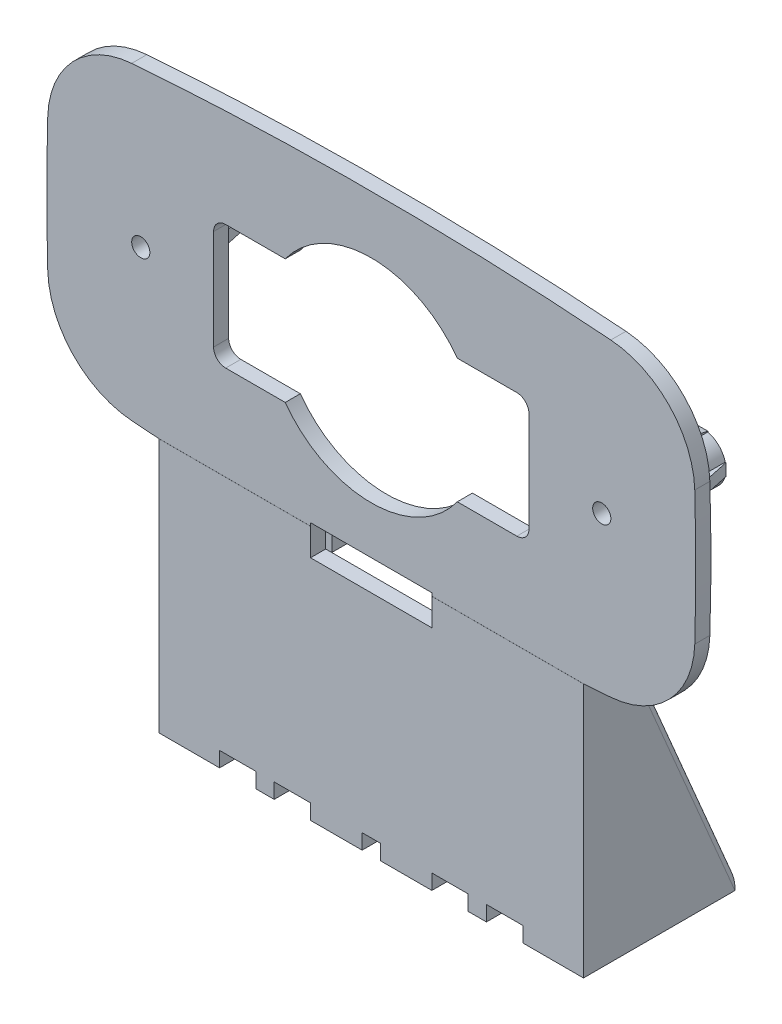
ISO-10303-21;
HEADER;
FILE_DESCRIPTION(('STEP AP214'),'2;1');
FILE_NAME('part.step','',(''),(''),'','','');
FILE_SCHEMA(('AUTOMOTIVE_DESIGN { 1 0 10303 214 1 1 1 1 }'));
ENDSEC;
DATA;
#1=APPLICATION_CONTEXT('core data for automotive mechanical design processes');
#2=APPLICATION_PROTOCOL_DEFINITION('international standard','automotive_design',2000,#1);
#3=PRODUCT_CONTEXT('',#1,'mechanical');
#4=PRODUCT('Part','Part','',(#3));
#5=PRODUCT_RELATED_PRODUCT_CATEGORY('part','',(#4));
#6=PRODUCT_DEFINITION_FORMATION('','',#4);
#7=PRODUCT_DEFINITION_CONTEXT('part definition',#1,'design');
#8=PRODUCT_DEFINITION('design','',#6,#7);
#9=PRODUCT_DEFINITION_SHAPE('','',#8);
#10=(LENGTH_UNIT() NAMED_UNIT(*) SI_UNIT(.MILLI.,.METRE.));
#11=(NAMED_UNIT(*) PLANE_ANGLE_UNIT() SI_UNIT($,.RADIAN.));
#12=(NAMED_UNIT(*) SI_UNIT($,.STERADIAN.) SOLID_ANGLE_UNIT());
#13=UNCERTAINTY_MEASURE_WITH_UNIT(LENGTH_MEASURE(1.E-05),#10,'distance_accuracy_value','');
#14=(GEOMETRIC_REPRESENTATION_CONTEXT(3) GLOBAL_UNCERTAINTY_ASSIGNED_CONTEXT((#13)) GLOBAL_UNIT_ASSIGNED_CONTEXT((#10,
#11,#12)) REPRESENTATION_CONTEXT('',''));
#15=CARTESIAN_POINT('',(0.,0.,0.));
#16=DIRECTION('',(0.,0.,1.));
#17=DIRECTION('',(1.,0.,0.));
#18=AXIS2_PLACEMENT_3D('',#15,#16,#17);
#19=CARTESIAN_POINT('',(0.,42.5,22.5));
#20=DIRECTION('',(0.,0.,1.));
#21=DIRECTION('',(1.,0.,0.));
#22=AXIS2_PLACEMENT_3D('',#19,#20,#21);
#23=PLANE('',#22);
#24=DIRECTION('',(-1.,0.,0.));
#25=VECTOR('',#24,1.);
#26=CARTESIAN_POINT('',(0.,37.5,22.5));
#27=LINE('',#26,#25);
#28=CARTESIAN_POINT('',(-9.00026609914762,37.5,22.5));
#29=VERTEX_POINT('',#28);
#30=CARTESIAN_POINT('',(-10.0002660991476,37.5,22.5));
#31=VERTEX_POINT('',#30);
#32=EDGE_CURVE('E155',#29,#31,#27,.T.);
#33=ORIENTED_EDGE('',*,*,#32,.F.);
#34=DIRECTION('',(0.,-1.,0.));
#35=VECTOR('',#34,1.);
#36=CARTESIAN_POINT('',(-9.00026609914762,42.5,22.5));
#37=LINE('',#36,#35);
#38=CARTESIAN_POINT('',(-9.00026609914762,42.5,22.5));
#39=VERTEX_POINT('',#38);
#40=EDGE_CURVE('E12',#39,#29,#37,.T.);
#41=ORIENTED_EDGE('',*,*,#40,.F.);
#42=DIRECTION('',(-1.,0.,0.));
#43=VECTOR('',#42,1.);
#44=CARTESIAN_POINT('',(0.,42.5,22.5));
#45=LINE('',#44,#43);
#46=CARTESIAN_POINT('',(-10.0002660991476,42.5,22.5));
#47=VERTEX_POINT('',#46);
#48=EDGE_CURVE('E173',#39,#47,#45,.T.);
#49=ORIENTED_EDGE('',*,*,#48,.T.);
#50=DIRECTION('',(0.,-1.,0.));
#51=VECTOR('',#50,1.);
#52=CARTESIAN_POINT('',(-10.0002660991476,42.5,22.5));
#53=LINE('',#52,#51);
#54=EDGE_CURVE('E77',#47,#31,#53,.T.);
#55=ORIENTED_EDGE('',*,*,#54,.T.);
#56=EDGE_LOOP('',(#33,#41,#49,#55));
#57=FACE_BOUND('',#56,.T.);
#58=ADVANCED_FACE('F60',(#57),#23,.T.);
#59=CARTESIAN_POINT('',(-9.00026609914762,42.5,0.));
#60=DIRECTION('',(-1.,0.,0.));
#61=DIRECTION('',(0.,0.,1.));
#62=AXIS2_PLACEMENT_3D('',#59,#60,#61);
#63=PLANE('',#62);
#64=DIRECTION('',(0.,0.,-1.));
#65=VECTOR('',#64,1.);
#66=CARTESIAN_POINT('',(-9.00026609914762,37.5,0.));
#67=LINE('',#66,#65);
#68=CARTESIAN_POINT('',(-9.00026609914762,37.5,18.5));
#69=VERTEX_POINT('',#68);
#70=EDGE_CURVE('E157',#29,#69,#67,.T.);
#71=ORIENTED_EDGE('',*,*,#70,.T.);
#72=DIRECTION('',(0.,-1.,0.));
#73=VECTOR('',#72,1.);
#74=CARTESIAN_POINT('',(-9.00026609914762,42.5,18.5));
#75=LINE('',#74,#73);
#76=CARTESIAN_POINT('',(-9.00026609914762,42.5,18.5));
#77=VERTEX_POINT('',#76);
#78=EDGE_CURVE('E69',#77,#69,#75,.T.);
#79=ORIENTED_EDGE('',*,*,#78,.F.);
#80=DIRECTION('',(0.,0.,-1.));
#81=VECTOR('',#80,1.);
#82=CARTESIAN_POINT('',(-9.00026609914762,42.5,0.));
#83=LINE('',#82,#81);
#84=EDGE_CURVE('E198',#39,#77,#83,.T.);
#85=ORIENTED_EDGE('',*,*,#84,.F.);
#86=ORIENTED_EDGE('',*,*,#40,.T.);
#87=EDGE_LOOP('',(#71,#79,#85,#86));
#88=FACE_BOUND('',#87,.T.);
#89=ADVANCED_FACE('F62',(#88),#63,.F.);
#90=CARTESIAN_POINT('',(0.,42.5,18.5));
#91=DIRECTION('',(0.,0.,1.));
#92=DIRECTION('',(1.,0.,0.));
#93=AXIS2_PLACEMENT_3D('',#90,#91,#92);
#94=PLANE('',#93);
#95=DIRECTION('',(-1.,0.,0.));
#96=VECTOR('',#95,1.);
#97=CARTESIAN_POINT('',(0.,37.5,18.5));
#98=LINE('',#97,#96);
#99=CARTESIAN_POINT('',(8.99973390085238,37.5,18.5));
#100=VERTEX_POINT('',#99);
#101=EDGE_CURVE('E161',#100,#69,#98,.T.);
#102=ORIENTED_EDGE('',*,*,#101,.F.);
#103=DIRECTION('',(0.,-1.,0.));
#104=VECTOR('',#103,1.);
#105=CARTESIAN_POINT('',(8.99973390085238,42.5,18.5));
#106=LINE('',#105,#104);
#107=CARTESIAN_POINT('',(8.99973390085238,42.5,18.5));
#108=VERTEX_POINT('',#107);
#109=EDGE_CURVE('E179',#108,#100,#106,.T.);
#110=ORIENTED_EDGE('',*,*,#109,.F.);
#111=DIRECTION('',(-1.,0.,0.));
#112=VECTOR('',#111,1.);
#113=CARTESIAN_POINT('',(0.,42.5,18.5));
#114=LINE('',#113,#112);
#115=EDGE_CURVE('E186',#108,#77,#114,.T.);
#116=ORIENTED_EDGE('',*,*,#115,.T.);
#117=ORIENTED_EDGE('',*,*,#78,.T.);
#118=EDGE_LOOP('',(#102,#110,#116,#117));
#119=FACE_BOUND('',#118,.T.);
#120=ADVANCED_FACE('F184',(#119),#94,.T.);
#121=CARTESIAN_POINT('',(8.99973390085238,42.5,0.));
#122=DIRECTION('',(-1.,0.,0.));
#123=DIRECTION('',(0.,0.,1.));
#124=AXIS2_PLACEMENT_3D('',#121,#122,#123);
#125=PLANE('',#124);
#126=DIRECTION('',(0.,0.,-1.));
#127=VECTOR('',#126,1.);
#128=CARTESIAN_POINT('',(8.99973390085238,37.5,0.));
#129=LINE('',#128,#127);
#130=CARTESIAN_POINT('',(8.99973390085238,37.5,22.5));
#131=VERTEX_POINT('',#130);
#132=EDGE_CURVE('E164',#131,#100,#129,.T.);
#133=ORIENTED_EDGE('',*,*,#132,.F.);
#134=DIRECTION('',(0.,-1.,0.));
#135=VECTOR('',#134,1.);
#136=CARTESIAN_POINT('',(8.99973390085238,42.5,22.5));
#137=LINE('',#136,#135);
#138=CARTESIAN_POINT('',(8.99973390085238,42.5,22.5));
#139=VERTEX_POINT('',#138);
#140=EDGE_CURVE('E177',#139,#131,#137,.T.);
#141=ORIENTED_EDGE('',*,*,#140,.F.);
#142=DIRECTION('',(0.,0.,-1.));
#143=VECTOR('',#142,1.);
#144=CARTESIAN_POINT('',(8.99973390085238,42.5,0.));
#145=LINE('',#144,#143);
#146=EDGE_CURVE('E197',#139,#108,#145,.T.);
#147=ORIENTED_EDGE('',*,*,#146,.T.);
#148=ORIENTED_EDGE('',*,*,#109,.T.);
#149=EDGE_LOOP('',(#133,#141,#147,#148));
#150=FACE_BOUND('',#149,.T.);
#151=ADVANCED_FACE('F195',(#150),#125,.T.);
#152=CARTESIAN_POINT('',(9.99973390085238,37.5,22.5));
#153=VERTEX_POINT('',#152);
#154=EDGE_CURVE('E158',#153,#131,#27,.T.);
#155=ORIENTED_EDGE('',*,*,#154,.F.);
#156=DIRECTION('',(0.,-1.,0.));
#157=VECTOR('',#156,1.);
#158=CARTESIAN_POINT('',(9.99973390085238,42.5,22.5));
#159=LINE('',#158,#157);
#160=CARTESIAN_POINT('',(9.99973390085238,42.5,22.5));
#161=VERTEX_POINT('',#160);
#162=EDGE_CURVE('E147',#161,#153,#159,.T.);
#163=ORIENTED_EDGE('',*,*,#162,.F.);
#164=EDGE_CURVE('E137',#161,#139,#45,.T.);
#165=ORIENTED_EDGE('',*,*,#164,.T.);
#166=ORIENTED_EDGE('',*,*,#140,.T.);
#167=EDGE_LOOP('',(#155,#163,#165,#166));
#168=FACE_BOUND('',#167,.T.);
#169=ADVANCED_FACE('F203',(#168),#23,.T.);
#170=CARTESIAN_POINT('',(9.99973390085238,42.5,0.));
#171=DIRECTION('',(-1.,0.,0.));
#172=DIRECTION('',(0.,0.,1.));
#173=AXIS2_PLACEMENT_3D('',#170,#171,#172);
#174=PLANE('',#173);
#175=DIRECTION('',(0.,0.,-1.));
#176=VECTOR('',#175,1.);
#177=CARTESIAN_POINT('',(9.99973390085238,37.5,0.));
#178=LINE('',#177,#176);
#179=CARTESIAN_POINT('',(9.99973390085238,37.5,17.5));
#180=VERTEX_POINT('',#179);
#181=EDGE_CURVE('E144',#153,#180,#178,.T.);
#182=ORIENTED_EDGE('',*,*,#181,.T.);
#183=DIRECTION('',(0.,-1.,0.));
#184=VECTOR('',#183,1.);
#185=CARTESIAN_POINT('',(9.99973390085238,42.5,17.5));
#186=LINE('',#185,#184);
#187=CARTESIAN_POINT('',(9.99973390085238,42.5,17.5));
#188=VERTEX_POINT('',#187);
#189=EDGE_CURVE('E141',#188,#180,#186,.T.);
#190=ORIENTED_EDGE('',*,*,#189,.F.);
#191=DIRECTION('',(0.,0.,-1.));
#192=VECTOR('',#191,1.);
#193=CARTESIAN_POINT('',(9.99973390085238,42.5,0.));
#194=LINE('',#193,#192);
#195=EDGE_CURVE('E128',#161,#188,#194,.T.);
#196=ORIENTED_EDGE('',*,*,#195,.F.);
#197=ORIENTED_EDGE('',*,*,#162,.T.);
#198=EDGE_LOOP('',(#182,#190,#196,#197));
#199=FACE_BOUND('',#198,.T.);
#200=ADVANCED_FACE('F142',(#199),#174,.F.);
#201=CARTESIAN_POINT('',(0.,42.5,17.5));
#202=DIRECTION('',(0.,0.,1.));
#203=DIRECTION('',(1.,0.,0.));
#204=AXIS2_PLACEMENT_3D('',#201,#202,#203);
#205=PLANE('',#204);
#206=DIRECTION('',(-1.,0.,0.));
#207=VECTOR('',#206,1.);
#208=CARTESIAN_POINT('',(0.,37.5,17.5));
#209=LINE('',#208,#207);
#210=CARTESIAN_POINT('',(-10.0002660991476,37.5,17.5));
#211=VERTEX_POINT('',#210);
#212=EDGE_CURVE('E168',#180,#211,#209,.T.);
#213=ORIENTED_EDGE('',*,*,#212,.T.);
#214=DIRECTION('',(0.,-1.,0.));
#215=VECTOR('',#214,1.);
#216=CARTESIAN_POINT('',(-10.0002660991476,42.5,17.5));
#217=LINE('',#216,#215);
#218=CARTESIAN_POINT('',(-10.0002660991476,42.5,17.5));
#219=VERTEX_POINT('',#218);
#220=EDGE_CURVE('E103',#219,#211,#217,.T.);
#221=ORIENTED_EDGE('',*,*,#220,.F.);
#222=DIRECTION('',(-1.,0.,0.));
#223=VECTOR('',#222,1.);
#224=CARTESIAN_POINT('',(0.,42.5,17.5));
#225=LINE('',#224,#223);
#226=EDGE_CURVE('E134',#188,#219,#225,.T.);
#227=ORIENTED_EDGE('',*,*,#226,.F.);
#228=ORIENTED_EDGE('',*,*,#189,.T.);
#229=EDGE_LOOP('',(#213,#221,#227,#228));
#230=FACE_BOUND('',#229,.T.);
#231=ADVANCED_FACE('F149',(#230),#205,.F.);
#232=CARTESIAN_POINT('',(-10.0002660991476,42.5,0.));
#233=DIRECTION('',(-1.,0.,0.));
#234=DIRECTION('',(0.,0.,1.));
#235=AXIS2_PLACEMENT_3D('',#232,#233,#234);
#236=PLANE('',#235);
#237=DIRECTION('',(0.,0.,-1.));
#238=VECTOR('',#237,1.);
#239=CARTESIAN_POINT('',(-10.0002660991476,37.5,0.));
#240=LINE('',#239,#238);
#241=EDGE_CURVE('E170',#31,#211,#240,.T.);
#242=ORIENTED_EDGE('',*,*,#241,.F.);
#243=ORIENTED_EDGE('',*,*,#54,.F.);
#244=DIRECTION('',(0.,0.,-1.));
#245=VECTOR('',#244,1.);
#246=CARTESIAN_POINT('',(-10.0002660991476,42.5,0.));
#247=LINE('',#246,#245);
#248=EDGE_CURVE('E150',#47,#219,#247,.T.);
#249=ORIENTED_EDGE('',*,*,#248,.T.);
#250=ORIENTED_EDGE('',*,*,#220,.T.);
#251=EDGE_LOOP('',(#242,#243,#249,#250));
#252=FACE_BOUND('',#251,.T.);
#253=ADVANCED_FACE('F204',(#252),#236,.T.);
#254=CARTESIAN_POINT('',(0.,42.5,0.));
#255=DIRECTION('',(0.,1.,0.));
#256=DIRECTION('',(0.,0.,1.));
#257=AXIS2_PLACEMENT_3D('',#254,#255,#256);
#258=PLANE('',#257);
#259=ORIENTED_EDGE('',*,*,#48,.F.);
#260=ORIENTED_EDGE('',*,*,#84,.T.);
#261=ORIENTED_EDGE('',*,*,#115,.F.);
#262=ORIENTED_EDGE('',*,*,#146,.F.);
#263=ORIENTED_EDGE('',*,*,#164,.F.);
#264=ORIENTED_EDGE('',*,*,#195,.T.);
#265=ORIENTED_EDGE('',*,*,#226,.T.);
#266=ORIENTED_EDGE('',*,*,#248,.F.);
#267=EDGE_LOOP('',(#259,#260,#261,#262,#263,#264,#265,#266));
#268=FACE_BOUND('',#267,.T.);
#269=ADVANCED_FACE('F131',(#268),#258,.T.);
#270=CARTESIAN_POINT('',(0.,37.5,0.));
#271=DIRECTION('',(0.,1.,0.));
#272=DIRECTION('',(0.,0.,1.));
#273=AXIS2_PLACEMENT_3D('',#270,#271,#272);
#274=PLANE('',#273);
#275=ORIENTED_EDGE('',*,*,#32,.T.);
#276=ORIENTED_EDGE('',*,*,#241,.T.);
#277=ORIENTED_EDGE('',*,*,#212,.F.);
#278=ORIENTED_EDGE('',*,*,#181,.F.);
#279=ORIENTED_EDGE('',*,*,#154,.T.);
#280=ORIENTED_EDGE('',*,*,#132,.T.);
#281=ORIENTED_EDGE('',*,*,#101,.T.);
#282=ORIENTED_EDGE('',*,*,#70,.F.);
#283=EDGE_LOOP('',(#275,#276,#277,#278,#279,#280,#281,#282));
#284=FACE_BOUND('',#283,.T.);
#285=ADVANCED_FACE('F190',(#284),#274,.F.);
#286=CLOSED_SHELL('',(#58,#89,#120,#151,#169,#200,#231,#253,#269,#285));
#287=MANIFOLD_SOLID_BREP('B2',#286);
#288=CARTESIAN_POINT('',(1.69609589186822E-12,67.8324631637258,22.5));
#289=DIRECTION('',(0.,0.,1.));
#290=DIRECTION('',(-1.,0.,0.));
#291=AXIS2_PLACEMENT_3D('',#288,#289,#290);
#292=ELLIPSE('',#291,120.721980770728,26.9917543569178);
#293=DIRECTION('',(0.,0.,1.));
#294=VECTOR('',#293,1.);
#295=SURFACE_OF_LINEAR_EXTRUSION('',#292,#294);
#296=DIRECTION('',(0.,0.,1.));
#297=VECTOR('',#296,1.);
#298=CARTESIAN_POINT('',(-35.0000000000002,42.0000000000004,22.5));
#299=LINE('',#298,#297);
#300=CARTESIAN_POINT('',(-35.0000000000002,42.0000000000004,22.5));
#301=VERTEX_POINT('',#300);
#302=CARTESIAN_POINT('',(-35.0000000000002,42.0000000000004,24.9899999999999));
#303=VERTEX_POINT('',#302);
#304=EDGE_CURVE('E1910',#301,#303,#299,.T.);
#305=ORIENTED_EDGE('',*,*,#304,.T.);
#306=CARTESIAN_POINT('',(1.69609589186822E-12,67.8324631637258,24.9899999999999));
#307=DIRECTION('',(0.,0.,1.));
#308=DIRECTION('',(-1.,0.,0.));
#309=AXIS2_PLACEMENT_3D('',#306,#307,#308);
#310=ELLIPSE('',#309,120.721980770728,26.9917543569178);
#311=CARTESIAN_POINT('',(-39.4999999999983,42.3264489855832,24.9899999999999));
#312=VERTEX_POINT('',#311);
#313=EDGE_CURVE('E1956',#312,#303,#310,.T.);
#314=ORIENTED_EDGE('',*,*,#313,.F.);
#315=DIRECTION('',(0.,0.,1.));
#316=VECTOR('',#315,1.);
#317=CARTESIAN_POINT('',(-39.4999999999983,42.326448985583,22.5));
#318=LINE('',#317,#316);
#319=CARTESIAN_POINT('',(-39.4999999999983,42.326448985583,22.5));
#320=VERTEX_POINT('',#319);
#321=EDGE_CURVE('E1913',#320,#312,#318,.T.);
#322=ORIENTED_EDGE('',*,*,#321,.F.);
#323=EDGE_CURVE('E972',#320,#301,#292,.T.);
#324=ORIENTED_EDGE('',*,*,#323,.T.);
#325=EDGE_LOOP('',(#305,#314,#322,#324));
#326=FACE_BOUND('',#325,.T.);
#327=ADVANCED_FACE('F305',(#326),#295,.T.);
#328=CARTESIAN_POINT('',(-38.3421890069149,57.2816980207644,22.5));
#329=DIRECTION('',(0.,0.,1.));
#330=DIRECTION('',(1.,0.,0.));
#331=AXIS2_PLACEMENT_3D('',#328,#329,#330);
#332=CYLINDRICAL_SURFACE('',#331,15.);
#333=ORIENTED_EDGE('',*,*,#321,.T.);
#334=CARTESIAN_POINT('',(-38.3421890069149,57.2816980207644,24.9899999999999));
#335=DIRECTION('',(0.,0.,1.));
#336=DIRECTION('',(1.,0.,0.));
#337=AXIS2_PLACEMENT_3D('',#334,#335,#336);
#338=CIRCLE('',#337,14.9999999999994);
#339=CARTESIAN_POINT('',(-53.3354604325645,56.8324631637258,24.9899999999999));
#340=VERTEX_POINT('',#339);
#341=EDGE_CURVE('E1951',#340,#312,#338,.T.);
#342=ORIENTED_EDGE('',*,*,#341,.F.);
#343=DIRECTION('',(0.,0.,1.));
#344=VECTOR('',#343,1.);
#345=CARTESIAN_POINT('',(-53.3354604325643,56.8324631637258,22.5));
#346=LINE('',#345,#344);
#347=CARTESIAN_POINT('',(-53.3354604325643,56.8324631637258,22.5));
#348=VERTEX_POINT('',#347);
#349=EDGE_CURVE('E1922',#348,#340,#346,.T.);
#350=ORIENTED_EDGE('',*,*,#349,.F.);
#351=CARTESIAN_POINT('',(-38.3421890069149,57.2816980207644,22.5));
#352=DIRECTION('',(0.,0.,1.));
#353=DIRECTION('',(1.,0.,0.));
#354=AXIS2_PLACEMENT_3D('',#351,#352,#353);
#355=CIRCLE('',#354,15.);
#356=EDGE_CURVE('E1899',#348,#320,#355,.T.);
#357=ORIENTED_EDGE('',*,*,#356,.T.);
#358=EDGE_LOOP('',(#333,#342,#350,#357));
#359=FACE_BOUND('',#358,.T.);
#360=ADVANCED_FACE('F1879',(#359),#332,.T.);
#361=CARTESIAN_POINT('',(1.69609589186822E-12,67.8324631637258,22.5));
#362=DIRECTION('',(0.,0.,1.));
#363=DIRECTION('',(0.,1.,0.));
#364=AXIS2_PLACEMENT_3D('',#361,#362,#363);
#365=ELLIPSE('',#364,140.363302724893,53.5);
#366=DIRECTION('',(0.,0.,1.));
#367=VECTOR('',#366,1.);
#368=SURFACE_OF_LINEAR_EXTRUSION('',#365,#367);
#369=ORIENTED_EDGE('',*,*,#349,.T.);
#370=CARTESIAN_POINT('',(1.69609589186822E-12,67.8324631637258,24.9899999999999));
#371=DIRECTION('',(0.,0.,1.));
#372=DIRECTION('',(0.,1.,0.));
#373=AXIS2_PLACEMENT_3D('',#370,#371,#372);
#374=ELLIPSE('',#373,140.363302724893,53.5);
#375=CARTESIAN_POINT('',(-53.3354604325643,78.8324631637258,24.9899999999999));
#376=VERTEX_POINT('',#375);
#377=EDGE_CURVE('E1946',#376,#340,#374,.T.);
#378=ORIENTED_EDGE('',*,*,#377,.F.);
#379=DIRECTION('',(0.,0.,1.));
#380=VECTOR('',#379,1.);
#381=CARTESIAN_POINT('',(-53.3354604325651,78.8324631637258,22.5));
#382=LINE('',#381,#380);
#383=CARTESIAN_POINT('',(-53.3354604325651,78.8324631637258,22.5));
#384=VERTEX_POINT('',#383);
#385=EDGE_CURVE('E2146',#384,#376,#382,.T.);
#386=ORIENTED_EDGE('',*,*,#385,.F.);
#387=EDGE_CURVE('E2178',#384,#348,#365,.T.);
#388=ORIENTED_EDGE('',*,*,#387,.T.);
#389=EDGE_LOOP('',(#369,#378,#386,#388));
#390=FACE_BOUND('',#389,.T.);
#391=ADVANCED_FACE('F1886',(#390),#368,.T.);
#392=CARTESIAN_POINT('',(-38.3421890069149,78.3832283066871,22.5));
#393=DIRECTION('',(0.,0.,1.));
#394=DIRECTION('',(1.,0.,0.));
#395=AXIS2_PLACEMENT_3D('',#392,#393,#394);
#396=CYLINDRICAL_SURFACE('',#395,15.);
#397=ORIENTED_EDGE('',*,*,#385,.T.);
#398=CARTESIAN_POINT('',(-38.3421890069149,78.3832283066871,24.9899999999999));
#399=DIRECTION('',(0.,0.,1.));
#400=DIRECTION('',(1.,0.,0.));
#401=AXIS2_PLACEMENT_3D('',#398,#399,#400);
#402=CIRCLE('',#401,15.0000000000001);
#403=CARTESIAN_POINT('',(-39.4999999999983,93.3384773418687,24.9899999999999));
#404=VERTEX_POINT('',#403);
#405=EDGE_CURVE('E1941',#404,#376,#402,.T.);
#406=ORIENTED_EDGE('',*,*,#405,.F.);
#407=DIRECTION('',(0.,0.,1.));
#408=VECTOR('',#407,1.);
#409=CARTESIAN_POINT('',(-39.4999999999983,93.3384773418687,22.5));
#410=LINE('',#409,#408);
#411=CARTESIAN_POINT('',(-39.4999999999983,93.3384773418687,22.5));
#412=VERTEX_POINT('',#411);
#413=EDGE_CURVE('E2149',#412,#404,#410,.T.);
#414=ORIENTED_EDGE('',*,*,#413,.F.);
#415=CARTESIAN_POINT('',(-38.3421890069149,78.3832283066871,22.5));
#416=DIRECTION('',(0.,0.,1.));
#417=DIRECTION('',(-1.,0.,0.));
#418=AXIS2_PLACEMENT_3D('',#415,#416,#417);
#419=CIRCLE('',#418,15.);
#420=EDGE_CURVE('E2174',#412,#384,#419,.T.);
#421=ORIENTED_EDGE('',*,*,#420,.T.);
#422=EDGE_LOOP('',(#397,#406,#414,#421));
#423=FACE_BOUND('',#422,.T.);
#424=ADVANCED_FACE('F2184',(#423),#396,.T.);
#425=CARTESIAN_POINT('',(1.69609589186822E-12,67.8324631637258,22.5));
#426=DIRECTION('',(0.,0.,1.));
#427=DIRECTION('',(-1.,0.,0.));
#428=AXIS2_PLACEMENT_3D('',#425,#426,#427);
#429=ELLIPSE('',#428,120.721980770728,26.9917543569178);
#430=DIRECTION('',(0.,0.,1.));
#431=VECTOR('',#430,1.);
#432=SURFACE_OF_LINEAR_EXTRUSION('',#429,#431);
#433=ORIENTED_EDGE('',*,*,#413,.T.);
#434=CARTESIAN_POINT('',(1.69609589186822E-12,67.8324631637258,24.9899999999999));
#435=DIRECTION('',(0.,0.,1.));
#436=DIRECTION('',(-1.,0.,0.));
#437=AXIS2_PLACEMENT_3D('',#434,#435,#436);
#438=ELLIPSE('',#437,120.721980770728,26.9917543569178);
#439=CARTESIAN_POINT('',(39.5000000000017,93.3384773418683,24.9899999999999));
#440=VERTEX_POINT('',#439);
#441=EDGE_CURVE('E1936',#440,#404,#438,.T.);
#442=ORIENTED_EDGE('',*,*,#441,.F.);
#443=DIRECTION('',(0.,0.,1.));
#444=VECTOR('',#443,1.);
#445=CARTESIAN_POINT('',(39.5000000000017,93.3384773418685,22.5));
#446=LINE('',#445,#444);
#447=CARTESIAN_POINT('',(39.5000000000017,93.3384773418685,22.5));
#448=VERTEX_POINT('',#447);
#449=EDGE_CURVE('E2152',#448,#440,#446,.T.);
#450=ORIENTED_EDGE('',*,*,#449,.F.);
#451=EDGE_CURVE('E2171',#448,#412,#429,.T.);
#452=ORIENTED_EDGE('',*,*,#451,.T.);
#453=EDGE_LOOP('',(#433,#442,#450,#452));
#454=FACE_BOUND('',#453,.T.);
#455=ADVANCED_FACE('F2181',(#454),#432,.T.);
#456=CARTESIAN_POINT('',(38.3421890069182,78.3832283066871,22.5));
#457=DIRECTION('',(0.,0.,1.));
#458=DIRECTION('',(1.,0.,0.));
#459=AXIS2_PLACEMENT_3D('',#456,#457,#458);
#460=CYLINDRICAL_SURFACE('',#459,15.);
#461=ORIENTED_EDGE('',*,*,#449,.T.);
#462=CARTESIAN_POINT('',(38.3421890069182,78.3832283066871,24.9899999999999));
#463=DIRECTION('',(0.,0.,1.));
#464=DIRECTION('',(1.,0.,0.));
#465=AXIS2_PLACEMENT_3D('',#462,#463,#464);
#466=CIRCLE('',#465,14.9999999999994);
#467=CARTESIAN_POINT('',(53.3354604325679,78.8324631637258,24.9899999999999));
#468=VERTEX_POINT('',#467);
#469=EDGE_CURVE('E1931',#468,#440,#466,.T.);
#470=ORIENTED_EDGE('',*,*,#469,.F.);
#471=DIRECTION('',(0.,0.,1.));
#472=VECTOR('',#471,1.);
#473=CARTESIAN_POINT('',(53.3354604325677,78.8324631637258,22.5));
#474=LINE('',#473,#472);
#475=CARTESIAN_POINT('',(53.3354604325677,78.8324631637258,22.5));
#476=VERTEX_POINT('',#475);
#477=EDGE_CURVE('E970',#476,#468,#474,.T.);
#478=ORIENTED_EDGE('',*,*,#477,.F.);
#479=CARTESIAN_POINT('',(38.3421890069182,78.3832283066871,22.5));
#480=DIRECTION('',(0.,0.,1.));
#481=DIRECTION('',(-1.,0.,0.));
#482=AXIS2_PLACEMENT_3D('',#479,#480,#481);
#483=CIRCLE('',#482,15.);
#484=EDGE_CURVE('E1778',#476,#448,#483,.T.);
#485=ORIENTED_EDGE('',*,*,#484,.T.);
#486=EDGE_LOOP('',(#461,#470,#478,#485));
#487=FACE_BOUND('',#486,.T.);
#488=ADVANCED_FACE('F1788',(#487),#460,.T.);
#489=CARTESIAN_POINT('',(1.69609589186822E-12,67.8324631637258,22.5));
#490=DIRECTION('',(0.,0.,1.));
#491=DIRECTION('',(0.,1.,0.));
#492=AXIS2_PLACEMENT_3D('',#489,#490,#491);
#493=ELLIPSE('',#492,140.363302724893,53.5);
#494=DIRECTION('',(0.,0.,1.));
#495=VECTOR('',#494,1.);
#496=SURFACE_OF_LINEAR_EXTRUSION('',#493,#495);
#497=ORIENTED_EDGE('',*,*,#477,.T.);
#498=CARTESIAN_POINT('',(1.69609589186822E-12,67.8324631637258,24.9899999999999));
#499=DIRECTION('',(0.,0.,1.));
#500=DIRECTION('',(0.,1.,0.));
#501=AXIS2_PLACEMENT_3D('',#498,#499,#500);
#502=ELLIPSE('',#501,140.363302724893,53.5);
#503=CARTESIAN_POINT('',(53.3354604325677,56.8324631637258,24.9899999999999));
#504=VERTEX_POINT('',#503);
#505=EDGE_CURVE('E959',#504,#468,#502,.T.);
#506=ORIENTED_EDGE('',*,*,#505,.F.);
#507=DIRECTION('',(0.,0.,1.));
#508=VECTOR('',#507,1.);
#509=CARTESIAN_POINT('',(53.3354604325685,56.8324631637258,22.5));
#510=LINE('',#509,#508);
#511=CARTESIAN_POINT('',(53.3354604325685,56.8324631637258,22.5));
#512=VERTEX_POINT('',#511);
#513=EDGE_CURVE('E957',#512,#504,#510,.T.);
#514=ORIENTED_EDGE('',*,*,#513,.F.);
#515=EDGE_CURVE('E1775',#512,#476,#493,.T.);
#516=ORIENTED_EDGE('',*,*,#515,.T.);
#517=EDGE_LOOP('',(#497,#506,#514,#516));
#518=FACE_BOUND('',#517,.T.);
#519=ADVANCED_FACE('F1784',(#518),#496,.T.);
#520=CARTESIAN_POINT('',(38.3421890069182,57.2816980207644,22.5));
#521=DIRECTION('',(0.,0.,1.));
#522=DIRECTION('',(1.,0.,0.));
#523=AXIS2_PLACEMENT_3D('',#520,#521,#522);
#524=CYLINDRICAL_SURFACE('',#523,15.);
#525=ORIENTED_EDGE('',*,*,#513,.T.);
#526=CARTESIAN_POINT('',(38.3421890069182,57.2816980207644,24.9899999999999));
#527=DIRECTION('',(0.,0.,1.));
#528=DIRECTION('',(1.,0.,0.));
#529=AXIS2_PLACEMENT_3D('',#526,#527,#528);
#530=CIRCLE('',#529,15.0000000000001);
#531=CARTESIAN_POINT('',(39.5000000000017,42.3264489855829,24.9899999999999));
#532=VERTEX_POINT('',#531);
#533=EDGE_CURVE('E939',#532,#504,#530,.T.);
#534=ORIENTED_EDGE('',*,*,#533,.F.);
#535=DIRECTION('',(0.,0.,1.));
#536=VECTOR('',#535,1.);
#537=CARTESIAN_POINT('',(39.5000000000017,42.3264489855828,22.5));
#538=LINE('',#537,#536);
#539=CARTESIAN_POINT('',(39.5000000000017,42.3264489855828,22.5));
#540=VERTEX_POINT('',#539);
#541=EDGE_CURVE('E955',#540,#532,#538,.T.);
#542=ORIENTED_EDGE('',*,*,#541,.F.);
#543=CARTESIAN_POINT('',(38.3421890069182,57.2816980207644,22.5));
#544=DIRECTION('',(0.,0.,1.));
#545=DIRECTION('',(-1.,0.,0.));
#546=AXIS2_PLACEMENT_3D('',#543,#544,#545);
#547=CIRCLE('',#546,15.);
#548=EDGE_CURVE('E1772',#540,#512,#547,.T.);
#549=ORIENTED_EDGE('',*,*,#548,.T.);
#550=EDGE_LOOP('',(#525,#534,#542,#549));
#551=FACE_BOUND('',#550,.T.);
#552=ADVANCED_FACE('F953',(#551),#524,.T.);
#553=CARTESIAN_POINT('',(1.69609589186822E-12,67.8324631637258,22.5));
#554=DIRECTION('',(0.,0.,1.));
#555=DIRECTION('',(-1.,0.,0.));
#556=AXIS2_PLACEMENT_3D('',#553,#554,#555);
#557=ELLIPSE('',#556,120.721980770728,26.9917543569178);
#558=DIRECTION('',(0.,0.,1.));
#559=VECTOR('',#558,1.);
#560=SURFACE_OF_LINEAR_EXTRUSION('',#557,#559);
#561=ORIENTED_EDGE('',*,*,#541,.T.);
#562=CARTESIAN_POINT('',(1.69609589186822E-12,67.8324631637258,24.9899999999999));
#563=DIRECTION('',(0.,0.,1.));
#564=DIRECTION('',(-1.,0.,0.));
#565=AXIS2_PLACEMENT_3D('',#562,#563,#564);
#566=ELLIPSE('',#565,120.721980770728,26.9917543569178);
#567=CARTESIAN_POINT('',(35.,42.,24.9899999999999));
#568=VERTEX_POINT('',#567);
#569=EDGE_CURVE('E935',#568,#532,#566,.T.);
#570=ORIENTED_EDGE('',*,*,#569,.F.);
#571=DIRECTION('',(0.,0.,1.));
#572=VECTOR('',#571,1.);
#573=CARTESIAN_POINT('',(35.,42.,22.5));
#574=LINE('',#573,#572);
#575=CARTESIAN_POINT('',(35.,42.,22.5));
#576=VERTEX_POINT('',#575);
#577=EDGE_CURVE('E966',#576,#568,#574,.T.);
#578=ORIENTED_EDGE('',*,*,#577,.F.);
#579=EDGE_CURVE('E964',#576,#540,#557,.T.);
#580=ORIENTED_EDGE('',*,*,#579,.T.);
#581=EDGE_LOOP('',(#561,#570,#578,#580));
#582=FACE_BOUND('',#581,.T.);
#583=ADVANCED_FACE('F962',(#582),#560,.T.);
#584=CARTESIAN_POINT('',(1.69609589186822E-12,67.8324631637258,22.5));
#585=DIRECTION('',(0.,0.,1.));
#586=DIRECTION('',(1.,0.,0.));
#587=AXIS2_PLACEMENT_3D('',#584,#585,#586);
#588=CYLINDRICAL_SURFACE('',#587,17.5);
#589=CARTESIAN_POINT('',(1.69609589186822E-12,67.8324631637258,24.9899999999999));
#590=DIRECTION('',(0.,0.,1.));
#591=DIRECTION('',(1.,0.,0.));
#592=AXIS2_PLACEMENT_3D('',#589,#590,#591);
#593=CIRCLE('',#592,17.5);
#594=CARTESIAN_POINT('',(14.1840579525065,57.5824631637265,24.9899999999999));
#595=VERTEX_POINT('',#594);
#596=CARTESIAN_POINT('',(-14.1840579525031,57.5824631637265,24.9899999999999));
#597=VERTEX_POINT('',#596);
#598=EDGE_CURVE('E2014',#595,#597,#593,.F.);
#599=ORIENTED_EDGE('',*,*,#598,.F.);
#600=DIRECTION('',(0.,0.,1.));
#601=VECTOR('',#600,1.);
#602=CARTESIAN_POINT('',(14.1840579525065,57.5824631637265,22.5));
#603=LINE('',#602,#601);
#604=CARTESIAN_POINT('',(14.1840579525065,57.5824631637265,22.5));
#605=VERTEX_POINT('',#604);
#606=EDGE_CURVE('E1119',#605,#595,#603,.T.);
#607=ORIENTED_EDGE('',*,*,#606,.F.);
#608=CARTESIAN_POINT('',(1.69609589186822E-12,67.8324631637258,22.5));
#609=DIRECTION('',(0.,0.,1.));
#610=DIRECTION('',(1.,0.,0.));
#611=AXIS2_PLACEMENT_3D('',#608,#609,#610);
#612=CIRCLE('',#611,17.5);
#613=CARTESIAN_POINT('',(-14.1840579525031,57.5824631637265,22.5));
#614=VERTEX_POINT('',#613);
#615=EDGE_CURVE('E1071',#614,#605,#612,.T.);
#616=ORIENTED_EDGE('',*,*,#615,.F.);
#617=DIRECTION('',(0.,0.,1.));
#618=VECTOR('',#617,1.);
#619=CARTESIAN_POINT('',(-14.1840579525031,57.5824631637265,22.5));
#620=LINE('',#619,#618);
#621=EDGE_CURVE('E1120',#614,#597,#620,.T.);
#622=ORIENTED_EDGE('',*,*,#621,.T.);
#623=EDGE_LOOP('',(#599,#607,#616,#622));
#624=FACE_BOUND('',#623,.T.);
#625=ADVANCED_FACE('F1795',(#624),#588,.F.);
#626=CARTESIAN_POINT('',(-23.9999999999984,57.5824631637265,22.5));
#627=DIRECTION('',(0.,-1.,0.));
#628=DIRECTION('',(0.,0.,-1.));
#629=AXIS2_PLACEMENT_3D('',#626,#627,#628);
#630=PLANE('',#629);
#631=DIRECTION('',(-1.,0.,0.));
#632=VECTOR('',#631,1.);
#633=CARTESIAN_POINT('',(-23.9999999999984,57.5824631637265,24.9899999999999));
#634=LINE('',#633,#632);
#635=CARTESIAN_POINT('',(-23.9999999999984,57.5824631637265,24.9899999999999));
#636=VERTEX_POINT('',#635);
#637=EDGE_CURVE('E2011',#597,#636,#634,.T.);
#638=ORIENTED_EDGE('',*,*,#637,.F.);
#639=ORIENTED_EDGE('',*,*,#621,.F.);
#640=DIRECTION('',(1.,0.,0.));
#641=VECTOR('',#640,1.);
#642=CARTESIAN_POINT('',(-23.9999999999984,57.5824631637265,22.5));
#643=LINE('',#642,#641);
#644=CARTESIAN_POINT('',(-23.9999999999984,57.5824631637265,22.5));
#645=VERTEX_POINT('',#644);
#646=EDGE_CURVE('E1115',#645,#614,#643,.T.);
#647=ORIENTED_EDGE('',*,*,#646,.F.);
#648=DIRECTION('',(0.,0.,1.));
#649=VECTOR('',#648,1.);
#650=CARTESIAN_POINT('',(-23.9999999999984,57.5824631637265,22.5));
#651=LINE('',#650,#649);
#652=EDGE_CURVE('E1125',#645,#636,#651,.T.);
#653=ORIENTED_EDGE('',*,*,#652,.T.);
#654=EDGE_LOOP('',(#638,#639,#647,#653));
#655=FACE_BOUND('',#654,.T.);
#656=ADVANCED_FACE('F2980',(#655),#630,.F.);
#657=CARTESIAN_POINT('',(-23.9999999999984,59.5824631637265,22.5));
#658=DIRECTION('',(0.,0.,1.));
#659=DIRECTION('',(1.,0.,0.));
#660=AXIS2_PLACEMENT_3D('',#657,#658,#659);
#661=CYLINDRICAL_SURFACE('',#660,2.);
#662=CARTESIAN_POINT('',(-23.9999999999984,59.5824631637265,24.9899999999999));
#663=DIRECTION('',(0.,0.,1.));
#664=DIRECTION('',(1.,0.,0.));
#665=AXIS2_PLACEMENT_3D('',#662,#663,#664);
#666=CIRCLE('',#665,2.);
#667=CARTESIAN_POINT('',(-25.9999999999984,59.5824631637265,24.9899999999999));
#668=VERTEX_POINT('',#667);
#669=EDGE_CURVE('E2008',#636,#668,#666,.F.);
#670=ORIENTED_EDGE('',*,*,#669,.F.);
#671=ORIENTED_EDGE('',*,*,#652,.F.);
#672=CARTESIAN_POINT('',(-23.9999999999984,59.5824631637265,22.5));
#673=DIRECTION('',(0.,0.,1.));
#674=DIRECTION('',(-1.,0.,0.));
#675=AXIS2_PLACEMENT_3D('',#672,#673,#674);
#676=CIRCLE('',#675,2.);
#677=CARTESIAN_POINT('',(-25.9999999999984,59.5824631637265,22.5));
#678=VERTEX_POINT('',#677);
#679=EDGE_CURVE('E1111',#678,#645,#676,.T.);
#680=ORIENTED_EDGE('',*,*,#679,.F.);
#681=DIRECTION('',(0.,0.,1.));
#682=VECTOR('',#681,1.);
#683=CARTESIAN_POINT('',(-25.9999999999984,59.5824631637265,22.5));
#684=LINE('',#683,#682);
#685=EDGE_CURVE('E1129',#678,#668,#684,.T.);
#686=ORIENTED_EDGE('',*,*,#685,.T.);
#687=EDGE_LOOP('',(#670,#671,#680,#686));
#688=FACE_BOUND('',#687,.T.);
#689=ADVANCED_FACE('F2970',(#688),#661,.F.);
#690=CARTESIAN_POINT('',(-25.9999999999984,59.5824631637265,22.5));
#691=DIRECTION('',(-1.,0.,0.));
#692=DIRECTION('',(0.,0.,1.));
#693=AXIS2_PLACEMENT_3D('',#690,#691,#692);
#694=PLANE('',#693);
#695=DIRECTION('',(0.,1.,0.));
#696=VECTOR('',#695,1.);
#697=CARTESIAN_POINT('',(-25.9999999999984,59.5824631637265,24.9899999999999));
#698=LINE('',#697,#696);
#699=CARTESIAN_POINT('',(-25.9999999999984,76.0824631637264,24.9899999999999));
#700=VERTEX_POINT('',#699);
#701=EDGE_CURVE('E2005',#668,#700,#698,.T.);
#702=ORIENTED_EDGE('',*,*,#701,.F.);
#703=ORIENTED_EDGE('',*,*,#685,.F.);
#704=DIRECTION('',(0.,-1.,0.));
#705=VECTOR('',#704,1.);
#706=CARTESIAN_POINT('',(-25.9999999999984,59.5824631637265,22.5));
#707=LINE('',#706,#705);
#708=CARTESIAN_POINT('',(-25.9999999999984,76.0824631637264,22.5));
#709=VERTEX_POINT('',#708);
#710=EDGE_CURVE('E1107',#709,#678,#707,.T.);
#711=ORIENTED_EDGE('',*,*,#710,.F.);
#712=DIRECTION('',(0.,0.,1.));
#713=VECTOR('',#712,1.);
#714=CARTESIAN_POINT('',(-25.9999999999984,76.0824631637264,22.5));
#715=LINE('',#714,#713);
#716=EDGE_CURVE('E1133',#709,#700,#715,.T.);
#717=ORIENTED_EDGE('',*,*,#716,.T.);
#718=EDGE_LOOP('',(#702,#703,#711,#717));
#719=FACE_BOUND('',#718,.T.);
#720=ADVANCED_FACE('F2960',(#719),#694,.F.);
#721=CARTESIAN_POINT('',(-23.9999999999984,76.0824631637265,22.5));
#722=DIRECTION('',(0.,0.,1.));
#723=DIRECTION('',(1.,0.,0.));
#724=AXIS2_PLACEMENT_3D('',#721,#722,#723);
#725=CYLINDRICAL_SURFACE('',#724,2.);
#726=CARTESIAN_POINT('',(-23.9999999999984,76.0824631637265,24.9899999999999));
#727=DIRECTION('',(0.,0.,1.));
#728=DIRECTION('',(1.,0.,0.));
#729=AXIS2_PLACEMENT_3D('',#726,#727,#728);
#730=CIRCLE('',#729,2.);
#731=CARTESIAN_POINT('',(-23.9999999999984,78.0824631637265,24.9899999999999));
#732=VERTEX_POINT('',#731);
#733=EDGE_CURVE('E2002',#700,#732,#730,.F.);
#734=ORIENTED_EDGE('',*,*,#733,.F.);
#735=ORIENTED_EDGE('',*,*,#716,.F.);
#736=CARTESIAN_POINT('',(-23.9999999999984,76.0824631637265,22.5));
#737=DIRECTION('',(0.,0.,1.));
#738=DIRECTION('',(-1.,0.,0.));
#739=AXIS2_PLACEMENT_3D('',#736,#737,#738);
#740=CIRCLE('',#739,2.);
#741=CARTESIAN_POINT('',(-23.9999999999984,78.0824631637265,22.5));
#742=VERTEX_POINT('',#741);
#743=EDGE_CURVE('E1103',#742,#709,#740,.T.);
#744=ORIENTED_EDGE('',*,*,#743,.F.);
#745=DIRECTION('',(0.,0.,1.));
#746=VECTOR('',#745,1.);
#747=CARTESIAN_POINT('',(-23.9999999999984,78.0824631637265,22.5));
#748=LINE('',#747,#746);
#749=EDGE_CURVE('E1137',#742,#732,#748,.T.);
#750=ORIENTED_EDGE('',*,*,#749,.T.);
#751=EDGE_LOOP('',(#734,#735,#744,#750));
#752=FACE_BOUND('',#751,.T.);
#753=ADVANCED_FACE('F2950',(#752),#725,.F.);
#754=CARTESIAN_POINT('',(-23.9999999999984,78.0824631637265,22.5));
#755=DIRECTION('',(0.,1.,0.));
#756=DIRECTION('',(0.,0.,1.));
#757=AXIS2_PLACEMENT_3D('',#754,#755,#756);
#758=PLANE('',#757);
#759=DIRECTION('',(1.,0.,0.));
#760=VECTOR('',#759,1.);
#761=CARTESIAN_POINT('',(-23.9999999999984,78.0824631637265,24.9899999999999));
#762=LINE('',#761,#760);
#763=CARTESIAN_POINT('',(-14.1840579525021,78.0824631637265,24.9899999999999));
#764=VERTEX_POINT('',#763);
#765=EDGE_CURVE('E1999',#732,#764,#762,.T.);
#766=ORIENTED_EDGE('',*,*,#765,.F.);
#767=ORIENTED_EDGE('',*,*,#749,.F.);
#768=DIRECTION('',(-1.,0.,0.));
#769=VECTOR('',#768,1.);
#770=CARTESIAN_POINT('',(-23.9999999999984,78.0824631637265,22.5));
#771=LINE('',#770,#769);
#772=CARTESIAN_POINT('',(-14.1840579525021,78.0824631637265,22.5));
#773=VERTEX_POINT('',#772);
#774=EDGE_CURVE('E1099',#773,#742,#771,.T.);
#775=ORIENTED_EDGE('',*,*,#774,.F.);
#776=DIRECTION('',(0.,0.,1.));
#777=VECTOR('',#776,1.);
#778=CARTESIAN_POINT('',(-14.1840579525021,78.0824631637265,22.5));
#779=LINE('',#778,#777);
#780=EDGE_CURVE('E1141',#773,#764,#779,.T.);
#781=ORIENTED_EDGE('',*,*,#780,.T.);
#782=EDGE_LOOP('',(#766,#767,#775,#781));
#783=FACE_BOUND('',#782,.T.);
#784=ADVANCED_FACE('F2940',(#783),#758,.F.);
#785=CARTESIAN_POINT('',(1.69609589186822E-12,67.8324631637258,22.5));
#786=DIRECTION('',(0.,0.,1.));
#787=DIRECTION('',(1.,0.,0.));
#788=AXIS2_PLACEMENT_3D('',#785,#786,#787);
#789=CYLINDRICAL_SURFACE('',#788,17.5);
#790=CARTESIAN_POINT('',(1.69609589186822E-12,67.8324631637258,24.9899999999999));
#791=DIRECTION('',(0.,0.,1.));
#792=DIRECTION('',(1.,0.,0.));
#793=AXIS2_PLACEMENT_3D('',#790,#791,#792);
#794=CIRCLE('',#793,17.5);
#795=CARTESIAN_POINT('',(14.1840579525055,78.0824631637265,24.9899999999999));
#796=VERTEX_POINT('',#795);
#797=EDGE_CURVE('E1996',#764,#796,#794,.F.);
#798=ORIENTED_EDGE('',*,*,#797,.F.);
#799=ORIENTED_EDGE('',*,*,#780,.F.);
#800=CARTESIAN_POINT('',(1.69609589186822E-12,67.8324631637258,22.5));
#801=DIRECTION('',(0.,0.,1.));
#802=DIRECTION('',(1.,0.,0.));
#803=AXIS2_PLACEMENT_3D('',#800,#801,#802);
#804=CIRCLE('',#803,17.5);
#805=CARTESIAN_POINT('',(14.1840579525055,78.0824631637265,22.5));
#806=VERTEX_POINT('',#805);
#807=EDGE_CURVE('E1095',#806,#773,#804,.T.);
#808=ORIENTED_EDGE('',*,*,#807,.F.);
#809=DIRECTION('',(0.,0.,1.));
#810=VECTOR('',#809,1.);
#811=CARTESIAN_POINT('',(14.1840579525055,78.0824631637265,22.5));
#812=LINE('',#811,#810);
#813=EDGE_CURVE('E1145',#806,#796,#812,.T.);
#814=ORIENTED_EDGE('',*,*,#813,.T.);
#815=EDGE_LOOP('',(#798,#799,#808,#814));
#816=FACE_BOUND('',#815,.T.);
#817=ADVANCED_FACE('F2930',(#816),#789,.F.);
#818=CARTESIAN_POINT('',(14.1840579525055,78.0824631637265,22.5));
#819=DIRECTION('',(0.,1.,0.));
#820=DIRECTION('',(0.,0.,1.));
#821=AXIS2_PLACEMENT_3D('',#818,#819,#820);
#822=PLANE('',#821);
#823=DIRECTION('',(1.,0.,0.));
#824=VECTOR('',#823,1.);
#825=CARTESIAN_POINT('',(14.1840579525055,78.0824631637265,24.9899999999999));
#826=LINE('',#825,#824);
#827=CARTESIAN_POINT('',(24.0000000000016,78.0824631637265,24.9899999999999));
#828=VERTEX_POINT('',#827);
#829=EDGE_CURVE('E1993',#796,#828,#826,.T.);
#830=ORIENTED_EDGE('',*,*,#829,.F.);
#831=ORIENTED_EDGE('',*,*,#813,.F.);
#832=DIRECTION('',(-1.,0.,0.));
#833=VECTOR('',#832,1.);
#834=CARTESIAN_POINT('',(14.1840579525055,78.0824631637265,22.5));
#835=LINE('',#834,#833);
#836=CARTESIAN_POINT('',(24.0000000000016,78.0824631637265,22.5));
#837=VERTEX_POINT('',#836);
#838=EDGE_CURVE('E1091',#837,#806,#835,.T.);
#839=ORIENTED_EDGE('',*,*,#838,.F.);
#840=DIRECTION('',(0.,0.,1.));
#841=VECTOR('',#840,1.);
#842=CARTESIAN_POINT('',(24.0000000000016,78.0824631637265,22.5));
#843=LINE('',#842,#841);
#844=EDGE_CURVE('E1149',#837,#828,#843,.T.);
#845=ORIENTED_EDGE('',*,*,#844,.T.);
#846=EDGE_LOOP('',(#830,#831,#839,#845));
#847=FACE_BOUND('',#846,.T.);
#848=ADVANCED_FACE('F2920',(#847),#822,.F.);
#849=CARTESIAN_POINT('',(24.0000000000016,76.0824631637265,22.5));
#850=DIRECTION('',(0.,0.,1.));
#851=DIRECTION('',(1.,0.,0.));
#852=AXIS2_PLACEMENT_3D('',#849,#850,#851);
#853=CYLINDRICAL_SURFACE('',#852,2.);
#854=CARTESIAN_POINT('',(24.0000000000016,76.0824631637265,24.9899999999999));
#855=DIRECTION('',(0.,0.,1.));
#856=DIRECTION('',(1.,0.,0.));
#857=AXIS2_PLACEMENT_3D('',#854,#855,#856);
#858=CIRCLE('',#857,2.);
#859=CARTESIAN_POINT('',(26.0000000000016,76.0824631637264,24.9899999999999));
#860=VERTEX_POINT('',#859);
#861=EDGE_CURVE('E1990',#828,#860,#858,.F.);
#862=ORIENTED_EDGE('',*,*,#861,.F.);
#863=ORIENTED_EDGE('',*,*,#844,.F.);
#864=CARTESIAN_POINT('',(24.0000000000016,76.0824631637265,22.5));
#865=DIRECTION('',(0.,0.,1.));
#866=DIRECTION('',(-1.,0.,0.));
#867=AXIS2_PLACEMENT_3D('',#864,#865,#866);
#868=CIRCLE('',#867,2.);
#869=CARTESIAN_POINT('',(26.0000000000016,76.0824631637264,22.5));
#870=VERTEX_POINT('',#869);
#871=EDGE_CURVE('E1087',#870,#837,#868,.T.);
#872=ORIENTED_EDGE('',*,*,#871,.F.);
#873=DIRECTION('',(0.,0.,1.));
#874=VECTOR('',#873,1.);
#875=CARTESIAN_POINT('',(26.0000000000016,76.0824631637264,22.5));
#876=LINE('',#875,#874);
#877=EDGE_CURVE('E1153',#870,#860,#876,.T.);
#878=ORIENTED_EDGE('',*,*,#877,.T.);
#879=EDGE_LOOP('',(#862,#863,#872,#878));
#880=FACE_BOUND('',#879,.T.);
#881=ADVANCED_FACE('F2910',(#880),#853,.F.);
#882=CARTESIAN_POINT('',(26.0000000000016,59.5824631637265,22.5));
#883=DIRECTION('',(1.,0.,0.));
#884=DIRECTION('',(0.,0.,-1.));
#885=AXIS2_PLACEMENT_3D('',#882,#883,#884);
#886=PLANE('',#885);
#887=DIRECTION('',(0.,-1.,0.));
#888=VECTOR('',#887,1.);
#889=CARTESIAN_POINT('',(26.0000000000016,59.5824631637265,24.9899999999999));
#890=LINE('',#889,#888);
#891=CARTESIAN_POINT('',(26.0000000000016,59.5824631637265,24.9899999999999));
#892=VERTEX_POINT('',#891);
#893=EDGE_CURVE('E1987',#860,#892,#890,.T.);
#894=ORIENTED_EDGE('',*,*,#893,.F.);
#895=ORIENTED_EDGE('',*,*,#877,.F.);
#896=DIRECTION('',(0.,1.,0.));
#897=VECTOR('',#896,1.);
#898=CARTESIAN_POINT('',(26.0000000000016,59.5824631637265,22.5));
#899=LINE('',#898,#897);
#900=CARTESIAN_POINT('',(26.0000000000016,59.5824631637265,22.5));
#901=VERTEX_POINT('',#900);
#902=EDGE_CURVE('E1083',#901,#870,#899,.T.);
#903=ORIENTED_EDGE('',*,*,#902,.F.);
#904=DIRECTION('',(0.,0.,1.));
#905=VECTOR('',#904,1.);
#906=CARTESIAN_POINT('',(26.0000000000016,59.5824631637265,22.5));
#907=LINE('',#906,#905);
#908=EDGE_CURVE('E1157',#901,#892,#907,.T.);
#909=ORIENTED_EDGE('',*,*,#908,.T.);
#910=EDGE_LOOP('',(#894,#895,#903,#909));
#911=FACE_BOUND('',#910,.T.);
#912=ADVANCED_FACE('F2900',(#911),#886,.F.);
#913=CARTESIAN_POINT('',(24.0000000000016,59.5824631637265,22.5));
#914=DIRECTION('',(0.,0.,1.));
#915=DIRECTION('',(1.,0.,0.));
#916=AXIS2_PLACEMENT_3D('',#913,#914,#915);
#917=CYLINDRICAL_SURFACE('',#916,2.);
#918=CARTESIAN_POINT('',(24.0000000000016,59.5824631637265,24.9899999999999));
#919=DIRECTION('',(0.,0.,1.));
#920=DIRECTION('',(1.,0.,0.));
#921=AXIS2_PLACEMENT_3D('',#918,#919,#920);
#922=CIRCLE('',#921,2.);
#923=CARTESIAN_POINT('',(24.0000000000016,57.5824631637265,24.9899999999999));
#924=VERTEX_POINT('',#923);
#925=EDGE_CURVE('E323',#892,#924,#922,.F.);
#926=ORIENTED_EDGE('',*,*,#925,.F.);
#927=ORIENTED_EDGE('',*,*,#908,.F.);
#928=CARTESIAN_POINT('',(24.0000000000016,59.5824631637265,22.5));
#929=DIRECTION('',(0.,0.,1.));
#930=DIRECTION('',(1.,0.,0.));
#931=AXIS2_PLACEMENT_3D('',#928,#929,#930);
#932=CIRCLE('',#931,2.);
#933=CARTESIAN_POINT('',(24.0000000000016,57.5824631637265,22.5));
#934=VERTEX_POINT('',#933);
#935=EDGE_CURVE('E1079',#934,#901,#932,.T.);
#936=ORIENTED_EDGE('',*,*,#935,.F.);
#937=DIRECTION('',(0.,0.,1.));
#938=VECTOR('',#937,1.);
#939=CARTESIAN_POINT('',(24.0000000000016,57.5824631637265,22.5));
#940=LINE('',#939,#938);
#941=EDGE_CURVE('E1161',#934,#924,#940,.T.);
#942=ORIENTED_EDGE('',*,*,#941,.T.);
#943=EDGE_LOOP('',(#926,#927,#936,#942));
#944=FACE_BOUND('',#943,.T.);
#945=ADVANCED_FACE('F2890',(#944),#917,.F.);
#946=CARTESIAN_POINT('',(14.1840579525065,57.5824631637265,22.5));
#947=DIRECTION('',(0.,-1.,0.));
#948=DIRECTION('',(0.,0.,-1.));
#949=AXIS2_PLACEMENT_3D('',#946,#947,#948);
#950=PLANE('',#949);
#951=DIRECTION('',(-1.,0.,0.));
#952=VECTOR('',#951,1.);
#953=CARTESIAN_POINT('',(14.1840579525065,57.5824631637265,24.9899999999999));
#954=LINE('',#953,#952);
#955=EDGE_CURVE('E1982',#924,#595,#954,.T.);
#956=ORIENTED_EDGE('',*,*,#955,.F.);
#957=ORIENTED_EDGE('',*,*,#941,.F.);
#958=DIRECTION('',(1.,0.,0.));
#959=VECTOR('',#958,1.);
#960=CARTESIAN_POINT('',(14.1840579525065,57.5824631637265,22.5));
#961=LINE('',#960,#959);
#962=EDGE_CURVE('E1075',#605,#934,#961,.T.);
#963=ORIENTED_EDGE('',*,*,#962,.F.);
#964=ORIENTED_EDGE('',*,*,#606,.T.);
#965=EDGE_LOOP('',(#956,#957,#963,#964));
#966=FACE_BOUND('',#965,.T.);
#967=ADVANCED_FACE('F2862',(#966),#950,.F.);
#968=CARTESIAN_POINT('',(-10.0002660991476,42.5,25.));
#969=DIRECTION('',(0.,1.,0.));
#970=DIRECTION('',(0.,0.,1.));
#971=AXIS2_PLACEMENT_3D('',#968,#969,#970);
#972=PLANE('',#971);
#973=DIRECTION('',(1.,0.,0.));
#974=VECTOR('',#973,1.);
#975=CARTESIAN_POINT('',(-10.0002660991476,42.5,24.9899999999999));
#976=LINE('',#975,#974);
#977=CARTESIAN_POINT('',(-10.0002660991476,42.5,24.9899999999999));
#978=VERTEX_POINT('',#977);
#979=CARTESIAN_POINT('',(9.99973390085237,42.5,24.9899999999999));
#980=VERTEX_POINT('',#979);
#981=EDGE_CURVE('E1391',#978,#980,#976,.T.);
#982=ORIENTED_EDGE('',*,*,#981,.F.);
#983=DIRECTION('',(0.,0.,-1.));
#984=VECTOR('',#983,1.);
#985=CARTESIAN_POINT('',(-10.0002660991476,42.5,25.));
#986=LINE('',#985,#984);
#987=CARTESIAN_POINT('',(-10.0002660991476,42.5,22.5));
#988=VERTEX_POINT('',#987);
#989=EDGE_CURVE('E1399',#978,#988,#986,.T.);
#990=ORIENTED_EDGE('',*,*,#989,.T.);
#991=DIRECTION('',(1.,0.,0.));
#992=VECTOR('',#991,1.);
#993=CARTESIAN_POINT('',(-10.0002660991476,42.5,22.5));
#994=LINE('',#993,#992);
#995=CARTESIAN_POINT('',(9.99973390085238,42.5,22.5));
#996=VERTEX_POINT('',#995);
#997=EDGE_CURVE('E2061',#988,#996,#994,.T.);
#998=ORIENTED_EDGE('',*,*,#997,.T.);
#999=DIRECTION('',(0.,0.,-1.));
#1000=VECTOR('',#999,1.);
#1001=CARTESIAN_POINT('',(9.99973390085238,42.5,25.));
#1002=LINE('',#1001,#1000);
#1003=EDGE_CURVE('E1401',#980,#996,#1002,.T.);
#1004=ORIENTED_EDGE('',*,*,#1003,.F.);
#1005=EDGE_LOOP('',(#982,#990,#998,#1004));
#1006=FACE_BOUND('',#1005,.T.);
#1007=ADVANCED_FACE('F1397',(#1006),#972,.F.);
#1008=CARTESIAN_POINT('',(22.,2.5,8.));
#1009=DIRECTION('',(0.,-1.,0.));
#1010=DIRECTION('',(0.,0.,-1.));
#1011=AXIS2_PLACEMENT_3D('',#1008,#1009,#1010);
#1012=CYLINDRICAL_SURFACE('',#1011,3.);
#1013=DIRECTION('',(0.,-1.,0.));
#1014=VECTOR('',#1013,1.);
#1015=CARTESIAN_POINT('',(25.,2.5,8.));
#1016=LINE('',#1015,#1014);
#1017=CARTESIAN_POINT('',(25.,2.49,8.));
#1018=VERTEX_POINT('',#1017);
#1019=CARTESIAN_POINT('',(25.,0.,8.));
#1020=VERTEX_POINT('',#1019);
#1021=EDGE_CURVE('E1298',#1018,#1020,#1016,.T.);
#1022=ORIENTED_EDGE('',*,*,#1021,.F.);
#1023=CARTESIAN_POINT('',(22.,2.49,8.));
#1024=DIRECTION('',(0.,1.,0.));
#1025=DIRECTION('',(0.,0.,1.));
#1026=AXIS2_PLACEMENT_3D('',#1023,#1024,#1025);
#1027=CIRCLE('',#1026,3.);
#1028=CARTESIAN_POINT('',(19.,2.49,8.));
#1029=VERTEX_POINT('',#1028);
#1030=EDGE_CURVE('E2043',#1018,#1029,#1027,.T.);
#1031=ORIENTED_EDGE('',*,*,#1030,.T.);
#1032=DIRECTION('',(0.,-1.,0.));
#1033=VECTOR('',#1032,1.);
#1034=CARTESIAN_POINT('',(19.,2.5,8.));
#1035=LINE('',#1034,#1033);
#1036=CARTESIAN_POINT('',(19.,0.,8.));
#1037=VERTEX_POINT('',#1036);
#1038=EDGE_CURVE('E1227',#1029,#1037,#1035,.T.);
#1039=ORIENTED_EDGE('',*,*,#1038,.T.);
#1040=CARTESIAN_POINT('',(22.,0.,8.));
#1041=DIRECTION('',(0.,1.,0.));
#1042=DIRECTION('',(0.,0.,1.));
#1043=AXIS2_PLACEMENT_3D('',#1040,#1041,#1042);
#1044=CIRCLE('',#1043,3.);
#1045=EDGE_CURVE('E1228',#1020,#1037,#1044,.T.);
#1046=ORIENTED_EDGE('',*,*,#1045,.F.);
#1047=EDGE_LOOP('',(#1022,#1031,#1039,#1046));
#1048=FACE_BOUND('',#1047,.T.);
#1049=ADVANCED_FACE('F1850',(#1048),#1012,.F.);
#1050=CARTESIAN_POINT('',(-22.,2.5,8.));
#1051=DIRECTION('',(0.,-1.,0.));
#1052=DIRECTION('',(0.,0.,-1.));
#1053=AXIS2_PLACEMENT_3D('',#1050,#1051,#1052);
#1054=CYLINDRICAL_SURFACE('',#1053,3.);
#1055=CARTESIAN_POINT('',(-22.,2.49,8.));
#1056=DIRECTION('',(0.,1.,0.));
#1057=DIRECTION('',(0.,0.,1.));
#1058=AXIS2_PLACEMENT_3D('',#1055,#1056,#1057);
#1059=CIRCLE('',#1058,3.);
#1060=CARTESIAN_POINT('',(-25.,2.49,8.));
#1061=VERTEX_POINT('',#1060);
#1062=CARTESIAN_POINT('',(-19.,2.49,8.));
#1063=VERTEX_POINT('',#1062);
#1064=EDGE_CURVE('E2039',#1061,#1063,#1059,.F.);
#1065=ORIENTED_EDGE('',*,*,#1064,.F.);
#1066=DIRECTION('',(0.,-1.,0.));
#1067=VECTOR('',#1066,1.);
#1068=CARTESIAN_POINT('',(-25.,2.5,8.));
#1069=LINE('',#1068,#1067);
#1070=CARTESIAN_POINT('',(-25.,0.,8.));
#1071=VERTEX_POINT('',#1070);
#1072=EDGE_CURVE('E1053',#1061,#1071,#1069,.T.);
#1073=ORIENTED_EDGE('',*,*,#1072,.T.);
#1074=CARTESIAN_POINT('',(-22.,0.,8.));
#1075=DIRECTION('',(0.,1.,0.));
#1076=DIRECTION('',(0.,0.,1.));
#1077=AXIS2_PLACEMENT_3D('',#1074,#1075,#1076);
#1078=CIRCLE('',#1077,3.);
#1079=CARTESIAN_POINT('',(-19.,0.,8.));
#1080=VERTEX_POINT('',#1079);
#1081=EDGE_CURVE('E1023',#1071,#1080,#1078,.F.);
#1082=ORIENTED_EDGE('',*,*,#1081,.T.);
#1083=DIRECTION('',(0.,-1.,0.));
#1084=VECTOR('',#1083,1.);
#1085=CARTESIAN_POINT('',(-19.,2.5,8.));
#1086=LINE('',#1085,#1084);
#1087=EDGE_CURVE('E1050',#1063,#1080,#1086,.T.);
#1088=ORIENTED_EDGE('',*,*,#1087,.F.);
#1089=EDGE_LOOP('',(#1065,#1073,#1082,#1088));
#1090=FACE_BOUND('',#1089,.T.);
#1091=ADVANCED_FACE('F1853',(#1090),#1054,.F.);
#1092=CARTESIAN_POINT('',(1.69609589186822E-12,67.8324631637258,22.5));
#1093=DIRECTION('',(0.,0.,1.));
#1094=DIRECTION('',(1.,0.,0.));
#1095=AXIS2_PLACEMENT_3D('',#1092,#1093,#1094);
#1096=PLANE('',#1095);
#1097=DIRECTION('',(-1.,0.,0.));
#1098=VECTOR('',#1097,1.);
#1099=CARTESIAN_POINT('',(-10.0002660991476,37.5,22.5));
#1100=LINE('',#1099,#1098);
#1101=CARTESIAN_POINT('',(9.99973390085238,37.5,22.5));
#1102=VERTEX_POINT('',#1101);
#1103=CARTESIAN_POINT('',(-10.0002660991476,37.5,22.5));
#1104=VERTEX_POINT('',#1103);
#1105=EDGE_CURVE('E2070',#1102,#1104,#1100,.T.);
#1106=ORIENTED_EDGE('',*,*,#1105,.F.);
#1107=DIRECTION('',(0.,-1.,0.));
#1108=VECTOR('',#1107,1.);
#1109=CARTESIAN_POINT('',(9.99973390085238,37.5,22.5));
#1110=LINE('',#1109,#1108);
#1111=EDGE_CURVE('E2056',#996,#1102,#1110,.T.);
#1112=ORIENTED_EDGE('',*,*,#1111,.F.);
#1113=ORIENTED_EDGE('',*,*,#997,.F.);
#1114=DIRECTION('',(0.,1.,0.));
#1115=VECTOR('',#1114,1.);
#1116=CARTESIAN_POINT('',(-10.0002660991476,37.5,22.5));
#1117=LINE('',#1116,#1115);
#1118=EDGE_CURVE('E1408',#1104,#988,#1117,.T.);
#1119=ORIENTED_EDGE('',*,*,#1118,.F.);
#1120=EDGE_LOOP('',(#1106,#1112,#1113,#1119));
#1121=FACE_BOUND('',#1120,.T.);
#1122=ORIENTED_EDGE('',*,*,#646,.T.);
#1123=ORIENTED_EDGE('',*,*,#615,.T.);
#1124=ORIENTED_EDGE('',*,*,#962,.T.);
#1125=ORIENTED_EDGE('',*,*,#935,.T.);
#1126=ORIENTED_EDGE('',*,*,#902,.T.);
#1127=ORIENTED_EDGE('',*,*,#871,.T.);
#1128=ORIENTED_EDGE('',*,*,#838,.T.);
#1129=ORIENTED_EDGE('',*,*,#807,.T.);
#1130=ORIENTED_EDGE('',*,*,#774,.T.);
#1131=ORIENTED_EDGE('',*,*,#743,.T.);
#1132=ORIENTED_EDGE('',*,*,#710,.T.);
#1133=ORIENTED_EDGE('',*,*,#679,.T.);
#1134=EDGE_LOOP('',(#1122,#1123,#1124,#1125,#1126,#1127,#1128,#1129,#1130,#1131,#1132,#1133));
#1135=FACE_BOUND('',#1134,.T.);
#1136=DIRECTION('',(1.,0.,0.));
#1137=VECTOR('',#1136,1.);
#1138=CARTESIAN_POINT('',(-35.,2.5,22.5));
#1139=LINE('',#1138,#1137);
#1140=CARTESIAN_POINT('',(-33.,2.5,22.5));
#1141=VERTEX_POINT('',#1140);
#1142=CARTESIAN_POINT('',(-25.,2.5,22.5));
#1143=VERTEX_POINT('',#1142);
#1144=EDGE_CURVE('E1167',#1141,#1143,#1139,.T.);
#1145=ORIENTED_EDGE('',*,*,#1144,.F.);
#1146=DIRECTION('',(0.,-1.,0.));
#1147=VECTOR('',#1146,1.);
#1148=CARTESIAN_POINT('',(-33.,55.5,22.5));
#1149=LINE('',#1148,#1147);
#1150=CARTESIAN_POINT('',(-33.,52.9409685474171,22.5));
#1151=VERTEX_POINT('',#1150);
#1152=EDGE_CURVE('E1578',#1151,#1141,#1149,.T.);
#1153=ORIENTED_EDGE('',*,*,#1152,.F.);
#1154=CARTESIAN_POINT('',(-34.,52.9409685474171,22.5));
#1155=DIRECTION('',(0.,0.,1.));
#1156=DIRECTION('',(0.,-1.,0.));
#1157=AXIS2_PLACEMENT_3D('',#1154,#1155,#1156);
#1158=ELLIPSE('',#1157,2.55903145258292,1.);
#1159=CARTESIAN_POINT('',(-34.,55.5,22.5));
#1160=VERTEX_POINT('',#1159);
#1161=EDGE_CURVE('E1351',#1151,#1160,#1158,.T.);
#1162=ORIENTED_EDGE('',*,*,#1161,.T.);
#1163=CARTESIAN_POINT('',(-34.,52.9409685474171,22.5));
#1164=DIRECTION('',(0.,0.,1.));
#1165=DIRECTION('',(0.,-1.,0.));
#1166=AXIS2_PLACEMENT_3D('',#1163,#1164,#1165);
#1167=ELLIPSE('',#1166,2.55903145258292,1.);
#1168=CARTESIAN_POINT('',(-35.,52.9409685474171,22.5));
#1169=VERTEX_POINT('',#1168);
#1170=EDGE_CURVE('E1357',#1160,#1169,#1167,.T.);
#1171=ORIENTED_EDGE('',*,*,#1170,.T.);
#1172=DIRECTION('',(0.,-1.,0.));
#1173=VECTOR('',#1172,1.);
#1174=CARTESIAN_POINT('',(-35.,55.5,22.5));
#1175=LINE('',#1174,#1173);
#1176=EDGE_CURVE('E1365',#1169,#301,#1175,.T.);
#1177=ORIENTED_EDGE('',*,*,#1176,.T.);
#1178=ORIENTED_EDGE('',*,*,#323,.F.);
#1179=ORIENTED_EDGE('',*,*,#356,.F.);
#1180=ORIENTED_EDGE('',*,*,#387,.F.);
#1181=ORIENTED_EDGE('',*,*,#420,.F.);
#1182=ORIENTED_EDGE('',*,*,#451,.F.);
#1183=ORIENTED_EDGE('',*,*,#484,.F.);
#1184=ORIENTED_EDGE('',*,*,#515,.F.);
#1185=ORIENTED_EDGE('',*,*,#548,.F.);
#1186=ORIENTED_EDGE('',*,*,#579,.F.);
#1187=DIRECTION('',(0.,-1.,0.));
#1188=VECTOR('',#1187,1.);
#1189=CARTESIAN_POINT('',(35.,55.5,22.5));
#1190=LINE('',#1189,#1188);
#1191=CARTESIAN_POINT('',(35.,52.9409685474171,22.5));
#1192=VERTEX_POINT('',#1191);
#1193=EDGE_CURVE('E1330',#1192,#576,#1190,.T.);
#1194=ORIENTED_EDGE('',*,*,#1193,.F.);
#1195=CARTESIAN_POINT('',(34.,52.9409685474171,22.5));
#1196=DIRECTION('',(0.,0.,1.));
#1197=DIRECTION('',(0.,1.,0.));
#1198=AXIS2_PLACEMENT_3D('',#1195,#1196,#1197);
#1199=ELLIPSE('',#1198,2.55903145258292,1.);
#1200=CARTESIAN_POINT('',(34.,55.5,22.5));
#1201=VERTEX_POINT('',#1200);
#1202=EDGE_CURVE('E1322',#1192,#1201,#1199,.T.);
#1203=ORIENTED_EDGE('',*,*,#1202,.T.);
#1204=CARTESIAN_POINT('',(34.,52.9409685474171,22.5));
#1205=DIRECTION('',(0.,0.,1.));
#1206=DIRECTION('',(0.,1.,0.));
#1207=AXIS2_PLACEMENT_3D('',#1204,#1205,#1206);
#1208=ELLIPSE('',#1207,2.55903145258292,1.);
#1209=CARTESIAN_POINT('',(33.,52.9409685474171,22.5));
#1210=VERTEX_POINT('',#1209);
#1211=EDGE_CURVE('E1315',#1201,#1210,#1208,.T.);
#1212=ORIENTED_EDGE('',*,*,#1211,.T.);
#1213=DIRECTION('',(0.,-1.,0.));
#1214=VECTOR('',#1213,1.);
#1215=CARTESIAN_POINT('',(33.,55.5,22.5));
#1216=LINE('',#1215,#1214);
#1217=CARTESIAN_POINT('',(33.,2.5,22.5));
#1218=VERTEX_POINT('',#1217);
#1219=EDGE_CURVE('E1756',#1210,#1218,#1216,.T.);
#1220=ORIENTED_EDGE('',*,*,#1219,.T.);
#1221=CARTESIAN_POINT('',(25.,2.5,22.5));
#1222=VERTEX_POINT('',#1221);
#1223=EDGE_CURVE('E1173',#1222,#1218,#1139,.T.);
#1224=ORIENTED_EDGE('',*,*,#1223,.F.);
#1225=CARTESIAN_POINT('',(19.,2.5,22.5));
#1226=VERTEX_POINT('',#1225);
#1227=EDGE_CURVE('E2223',#1226,#1222,#1139,.T.);
#1228=ORIENTED_EDGE('',*,*,#1227,.F.);
#1229=CARTESIAN_POINT('',(16.,2.5,22.5));
#1230=VERTEX_POINT('',#1229);
#1231=EDGE_CURVE('E2297',#1230,#1226,#1139,.T.);
#1232=ORIENTED_EDGE('',*,*,#1231,.F.);
#1233=CARTESIAN_POINT('',(10.,2.5,22.5));
#1234=VERTEX_POINT('',#1233);
#1235=EDGE_CURVE('E2304',#1234,#1230,#1139,.T.);
#1236=ORIENTED_EDGE('',*,*,#1235,.F.);
#1237=CARTESIAN_POINT('',(1.5,2.5,22.5));
#1238=VERTEX_POINT('',#1237);
#1239=EDGE_CURVE('E1306',#1238,#1234,#1139,.T.);
#1240=ORIENTED_EDGE('',*,*,#1239,.F.);
#1241=CARTESIAN_POINT('',(-1.5,2.5,22.5));
#1242=VERTEX_POINT('',#1241);
#1243=EDGE_CURVE('E1172',#1242,#1238,#1139,.T.);
#1244=ORIENTED_EDGE('',*,*,#1243,.F.);
#1245=CARTESIAN_POINT('',(-10.,2.5,22.5));
#1246=VERTEX_POINT('',#1245);
#1247=EDGE_CURVE('E2311',#1246,#1242,#1139,.T.);
#1248=ORIENTED_EDGE('',*,*,#1247,.F.);
#1249=CARTESIAN_POINT('',(-16.,2.5,22.5));
#1250=VERTEX_POINT('',#1249);
#1251=EDGE_CURVE('E2318',#1250,#1246,#1139,.T.);
#1252=ORIENTED_EDGE('',*,*,#1251,.F.);
#1253=CARTESIAN_POINT('',(-19.,2.5,22.5));
#1254=VERTEX_POINT('',#1253);
#1255=EDGE_CURVE('E2314',#1254,#1250,#1139,.T.);
#1256=ORIENTED_EDGE('',*,*,#1255,.F.);
#1257=EDGE_CURVE('E1171',#1143,#1254,#1139,.T.);
#1258=ORIENTED_EDGE('',*,*,#1257,.F.);
#1259=EDGE_LOOP('',(#1145,#1153,#1162,#1171,#1177,#1178,#1179,#1180,#1181,#1182,#1183,#1184,
#1185,#1186,#1194,#1203,#1212,#1220,#1224,#1228,#1232,#1236,#1240,#1244,#1248,#1252,#1256,#1258));
#1260=FACE_BOUND('',#1259,.T.);
#1261=DIRECTION('',(1.,0.,0.));
#1262=VECTOR('',#1261,1.);
#1263=CARTESIAN_POINT('',(35.0066203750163,66.8390835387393,22.5));
#1264=LINE('',#1263,#1262);
#1265=CARTESIAN_POINT('',(31.0066203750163,66.8390835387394,22.5));
#1266=VERTEX_POINT('',#1265);
#1267=CARTESIAN_POINT('',(34.1253133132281,66.8390835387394,22.5));
#1268=VERTEX_POINT('',#1267);
#1269=EDGE_CURVE('E1599',#1266,#1268,#1264,.T.);
#1270=ORIENTED_EDGE('',*,*,#1269,.T.);
#1271=CARTESIAN_POINT('',(38.0000000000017,67.8324631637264,22.5));
#1272=DIRECTION('',(0.,0.,1.));
#1273=DIRECTION('',(1.,0.,0.));
#1274=AXIS2_PLACEMENT_3D('',#1271,#1272,#1273);
#1275=CIRCLE('',#1274,4.);
#1276=CARTESIAN_POINT('',(37.0000000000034,63.9594798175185,22.5));
#1277=VERTEX_POINT('',#1276);
#1278=EDGE_CURVE('E2409',#1277,#1268,#1275,.F.);
#1279=ORIENTED_EDGE('',*,*,#1278,.F.);
#1280=DIRECTION('',(0.,1.,0.));
#1281=VECTOR('',#1280,1.);
#1282=CARTESIAN_POINT('',(37.0000000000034,64.8457039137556,22.5));
#1283=LINE('',#1282,#1281);
#1284=CARTESIAN_POINT('',(37.0000000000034,60.8457039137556,22.5));
#1285=VERTEX_POINT('',#1284);
#1286=EDGE_CURVE('E1629',#1285,#1277,#1283,.T.);
#1287=ORIENTED_EDGE('',*,*,#1286,.F.);
#1288=DIRECTION('',(-1.,0.,0.));
#1289=VECTOR('',#1288,1.);
#1290=CARTESIAN_POINT('',(39.0000000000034,60.8457039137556,22.5));
#1291=LINE('',#1290,#1289);
#1292=CARTESIAN_POINT('',(39.0000000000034,60.8457039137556,22.5));
#1293=VERTEX_POINT('',#1292);
#1294=EDGE_CURVE('E1652',#1293,#1285,#1291,.T.);
#1295=ORIENTED_EDGE('',*,*,#1294,.F.);
#1296=DIRECTION('',(0.,1.,0.));
#1297=VECTOR('',#1296,1.);
#1298=CARTESIAN_POINT('',(39.0000000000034,64.8457039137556,22.5));
#1299=LINE('',#1298,#1297);
#1300=CARTESIAN_POINT('',(39.0000000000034,63.9594798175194,22.5));
#1301=VERTEX_POINT('',#1300);
#1302=EDGE_CURVE('E1640',#1293,#1301,#1299,.T.);
#1303=ORIENTED_EDGE('',*,*,#1302,.T.);
#1304=CARTESIAN_POINT('',(41.8746866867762,66.8390835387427,22.5));
#1305=VERTEX_POINT('',#1304);
#1306=EDGE_CURVE('E1337',#1305,#1301,#1275,.F.);
#1307=ORIENTED_EDGE('',*,*,#1306,.F.);
#1308=DIRECTION('',(-1.,0.,0.));
#1309=VECTOR('',#1308,1.);
#1310=CARTESIAN_POINT('',(40.9933796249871,66.8390835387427,22.5));
#1311=LINE('',#1310,#1309);
#1312=CARTESIAN_POINT('',(44.9933796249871,66.8390835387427,22.5));
#1313=VERTEX_POINT('',#1312);
#1314=EDGE_CURVE('E1670',#1313,#1305,#1311,.T.);
#1315=ORIENTED_EDGE('',*,*,#1314,.F.);
#1316=DIRECTION('',(0.,-1.,0.));
#1317=VECTOR('',#1316,1.);
#1318=CARTESIAN_POINT('',(44.9933796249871,68.8390835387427,22.5));
#1319=LINE('',#1318,#1317);
#1320=CARTESIAN_POINT('',(44.9933796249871,68.8390835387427,22.5));
#1321=VERTEX_POINT('',#1320);
#1322=EDGE_CURVE('E1693',#1321,#1313,#1319,.T.);
#1323=ORIENTED_EDGE('',*,*,#1322,.F.);
#1324=DIRECTION('',(-1.,0.,0.));
#1325=VECTOR('',#1324,1.);
#1326=CARTESIAN_POINT('',(40.9933796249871,68.8390835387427,22.5));
#1327=LINE('',#1326,#1325);
#1328=CARTESIAN_POINT('',(41.8712679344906,68.8390835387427,22.5));
#1329=VERTEX_POINT('',#1328);
#1330=EDGE_CURVE('E1681',#1321,#1329,#1327,.T.);
#1331=ORIENTED_EDGE('',*,*,#1330,.T.);
#1332=CARTESIAN_POINT('',(39.,71.7054465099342,22.5));
#1333=VERTEX_POINT('',#1332);
#1334=EDGE_CURVE('E1332',#1333,#1329,#1275,.F.);
#1335=ORIENTED_EDGE('',*,*,#1334,.F.);
#1336=DIRECTION('',(0.,-1.,0.));
#1337=VECTOR('',#1336,1.);
#1338=CARTESIAN_POINT('',(39.,70.8324631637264,22.5));
#1339=LINE('',#1338,#1337);
#1340=CARTESIAN_POINT('',(39.,74.8324631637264,22.5));
#1341=VERTEX_POINT('',#1340);
#1342=EDGE_CURVE('E1711',#1341,#1333,#1339,.T.);
#1343=ORIENTED_EDGE('',*,*,#1342,.F.);
#1344=DIRECTION('',(1.,0.,0.));
#1345=VECTOR('',#1344,1.);
#1346=CARTESIAN_POINT('',(37.,74.8324631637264,22.5));
#1347=LINE('',#1346,#1345);
#1348=CARTESIAN_POINT('',(37.,74.8324631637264,22.5));
#1349=VERTEX_POINT('',#1348);
#1350=EDGE_CURVE('E1734',#1349,#1341,#1347,.T.);
#1351=ORIENTED_EDGE('',*,*,#1350,.F.);
#1352=DIRECTION('',(0.,-1.,0.));
#1353=VECTOR('',#1352,1.);
#1354=CARTESIAN_POINT('',(37.,70.8324631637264,22.5));
#1355=LINE('',#1354,#1353);
#1356=CARTESIAN_POINT('',(37.,71.7054465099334,22.5));
#1357=VERTEX_POINT('',#1356);
#1358=EDGE_CURVE('E1722',#1349,#1357,#1355,.T.);
#1359=ORIENTED_EDGE('',*,*,#1358,.T.);
#1360=CARTESIAN_POINT('',(34.1287320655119,68.8390835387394,22.5));
#1361=VERTEX_POINT('',#1360);
#1362=EDGE_CURVE('E1325',#1361,#1357,#1275,.F.);
#1363=ORIENTED_EDGE('',*,*,#1362,.F.);
#1364=DIRECTION('',(1.,0.,0.));
#1365=VECTOR('',#1364,1.);
#1366=CARTESIAN_POINT('',(35.0066203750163,68.8390835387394,22.5));
#1367=LINE('',#1366,#1365);
#1368=CARTESIAN_POINT('',(31.0066203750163,68.8390835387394,22.5));
#1369=VERTEX_POINT('',#1368);
#1370=EDGE_CURVE('E1588',#1369,#1361,#1367,.T.);
#1371=ORIENTED_EDGE('',*,*,#1370,.F.);
#1372=DIRECTION('',(0.,1.,0.));
#1373=VECTOR('',#1372,1.);
#1374=CARTESIAN_POINT('',(31.0066203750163,66.8390835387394,22.5));
#1375=LINE('',#1374,#1373);
#1376=EDGE_CURVE('E1611',#1266,#1369,#1375,.T.);
#1377=ORIENTED_EDGE('',*,*,#1376,.F.);
#1378=EDGE_LOOP('',(#1270,#1279,#1287,#1295,#1303,#1307,#1315,#1323,#1331,#1335,#1343,#1351,
#1359,#1363,#1371,#1377));
#1379=FACE_BOUND('',#1378,.T.);
#1380=DIRECTION('',(-1.,0.,0.));
#1381=VECTOR('',#1380,1.);
#1382=CARTESIAN_POINT('',(-35.0017012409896,66.8341644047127,22.5));
#1383=LINE('',#1382,#1381);
#1384=CARTESIAN_POINT('',(-31.0017012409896,66.8341644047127,22.5));
#1385=VERTEX_POINT('',#1384);
#1386=CARTESIAN_POINT('',(-34.126577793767,66.8341644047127,22.5));
#1387=VERTEX_POINT('',#1386);
#1388=EDGE_CURVE('E1440',#1385,#1387,#1383,.T.);
#1389=ORIENTED_EDGE('',*,*,#1388,.F.);
#1390=DIRECTION('',(0.,1.,0.));
#1391=VECTOR('',#1390,1.);
#1392=CARTESIAN_POINT('',(-31.0017012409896,66.8341644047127,22.5));
#1393=LINE('',#1392,#1391);
#1394=CARTESIAN_POINT('',(-31.0017012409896,68.8341644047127,22.5));
#1395=VERTEX_POINT('',#1394);
#1396=EDGE_CURVE('E1450',#1385,#1395,#1393,.T.);
#1397=ORIENTED_EDGE('',*,*,#1396,.T.);
#1398=DIRECTION('',(-1.,0.,0.));
#1399=VECTOR('',#1398,1.);
#1400=CARTESIAN_POINT('',(-35.0017012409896,68.8341644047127,22.5));
#1401=LINE('',#1400,#1399);
#1402=CARTESIAN_POINT('',(-34.1274563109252,68.8341644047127,22.5));
#1403=VERTEX_POINT('',#1402);
#1404=EDGE_CURVE('E1428',#1395,#1403,#1401,.T.);
#1405=ORIENTED_EDGE('',*,*,#1404,.T.);
#1406=CARTESIAN_POINT('',(-38.0000000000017,67.8324631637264,22.5));
#1407=DIRECTION('',(0.,0.,1.));
#1408=DIRECTION('',(1.,0.,0.));
#1409=AXIS2_PLACEMENT_3D('',#1406,#1407,#1408);
#1410=CIRCLE('',#1409,4.);
#1411=CARTESIAN_POINT('',(-37.,71.7054465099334,22.5));
#1412=VERTEX_POINT('',#1411);
#1413=EDGE_CURVE('E1564',#1403,#1412,#1410,.T.);
#1414=ORIENTED_EDGE('',*,*,#1413,.T.);
#1415=DIRECTION('',(0.,-1.,0.));
#1416=VECTOR('',#1415,1.);
#1417=CARTESIAN_POINT('',(-37.,70.8324631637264,22.5));
#1418=LINE('',#1417,#1416);
#1419=CARTESIAN_POINT('',(-37.,74.8324631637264,22.5));
#1420=VERTEX_POINT('',#1419);
#1421=EDGE_CURVE('E1539',#1420,#1412,#1418,.T.);
#1422=ORIENTED_EDGE('',*,*,#1421,.F.);
#1423=DIRECTION('',(-1.,0.,0.));
#1424=VECTOR('',#1423,1.);
#1425=CARTESIAN_POINT('',(-37.,74.8324631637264,22.5));
#1426=LINE('',#1425,#1424);
#1427=CARTESIAN_POINT('',(-39.,74.8324631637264,22.5));
#1428=VERTEX_POINT('',#1427);
#1429=EDGE_CURVE('E1550',#1420,#1428,#1426,.T.);
#1430=ORIENTED_EDGE('',*,*,#1429,.T.);
#1431=DIRECTION('',(0.,-1.,0.));
#1432=VECTOR('',#1431,1.);
#1433=CARTESIAN_POINT('',(-39.,70.8324631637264,22.5));
#1434=LINE('',#1433,#1432);
#1435=CARTESIAN_POINT('',(-39.,71.7054465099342,22.5));
#1436=VERTEX_POINT('',#1435);
#1437=EDGE_CURVE('E1527',#1428,#1436,#1434,.T.);
#1438=ORIENTED_EDGE('',*,*,#1437,.T.);
#1439=CARTESIAN_POINT('',(-41.8725436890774,68.834164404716,22.5));
#1440=VERTEX_POINT('',#1439);
#1441=EDGE_CURVE('E1570',#1436,#1440,#1410,.T.);
#1442=ORIENTED_EDGE('',*,*,#1441,.T.);
#1443=DIRECTION('',(1.,0.,0.));
#1444=VECTOR('',#1443,1.);
#1445=CARTESIAN_POINT('',(-40.9982987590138,68.834164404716,22.5));
#1446=LINE('',#1445,#1444);
#1447=CARTESIAN_POINT('',(-44.9982987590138,68.834164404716,22.5));
#1448=VERTEX_POINT('',#1447);
#1449=EDGE_CURVE('E1506',#1448,#1440,#1446,.T.);
#1450=ORIENTED_EDGE('',*,*,#1449,.F.);
#1451=DIRECTION('',(0.,-1.,0.));
#1452=VECTOR('',#1451,1.);
#1453=CARTESIAN_POINT('',(-44.9982987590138,68.834164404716,22.5));
#1454=LINE('',#1453,#1452);
#1455=CARTESIAN_POINT('',(-44.9982987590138,66.834164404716,22.5));
#1456=VERTEX_POINT('',#1455);
#1457=EDGE_CURVE('E1516',#1448,#1456,#1454,.T.);
#1458=ORIENTED_EDGE('',*,*,#1457,.T.);
#1459=DIRECTION('',(1.,0.,0.));
#1460=VECTOR('',#1459,1.);
#1461=CARTESIAN_POINT('',(-40.9982987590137,66.834164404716,22.5));
#1462=LINE('',#1461,#1460);
#1463=CARTESIAN_POINT('',(-41.8734222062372,66.834164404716,22.5));
#1464=VERTEX_POINT('',#1463);
#1465=EDGE_CURVE('E1494',#1456,#1464,#1462,.T.);
#1466=ORIENTED_EDGE('',*,*,#1465,.T.);
#1467=CARTESIAN_POINT('',(-39.0000000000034,63.9594798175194,22.5));
#1468=VERTEX_POINT('',#1467);
#1469=EDGE_CURVE('E1574',#1464,#1468,#1410,.T.);
#1470=ORIENTED_EDGE('',*,*,#1469,.T.);
#1471=DIRECTION('',(0.,1.,0.));
#1472=VECTOR('',#1471,1.);
#1473=CARTESIAN_POINT('',(-39.0000000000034,64.8358656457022,22.5));
#1474=LINE('',#1473,#1472);
#1475=CARTESIAN_POINT('',(-39.0000000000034,60.8358656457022,22.5));
#1476=VERTEX_POINT('',#1475);
#1477=EDGE_CURVE('E1473',#1476,#1468,#1474,.T.);
#1478=ORIENTED_EDGE('',*,*,#1477,.F.);
#1479=DIRECTION('',(1.,0.,0.));
#1480=VECTOR('',#1479,1.);
#1481=CARTESIAN_POINT('',(-39.0000000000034,60.8358656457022,22.5));
#1482=LINE('',#1481,#1480);
#1483=CARTESIAN_POINT('',(-37.0000000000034,60.8358656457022,22.5));
#1484=VERTEX_POINT('',#1483);
#1485=EDGE_CURVE('E1483',#1476,#1484,#1482,.T.);
#1486=ORIENTED_EDGE('',*,*,#1485,.T.);
#1487=DIRECTION('',(0.,1.,0.));
#1488=VECTOR('',#1487,1.);
#1489=CARTESIAN_POINT('',(-37.0000000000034,64.8358656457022,22.5));
#1490=LINE('',#1489,#1488);
#1491=CARTESIAN_POINT('',(-37.0000000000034,63.9594798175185,22.5));
#1492=VERTEX_POINT('',#1491);
#1493=EDGE_CURVE('E1461',#1484,#1492,#1490,.T.);
#1494=ORIENTED_EDGE('',*,*,#1493,.T.);
#1495=EDGE_CURVE('E3368',#1492,#1387,#1410,.T.);
#1496=ORIENTED_EDGE('',*,*,#1495,.T.);
#1497=EDGE_LOOP('',(#1389,#1397,#1405,#1414,#1422,#1430,#1438,#1442,#1450,#1458,#1466,#1470,
#1478,#1486,#1494,#1496));
#1498=FACE_BOUND('',#1497,.T.);
#1499=ADVANCED_FACE('F1769',(#1121,#1135,#1260,#1379,#1498),#1096,.F.);
#1500=CARTESIAN_POINT('',(-38.0000000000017,67.8324631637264,8.50000000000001));
#1501=DIRECTION('',(0.,0.,1.));
#1502=DIRECTION('',(1.,0.,0.));
#1503=AXIS2_PLACEMENT_3D('',#1500,#1501,#1502);
#1504=CYLINDRICAL_SURFACE('',#1503,4.);
#1505=CARTESIAN_POINT('',(-38.0000000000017,67.8324631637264,8.50000000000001));
#1506=DIRECTION('',(0.,0.,1.));
#1507=DIRECTION('',(1.,0.,0.));
#1508=AXIS2_PLACEMENT_3D('',#1505,#1506,#1507);
#1509=CIRCLE('',#1508,4.);
#1510=CARTESIAN_POINT('',(-37.0000000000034,63.9594798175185,8.50000000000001));
#1511=VERTEX_POINT('',#1510);
#1512=CARTESIAN_POINT('',(-34.126577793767,66.8341644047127,8.50000000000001));
#1513=VERTEX_POINT('',#1512);
#1514=EDGE_CURVE('E3362',#1511,#1513,#1509,.T.);
#1515=ORIENTED_EDGE('',*,*,#1514,.T.);
#1516=DIRECTION('',(0.,0.,1.));
#1517=VECTOR('',#1516,1.);
#1518=CARTESIAN_POINT('',(-34.126577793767,66.8341644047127,8.50000000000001));
#1519=LINE('',#1518,#1517);
#1520=EDGE_CURVE('E1457',#1513,#1387,#1519,.T.);
#1521=ORIENTED_EDGE('',*,*,#1520,.T.);
#1522=ORIENTED_EDGE('',*,*,#1495,.F.);
#1523=DIRECTION('',(0.,0.,1.));
#1524=VECTOR('',#1523,1.);
#1525=CARTESIAN_POINT('',(-37.0000000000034,63.9594798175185,8.50000000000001));
#1526=LINE('',#1525,#1524);
#1527=EDGE_CURVE('E1487',#1511,#1492,#1526,.T.);
#1528=ORIENTED_EDGE('',*,*,#1527,.F.);
#1529=EDGE_LOOP('',(#1515,#1521,#1522,#1528));
#1530=FACE_BOUND('',#1529,.T.);
#1531=ADVANCED_FACE('F2402',(#1530),#1504,.T.);
#1532=CARTESIAN_POINT('',(-41.8734222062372,66.834164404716,8.50000000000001));
#1533=VERTEX_POINT('',#1532);
#1534=CARTESIAN_POINT('',(-39.0000000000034,63.9594798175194,8.50000000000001));
#1535=VERTEX_POINT('',#1534);
#1536=EDGE_CURVE('E1568',#1533,#1535,#1509,.T.);
#1537=ORIENTED_EDGE('',*,*,#1536,.T.);
#1538=DIRECTION('',(0.,0.,1.));
#1539=VECTOR('',#1538,1.);
#1540=CARTESIAN_POINT('',(-39.0000000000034,63.9594798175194,8.50000000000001));
#1541=LINE('',#1540,#1539);
#1542=EDGE_CURVE('E1490',#1535,#1468,#1541,.T.);
#1543=ORIENTED_EDGE('',*,*,#1542,.T.);
#1544=ORIENTED_EDGE('',*,*,#1469,.F.);
#1545=DIRECTION('',(0.,0.,1.));
#1546=VECTOR('',#1545,1.);
#1547=CARTESIAN_POINT('',(-41.8734222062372,66.834164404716,8.50000000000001));
#1548=LINE('',#1547,#1546);
#1549=EDGE_CURVE('E1520',#1533,#1464,#1548,.T.);
#1550=ORIENTED_EDGE('',*,*,#1549,.F.);
#1551=EDGE_LOOP('',(#1537,#1543,#1544,#1550));
#1552=FACE_BOUND('',#1551,.T.);
#1553=ADVANCED_FACE('F2673',(#1552),#1504,.T.);
#1554=CARTESIAN_POINT('',(-39.,71.7054465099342,8.50000000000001));
#1555=VERTEX_POINT('',#1554);
#1556=CARTESIAN_POINT('',(-41.8725436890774,68.834164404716,8.50000000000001));
#1557=VERTEX_POINT('',#1556);
#1558=EDGE_CURVE('E1366',#1555,#1557,#1509,.T.);
#1559=ORIENTED_EDGE('',*,*,#1558,.T.);
#1560=DIRECTION('',(0.,0.,1.));
#1561=VECTOR('',#1560,1.);
#1562=CARTESIAN_POINT('',(-41.8725436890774,68.834164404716,8.50000000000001));
#1563=LINE('',#1562,#1561);
#1564=EDGE_CURVE('E1523',#1557,#1440,#1563,.T.);
#1565=ORIENTED_EDGE('',*,*,#1564,.T.);
#1566=ORIENTED_EDGE('',*,*,#1441,.F.);
#1567=DIRECTION('',(0.,0.,1.));
#1568=VECTOR('',#1567,1.);
#1569=CARTESIAN_POINT('',(-39.,71.7054465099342,8.50000000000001));
#1570=LINE('',#1569,#1568);
#1571=EDGE_CURVE('E1554',#1555,#1436,#1570,.T.);
#1572=ORIENTED_EDGE('',*,*,#1571,.F.);
#1573=EDGE_LOOP('',(#1559,#1565,#1566,#1572));
#1574=FACE_BOUND('',#1573,.T.);
#1575=ADVANCED_FACE('F2399',(#1574),#1504,.T.);
#1576=DIRECTION('',(0.,0.,1.));
#1577=VECTOR('',#1576,1.);
#1578=CARTESIAN_POINT('',(-34.1274563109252,68.8341644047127,8.50000000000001));
#1579=LINE('',#1578,#1577);
#1580=CARTESIAN_POINT('',(-34.1274563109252,68.8341644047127,8.50000000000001));
#1581=VERTEX_POINT('',#1580);
#1582=EDGE_CURVE('E1454',#1581,#1403,#1579,.T.);
#1583=ORIENTED_EDGE('',*,*,#1582,.F.);
#1584=CARTESIAN_POINT('',(-37.,71.7054465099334,8.50000000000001));
#1585=VERTEX_POINT('',#1584);
#1586=EDGE_CURVE('E1569',#1581,#1585,#1509,.T.);
#1587=ORIENTED_EDGE('',*,*,#1586,.T.);
#1588=DIRECTION('',(0.,0.,1.));
#1589=VECTOR('',#1588,1.);
#1590=CARTESIAN_POINT('',(-37.,71.7054465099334,8.50000000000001));
#1591=LINE('',#1590,#1589);
#1592=EDGE_CURVE('E1560',#1585,#1412,#1591,.T.);
#1593=ORIENTED_EDGE('',*,*,#1592,.T.);
#1594=ORIENTED_EDGE('',*,*,#1413,.F.);
#1595=EDGE_LOOP('',(#1583,#1587,#1593,#1594));
#1596=FACE_BOUND('',#1595,.T.);
#1597=ADVANCED_FACE('F2390',(#1596),#1504,.T.);
#1598=CARTESIAN_POINT('',(38.0000000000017,67.8324631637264,8.50000000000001));
#1599=DIRECTION('',(0.,0.,1.));
#1600=DIRECTION('',(1.,0.,0.));
#1601=AXIS2_PLACEMENT_3D('',#1598,#1599,#1600);
#1602=CYLINDRICAL_SURFACE('',#1601,4.);
#1603=DIRECTION('',(0.,0.,1.));
#1604=VECTOR('',#1603,1.);
#1605=CARTESIAN_POINT('',(34.1253133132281,66.8390835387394,8.50000000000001));
#1606=LINE('',#1605,#1604);
#1607=CARTESIAN_POINT('',(34.1253133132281,66.8390835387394,8.50000000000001));
#1608=VERTEX_POINT('',#1607);
#1609=EDGE_CURVE('E1622',#1608,#1268,#1606,.T.);
#1610=ORIENTED_EDGE('',*,*,#1609,.F.);
#1611=CARTESIAN_POINT('',(38.0000000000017,67.8324631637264,8.50000000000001));
#1612=DIRECTION('',(0.,0.,-1.));
#1613=DIRECTION('',(-1.,0.,0.));
#1614=AXIS2_PLACEMENT_3D('',#1611,#1612,#1613);
#1615=CIRCLE('',#1614,4.);
#1616=CARTESIAN_POINT('',(37.0000000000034,63.9594798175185,8.50000000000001));
#1617=VERTEX_POINT('',#1616);
#1618=EDGE_CURVE('E2407',#1617,#1608,#1615,.T.);
#1619=ORIENTED_EDGE('',*,*,#1618,.F.);
#1620=DIRECTION('',(0.,0.,1.));
#1621=VECTOR('',#1620,1.);
#1622=CARTESIAN_POINT('',(37.0000000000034,63.9594798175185,8.50000000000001));
#1623=LINE('',#1622,#1621);
#1624=EDGE_CURVE('E1655',#1617,#1277,#1623,.T.);
#1625=ORIENTED_EDGE('',*,*,#1624,.T.);
#1626=ORIENTED_EDGE('',*,*,#1278,.T.);
#1627=EDGE_LOOP('',(#1610,#1619,#1625,#1626));
#1628=FACE_BOUND('',#1627,.T.);
#1629=ADVANCED_FACE('F2378',(#1628),#1602,.T.);
#1630=CARTESIAN_POINT('',(34.0066203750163,67.6024214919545,8.50000000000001));
#1631=VERTEX_POINT('',#1630);
#1632=CARTESIAN_POINT('',(34.0066203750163,68.0625048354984,8.50000000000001));
#1633=VERTEX_POINT('',#1632);
#1634=EDGE_CURVE('E2417',#1631,#1633,#1615,.T.);
#1635=ORIENTED_EDGE('',*,*,#1634,.F.);
#1636=CARTESIAN_POINT('',(38.0000000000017,67.8324631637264,-10.1357715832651));
#1637=DIRECTION('',(-0.97780241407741,0.,-0.209529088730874));
#1638=DIRECTION('',(-0.209529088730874,0.,0.97780241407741));
#1639=AXIS2_PLACEMENT_3D('',#1636,#1637,#1638);
#1640=ELLIPSE('',#1639,19.0904280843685,4.);
#1641=EDGE_CURVE('E1625',#1631,#1633,#1640,.T.);
#1642=ORIENTED_EDGE('',*,*,#1641,.T.);
#1643=EDGE_LOOP('',(#1635,#1642));
#1644=FACE_BOUND('',#1643,.T.);
#1645=ADVANCED_FACE('F2389',(#1644),#1602,.T.);
#1646=DIRECTION('',(0.,0.,1.));
#1647=VECTOR('',#1646,1.);
#1648=CARTESIAN_POINT('',(39.0000000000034,63.9594798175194,8.50000000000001));
#1649=LINE('',#1648,#1647);
#1650=CARTESIAN_POINT('',(39.0000000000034,63.9594798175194,8.50000000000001));
#1651=VERTEX_POINT('',#1650);
#1652=EDGE_CURVE('E1663',#1651,#1301,#1649,.T.);
#1653=ORIENTED_EDGE('',*,*,#1652,.F.);
#1654=CARTESIAN_POINT('',(41.8746866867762,66.8390835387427,8.50000000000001));
#1655=VERTEX_POINT('',#1654);
#1656=EDGE_CURVE('E2421',#1655,#1651,#1615,.T.);
#1657=ORIENTED_EDGE('',*,*,#1656,.F.);
#1658=DIRECTION('',(0.,0.,1.));
#1659=VECTOR('',#1658,1.);
#1660=CARTESIAN_POINT('',(41.8746866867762,66.8390835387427,8.50000000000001));
#1661=LINE('',#1660,#1659);
#1662=EDGE_CURVE('E1696',#1655,#1305,#1661,.T.);
#1663=ORIENTED_EDGE('',*,*,#1662,.T.);
#1664=ORIENTED_EDGE('',*,*,#1306,.T.);
#1665=EDGE_LOOP('',(#1653,#1657,#1663,#1664));
#1666=FACE_BOUND('',#1665,.T.);
#1667=ADVANCED_FACE('F2396',(#1666),#1602,.T.);
#1668=CARTESIAN_POINT('',(38.3251933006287,63.8457039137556,8.50000000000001));
#1669=VERTEX_POINT('',#1668);
#1670=CARTESIAN_POINT('',(37.6748066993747,63.8457039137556,8.50000000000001));
#1671=VERTEX_POINT('',#1670);
#1672=EDGE_CURVE('E2416',#1669,#1671,#1615,.T.);
#1673=ORIENTED_EDGE('',*,*,#1672,.F.);
#1674=CARTESIAN_POINT('',(38.0000000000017,67.8324631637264,-10.1048764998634));
#1675=DIRECTION('',(0.,-0.97780241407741,-0.209529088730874));
#1676=DIRECTION('',(0.,-0.209529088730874,0.97780241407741));
#1677=AXIS2_PLACEMENT_3D('',#1674,#1675,#1676);
#1678=ELLIPSE('',#1677,19.0904280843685,4.);
#1679=EDGE_CURVE('E1666',#1669,#1671,#1678,.T.);
#1680=ORIENTED_EDGE('',*,*,#1679,.T.);
#1681=EDGE_LOOP('',(#1673,#1680));
#1682=FACE_BOUND('',#1681,.T.);
#1683=ADVANCED_FACE('F2456',(#1682),#1602,.T.);
#1684=DIRECTION('',(0.,0.,1.));
#1685=VECTOR('',#1684,1.);
#1686=CARTESIAN_POINT('',(41.8712679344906,68.8390835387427,8.50000000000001));
#1687=LINE('',#1686,#1685);
#1688=CARTESIAN_POINT('',(41.8712679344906,68.8390835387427,8.50000000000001));
#1689=VERTEX_POINT('',#1688);
#1690=EDGE_CURVE('E1704',#1689,#1329,#1687,.T.);
#1691=ORIENTED_EDGE('',*,*,#1690,.F.);
#1692=CARTESIAN_POINT('',(39.,71.7054465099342,8.50000000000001));
#1693=VERTEX_POINT('',#1692);
#1694=EDGE_CURVE('E1331',#1693,#1689,#1615,.T.);
#1695=ORIENTED_EDGE('',*,*,#1694,.F.);
#1696=DIRECTION('',(0.,0.,1.));
#1697=VECTOR('',#1696,1.);
#1698=CARTESIAN_POINT('',(39.,71.7054465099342,8.50000000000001));
#1699=LINE('',#1698,#1697);
#1700=EDGE_CURVE('E1737',#1693,#1333,#1699,.T.);
#1701=ORIENTED_EDGE('',*,*,#1700,.T.);
#1702=ORIENTED_EDGE('',*,*,#1334,.T.);
#1703=EDGE_LOOP('',(#1691,#1695,#1701,#1702));
#1704=FACE_BOUND('',#1703,.T.);
#1705=ADVANCED_FACE('F2383',(#1704),#1602,.T.);
#1706=CARTESIAN_POINT('',(41.9933796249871,68.0625048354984,8.50000000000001));
#1707=VERTEX_POINT('',#1706);
#1708=CARTESIAN_POINT('',(41.9933796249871,67.6024214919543,8.50000000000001));
#1709=VERTEX_POINT('',#1708);
#1710=EDGE_CURVE('E1751',#1707,#1709,#1615,.T.);
#1711=ORIENTED_EDGE('',*,*,#1710,.F.);
#1712=CARTESIAN_POINT('',(38.0000000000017,67.8324631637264,-10.1357715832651));
#1713=DIRECTION('',(0.97780241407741,0.,-0.209529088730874));
#1714=DIRECTION('',(0.209529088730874,0.,0.97780241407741));
#1715=AXIS2_PLACEMENT_3D('',#1712,#1713,#1714);
#1716=ELLIPSE('',#1715,19.0904280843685,4.);
#1717=EDGE_CURVE('E1707',#1707,#1709,#1716,.T.);
#1718=ORIENTED_EDGE('',*,*,#1717,.T.);
#1719=EDGE_LOOP('',(#1711,#1718));
#1720=FACE_BOUND('',#1719,.T.);
#1721=ADVANCED_FACE('F2375',(#1720),#1602,.T.);
#1722=CARTESIAN_POINT('',(34.1287320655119,68.8390835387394,8.50000000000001));
#1723=VERTEX_POINT('',#1722);
#1724=CARTESIAN_POINT('',(37.,71.7054465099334,8.50000000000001));
#1725=VERTEX_POINT('',#1724);
#1726=EDGE_CURVE('E1747',#1723,#1725,#1615,.T.);
#1727=ORIENTED_EDGE('',*,*,#1726,.F.);
#1728=DIRECTION('',(0.,0.,1.));
#1729=VECTOR('',#1728,1.);
#1730=CARTESIAN_POINT('',(34.1287320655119,68.8390835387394,8.50000000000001));
#1731=LINE('',#1730,#1729);
#1732=EDGE_CURVE('E1614',#1723,#1361,#1731,.T.);
#1733=ORIENTED_EDGE('',*,*,#1732,.T.);
#1734=ORIENTED_EDGE('',*,*,#1362,.T.);
#1735=DIRECTION('',(0.,0.,1.));
#1736=VECTOR('',#1735,1.);
#1737=CARTESIAN_POINT('',(37.,71.7054465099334,8.50000000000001));
#1738=LINE('',#1737,#1736);
#1739=EDGE_CURVE('E1743',#1725,#1357,#1738,.T.);
#1740=ORIENTED_EDGE('',*,*,#1739,.F.);
#1741=EDGE_LOOP('',(#1727,#1733,#1734,#1740));
#1742=FACE_BOUND('',#1741,.T.);
#1743=ADVANCED_FACE('F2371',(#1742),#1602,.T.);
#1744=CARTESIAN_POINT('',(-35.,2.5,22.5));
#1745=DIRECTION('',(0.,-1.,0.));
#1746=DIRECTION('',(0.,0.,-1.));
#1747=AXIS2_PLACEMENT_3D('',#1744,#1745,#1746);
#1748=PLANE('',#1747);
#1749=DIRECTION('',(0.,0.,-1.));
#1750=VECTOR('',#1749,1.);
#1751=CARTESIAN_POINT('',(-10.,2.5,0.));
#1752=LINE('',#1751,#1750);
#1753=CARTESIAN_POINT('',(-10.,2.5,25.));
#1754=VERTEX_POINT('',#1753);
#1755=EDGE_CURVE('E1181',#1754,#1246,#1752,.T.);
#1756=ORIENTED_EDGE('',*,*,#1755,.F.);
#1757=DIRECTION('',(1.,0.,0.));
#1758=VECTOR('',#1757,1.);
#1759=CARTESIAN_POINT('',(-35.,2.5,25.));
#1760=LINE('',#1759,#1758);
#1761=CARTESIAN_POINT('',(-16.,2.5,25.));
#1762=VERTEX_POINT('',#1761);
#1763=EDGE_CURVE('E1908',#1762,#1754,#1760,.T.);
#1764=ORIENTED_EDGE('',*,*,#1763,.F.);
#1765=DIRECTION('',(0.,0.,-1.));
#1766=VECTOR('',#1765,1.);
#1767=CARTESIAN_POINT('',(-16.,2.5,0.));
#1768=LINE('',#1767,#1766);
#1769=EDGE_CURVE('E1044',#1762,#1250,#1768,.T.);
#1770=ORIENTED_EDGE('',*,*,#1769,.T.);
#1771=ORIENTED_EDGE('',*,*,#1251,.T.);
#1772=EDGE_LOOP('',(#1756,#1764,#1770,#1771));
#1773=FACE_BOUND('',#1772,.T.);
#1774=ADVANCED_FACE('F1802',(#1773),#1748,.T.);
#1775=CARTESIAN_POINT('',(-25.,2.5,25.));
#1776=VERTEX_POINT('',#1775);
#1777=CARTESIAN_POINT('',(-19.,2.5,25.));
#1778=VERTEX_POINT('',#1777);
#1779=EDGE_CURVE('E2217',#1776,#1778,#1760,.T.);
#1780=ORIENTED_EDGE('',*,*,#1779,.F.);
#1781=DIRECTION('',(0.,0.,-1.));
#1782=VECTOR('',#1781,1.);
#1783=CARTESIAN_POINT('',(-25.,2.5,0.));
#1784=LINE('',#1783,#1782);
#1785=EDGE_CURVE('E2215',#1776,#1143,#1784,.T.);
#1786=ORIENTED_EDGE('',*,*,#1785,.T.);
#1787=ORIENTED_EDGE('',*,*,#1257,.T.);
#1788=DIRECTION('',(0.,0.,-1.));
#1789=VECTOR('',#1788,1.);
#1790=CARTESIAN_POINT('',(-19.,2.5,0.));
#1791=LINE('',#1790,#1789);
#1792=EDGE_CURVE('E2228',#1778,#1254,#1791,.T.);
#1793=ORIENTED_EDGE('',*,*,#1792,.F.);
#1794=EDGE_LOOP('',(#1780,#1786,#1787,#1793));
#1795=FACE_BOUND('',#1794,.T.);
#1796=ADVANCED_FACE('F2364',(#1795),#1748,.T.);
#1797=DIRECTION('',(0.,0.,1.));
#1798=VECTOR('',#1797,1.);
#1799=CARTESIAN_POINT('',(-1.5,2.5,0.));
#1800=LINE('',#1799,#1798);
#1801=CARTESIAN_POINT('',(-1.5,2.5,25.));
#1802=VERTEX_POINT('',#1801);
#1803=EDGE_CURVE('E1187',#1242,#1802,#1800,.T.);
#1804=ORIENTED_EDGE('',*,*,#1803,.F.);
#1805=ORIENTED_EDGE('',*,*,#1243,.T.);
#1806=DIRECTION('',(0.,0.,1.));
#1807=VECTOR('',#1806,1.);
#1808=CARTESIAN_POINT('',(1.5,2.5,0.));
#1809=LINE('',#1808,#1807);
#1810=CARTESIAN_POINT('',(1.5,2.5,25.));
#1811=VERTEX_POINT('',#1810);
#1812=EDGE_CURVE('E991',#1238,#1811,#1809,.T.);
#1813=ORIENTED_EDGE('',*,*,#1812,.T.);
#1814=EDGE_CURVE('E1905',#1802,#1811,#1760,.T.);
#1815=ORIENTED_EDGE('',*,*,#1814,.F.);
#1816=EDGE_LOOP('',(#1804,#1805,#1813,#1815));
#1817=FACE_BOUND('',#1816,.T.);
#1818=ADVANCED_FACE('F1812',(#1817),#1748,.T.);
#1819=CARTESIAN_POINT('',(0.,2.5,0.));
#1820=DIRECTION('',(0.,1.,0.));
#1821=DIRECTION('',(0.,0.,1.));
#1822=AXIS2_PLACEMENT_3D('',#1819,#1820,#1821);
#1823=PLANE('',#1822);
#1824=CARTESIAN_POINT('',(22.,2.5,8.));
#1825=DIRECTION('',(0.,1.,0.));
#1826=DIRECTION('',(0.,0.,1.));
#1827=AXIS2_PLACEMENT_3D('',#1824,#1825,#1826);
#1828=CIRCLE('',#1827,5.);
#1829=CARTESIAN_POINT('',(25.,2.5,12.));
#1830=VERTEX_POINT('',#1829);
#1831=CARTESIAN_POINT('',(19.,2.5,12.));
#1832=VERTEX_POINT('',#1831);
#1833=EDGE_CURVE('E1231',#1830,#1832,#1828,.T.);
#1834=ORIENTED_EDGE('',*,*,#1833,.F.);
#1835=DIRECTION('',(0.,0.,-1.));
#1836=VECTOR('',#1835,1.);
#1837=CARTESIAN_POINT('',(25.,2.5,0.));
#1838=LINE('',#1837,#1836);
#1839=EDGE_CURVE('E987',#1222,#1830,#1838,.T.);
#1840=ORIENTED_EDGE('',*,*,#1839,.F.);
#1841=ORIENTED_EDGE('',*,*,#1223,.T.);
#1842=DIRECTION('',(0.,0.,-1.));
#1843=VECTOR('',#1842,1.);
#1844=CARTESIAN_POINT('',(33.,2.5,22.5));
#1845=LINE('',#1844,#1843);
#1846=CARTESIAN_POINT('',(33.,2.5,1.08638127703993));
#1847=VERTEX_POINT('',#1846);
#1848=EDGE_CURVE('E1752',#1218,#1847,#1845,.T.);
#1849=ORIENTED_EDGE('',*,*,#1848,.T.);
#1850=CARTESIAN_POINT('',(34.,2.5,1.08638127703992));
#1851=DIRECTION('',(0.,1.,0.));
#1852=DIRECTION('',(0.,0.,1.));
#1853=AXIS2_PLACEMENT_3D('',#1850,#1851,#1852);
#1854=ELLIPSE('',#1853,1.08638127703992,1.);
#1855=CARTESIAN_POINT('',(34.,2.5,0.));
#1856=VERTEX_POINT('',#1855);
#1857=EDGE_CURVE('E1318',#1847,#1856,#1854,.F.);
#1858=ORIENTED_EDGE('',*,*,#1857,.T.);
#1859=DIRECTION('',(1.,0.,0.));
#1860=VECTOR('',#1859,1.);
#1861=CARTESIAN_POINT('',(0.,2.5,0.));
#1862=LINE('',#1861,#1860);
#1863=CARTESIAN_POINT('',(1.5,2.5,0.));
#1864=VERTEX_POINT('',#1863);
#1865=EDGE_CURVE('E986',#1864,#1856,#1862,.T.);
#1866=ORIENTED_EDGE('',*,*,#1865,.F.);
#1867=EDGE_CURVE('E992',#1864,#1238,#1809,.T.);
#1868=ORIENTED_EDGE('',*,*,#1867,.T.);
#1869=ORIENTED_EDGE('',*,*,#1239,.T.);
#1870=DIRECTION('',(0.,0.,-1.));
#1871=VECTOR('',#1870,1.);
#1872=CARTESIAN_POINT('',(10.,2.5,0.));
#1873=LINE('',#1872,#1871);
#1874=CARTESIAN_POINT('',(10.,2.5,8.));
#1875=VERTEX_POINT('',#1874);
#1876=EDGE_CURVE('E1212',#1234,#1875,#1873,.T.);
#1877=ORIENTED_EDGE('',*,*,#1876,.T.);
#1878=CARTESIAN_POINT('',(13.,2.5,8.));
#1879=DIRECTION('',(0.,1.,0.));
#1880=DIRECTION('',(0.,0.,1.));
#1881=AXIS2_PLACEMENT_3D('',#1878,#1879,#1880);
#1882=CIRCLE('',#1881,3.);
#1883=CARTESIAN_POINT('',(16.,2.5,8.));
#1884=VERTEX_POINT('',#1883);
#1885=EDGE_CURVE('E1211',#1875,#1884,#1882,.F.);
#1886=ORIENTED_EDGE('',*,*,#1885,.T.);
#1887=DIRECTION('',(0.,0.,-1.));
#1888=VECTOR('',#1887,1.);
#1889=CARTESIAN_POINT('',(16.,2.5,0.));
#1890=LINE('',#1889,#1888);
#1891=EDGE_CURVE('E1215',#1230,#1884,#1890,.T.);
#1892=ORIENTED_EDGE('',*,*,#1891,.F.);
#1893=ORIENTED_EDGE('',*,*,#1231,.T.);
#1894=DIRECTION('',(0.,0.,-1.));
#1895=VECTOR('',#1894,1.);
#1896=CARTESIAN_POINT('',(19.,2.5,0.));
#1897=LINE('',#1896,#1895);
#1898=EDGE_CURVE('E1221',#1226,#1832,#1897,.T.);
#1899=ORIENTED_EDGE('',*,*,#1898,.T.);
#1900=EDGE_LOOP('',(#1834,#1840,#1841,#1849,#1858,#1866,#1868,#1869,#1877,#1886,#1892,#1893,#1899));
#1901=FACE_BOUND('',#1900,.T.);
#1902=ADVANCED_FACE('F1808',(#1901),#1823,.T.);
#1903=CARTESIAN_POINT('',(25.,2.5,0.));
#1904=DIRECTION('',(-1.,0.,0.));
#1905=DIRECTION('',(0.,0.,1.));
#1906=AXIS2_PLACEMENT_3D('',#1903,#1904,#1905);
#1907=PLANE('',#1906);
#1908=DIRECTION('',(0.,1.,0.));
#1909=VECTOR('',#1908,1.);
#1910=CARTESIAN_POINT('',(25.,2.49,12.));
#1911=LINE('',#1910,#1909);
#1912=CARTESIAN_POINT('',(25.,2.49,12.));
#1913=VERTEX_POINT('',#1912);
#1914=EDGE_CURVE('E2053',#1913,#1830,#1911,.T.);
#1915=ORIENTED_EDGE('',*,*,#1914,.F.);
#1916=DIRECTION('',(0.,0.,-1.));
#1917=VECTOR('',#1916,1.);
#1918=CARTESIAN_POINT('',(25.,2.49,0.));
#1919=LINE('',#1918,#1917);
#1920=EDGE_CURVE('E2049',#1913,#1018,#1919,.T.);
#1921=ORIENTED_EDGE('',*,*,#1920,.T.);
#1922=ORIENTED_EDGE('',*,*,#1021,.T.);
#1923=DIRECTION('',(0.,0.,-1.));
#1924=VECTOR('',#1923,1.);
#1925=CARTESIAN_POINT('',(25.,0.,0.));
#1926=LINE('',#1925,#1924);
#1927=CARTESIAN_POINT('',(25.,0.,25.));
#1928=VERTEX_POINT('',#1927);
#1929=EDGE_CURVE('E2101',#1928,#1020,#1926,.T.);
#1930=ORIENTED_EDGE('',*,*,#1929,.F.);
#1931=DIRECTION('',(0.,-1.,0.));
#1932=VECTOR('',#1931,1.);
#1933=CARTESIAN_POINT('',(25.,2.5,25.));
#1934=LINE('',#1933,#1932);
#1935=CARTESIAN_POINT('',(25.,2.5,25.));
#1936=VERTEX_POINT('',#1935);
#1937=EDGE_CURVE('E1295',#1936,#1928,#1934,.T.);
#1938=ORIENTED_EDGE('',*,*,#1937,.F.);
#1939=EDGE_CURVE('E982',#1936,#1222,#1838,.T.);
#1940=ORIENTED_EDGE('',*,*,#1939,.T.);
#1941=ORIENTED_EDGE('',*,*,#1839,.T.);
#1942=EDGE_LOOP('',(#1915,#1921,#1922,#1930,#1938,#1940,#1941));
#1943=FACE_BOUND('',#1942,.T.);
#1944=ADVANCED_FACE('F1811',(#1943),#1907,.T.);
#1945=CARTESIAN_POINT('',(35.,2.5,0.));
#1946=DIRECTION('',(1.,0.,0.));
#1947=DIRECTION('',(0.,0.,-1.));
#1948=AXIS2_PLACEMENT_3D('',#1945,#1946,#1947);
#1949=PLANE('',#1948);
#1950=DIRECTION('',(0.,0.,1.));
#1951=VECTOR('',#1950,1.);
#1952=CARTESIAN_POINT('',(35.,0.,0.));
#1953=LINE('',#1952,#1951);
#1954=CARTESIAN_POINT('',(35.,0.,0.0250605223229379));
#1955=VERTEX_POINT('',#1954);
#1956=CARTESIAN_POINT('',(35.,0.,25.));
#1957=VERTEX_POINT('',#1956);
#1958=EDGE_CURVE('E2093',#1955,#1957,#1953,.T.);
#1959=ORIENTED_EDGE('',*,*,#1958,.F.);
#1960=DIRECTION('',(0.,0.920487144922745,0.390772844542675));
#1961=VECTOR('',#1960,1.);
#1962=CARTESIAN_POINT('',(35.,2.10922715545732,0.920487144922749));
#1963=LINE('',#1962,#1961);
#1964=EDGE_CURVE('E1309',#1955,#1192,#1963,.T.);
#1965=ORIENTED_EDGE('',*,*,#1964,.T.);
#1966=ORIENTED_EDGE('',*,*,#1193,.T.);
#1967=ORIENTED_EDGE('',*,*,#577,.T.);
#1968=DIRECTION('',(0.,0.,1.));
#1969=VECTOR('',#1968,1.);
#1970=CARTESIAN_POINT('',(35.,42.,24.9899999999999));
#1971=LINE('',#1970,#1969);
#1972=CARTESIAN_POINT('',(35.,42.,24.9999999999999));
#1973=VERTEX_POINT('',#1972);
#1974=EDGE_CURVE('E1404',#568,#1973,#1971,.T.);
#1975=ORIENTED_EDGE('',*,*,#1974,.T.);
#1976=DIRECTION('',(0.,-1.,0.));
#1977=VECTOR('',#1976,1.);
#1978=CARTESIAN_POINT('',(35.,2.5,25.));
#1979=LINE('',#1978,#1977);
#1980=EDGE_CURVE('E1290',#1973,#1957,#1979,.T.);
#1981=ORIENTED_EDGE('',*,*,#1980,.T.);
#1982=EDGE_LOOP('',(#1959,#1965,#1966,#1967,#1975,#1981));
#1983=FACE_BOUND('',#1982,.T.);
#1984=ADVANCED_FACE('F1763',(#1983),#1949,.T.);
#1985=CARTESIAN_POINT('',(0.,2.5,0.));
#1986=DIRECTION('',(0.,0.,-1.));
#1987=DIRECTION('',(-1.,0.,0.));
#1988=AXIS2_PLACEMENT_3D('',#1985,#1986,#1987);
#1989=PLANE('',#1988);
#1990=ORIENTED_EDGE('',*,*,#1865,.T.);
#1991=CARTESIAN_POINT('',(34.,-0.0590314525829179,0.));
#1992=DIRECTION('',(0.,0.,-1.));
#1993=DIRECTION('',(0.,1.,0.));
#1994=AXIS2_PLACEMENT_3D('',#1991,#1992,#1993);
#1995=ELLIPSE('',#1994,2.55903145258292,1.);
#1996=CARTESIAN_POINT('',(34.9997339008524,0.,0.));
#1997=VERTEX_POINT('',#1996);
#1998=EDGE_CURVE('E1305',#1856,#1997,#1995,.T.);
#1999=ORIENTED_EDGE('',*,*,#1998,.T.);
#2000=DIRECTION('',(1.,0.,0.));
#2001=VECTOR('',#2000,1.);
#2002=CARTESIAN_POINT('',(0.,0.,0.));
#2003=LINE('',#2002,#2001);
#2004=CARTESIAN_POINT('',(1.5,0.,0.));
#2005=VERTEX_POINT('',#2004);
#2006=EDGE_CURVE('E2105',#2005,#1997,#2003,.T.);
#2007=ORIENTED_EDGE('',*,*,#2006,.F.);
#2008=DIRECTION('',(0.,-1.,0.));
#2009=VECTOR('',#2008,1.);
#2010=CARTESIAN_POINT('',(1.5,2.5,0.));
#2011=LINE('',#2010,#2009);
#2012=EDGE_CURVE('E1287',#1864,#2005,#2011,.T.);
#2013=ORIENTED_EDGE('',*,*,#2012,.F.);
#2014=EDGE_LOOP('',(#1990,#1999,#2007,#2013));
#2015=FACE_BOUND('',#2014,.T.);
#2016=ADVANCED_FACE('F1840',(#2015),#1989,.T.);
#2017=CARTESIAN_POINT('',(1.5,2.5,0.));
#2018=DIRECTION('',(1.,0.,0.));
#2019=DIRECTION('',(0.,0.,-1.));
#2020=AXIS2_PLACEMENT_3D('',#2017,#2018,#2019);
#2021=PLANE('',#2020);
#2022=DIRECTION('',(0.,0.,1.));
#2023=VECTOR('',#2022,1.);
#2024=CARTESIAN_POINT('',(1.5,0.,0.));
#2025=LINE('',#2024,#2023);
#2026=CARTESIAN_POINT('',(1.5,0.,25.));
#2027=VERTEX_POINT('',#2026);
#2028=EDGE_CURVE('E2112',#2005,#2027,#2025,.T.);
#2029=ORIENTED_EDGE('',*,*,#2028,.T.);
#2030=DIRECTION('',(0.,-1.,0.));
#2031=VECTOR('',#2030,1.);
#2032=CARTESIAN_POINT('',(1.5,2.5,25.));
#2033=LINE('',#2032,#2031);
#2034=EDGE_CURVE('E1283',#1811,#2027,#2033,.T.);
#2035=ORIENTED_EDGE('',*,*,#2034,.F.);
#2036=ORIENTED_EDGE('',*,*,#1812,.F.);
#2037=ORIENTED_EDGE('',*,*,#1867,.F.);
#2038=ORIENTED_EDGE('',*,*,#2012,.T.);
#2039=EDGE_LOOP('',(#2029,#2035,#2036,#2037,#2038));
#2040=FACE_BOUND('',#2039,.T.);
#2041=ADVANCED_FACE('F1836',(#2040),#2021,.F.);
#2042=CARTESIAN_POINT('',(10.,2.5,0.));
#2043=DIRECTION('',(-1.,0.,0.));
#2044=DIRECTION('',(0.,0.,1.));
#2045=AXIS2_PLACEMENT_3D('',#2042,#2043,#2044);
#2046=PLANE('',#2045);
#2047=DIRECTION('',(0.,0.,-1.));
#2048=VECTOR('',#2047,1.);
#2049=CARTESIAN_POINT('',(10.,0.,0.));
#2050=LINE('',#2049,#2048);
#2051=CARTESIAN_POINT('',(10.,0.,25.));
#2052=VERTEX_POINT('',#2051);
#2053=CARTESIAN_POINT('',(10.,0.,8.));
#2054=VERTEX_POINT('',#2053);
#2055=EDGE_CURVE('E2118',#2052,#2054,#2050,.T.);
#2056=ORIENTED_EDGE('',*,*,#2055,.T.);
#2057=DIRECTION('',(0.,-1.,0.));
#2058=VECTOR('',#2057,1.);
#2059=CARTESIAN_POINT('',(10.,2.5,8.));
#2060=LINE('',#2059,#2058);
#2061=EDGE_CURVE('E1275',#1875,#2054,#2060,.T.);
#2062=ORIENTED_EDGE('',*,*,#2061,.F.);
#2063=ORIENTED_EDGE('',*,*,#1876,.F.);
#2064=CARTESIAN_POINT('',(10.,2.5,25.));
#2065=VERTEX_POINT('',#2064);
#2066=EDGE_CURVE('E1206',#2065,#1234,#1873,.T.);
#2067=ORIENTED_EDGE('',*,*,#2066,.F.);
#2068=DIRECTION('',(0.,-1.,0.));
#2069=VECTOR('',#2068,1.);
#2070=CARTESIAN_POINT('',(10.,2.5,25.));
#2071=LINE('',#2070,#2069);
#2072=EDGE_CURVE('E1279',#2065,#2052,#2071,.T.);
#2073=ORIENTED_EDGE('',*,*,#2072,.T.);
#2074=EDGE_LOOP('',(#2056,#2062,#2063,#2067,#2073));
#2075=FACE_BOUND('',#2074,.T.);
#2076=ADVANCED_FACE('F1832',(#2075),#2046,.F.);
#2077=CARTESIAN_POINT('',(13.,2.5,8.));
#2078=DIRECTION('',(0.,-1.,0.));
#2079=DIRECTION('',(0.,0.,-1.));
#2080=AXIS2_PLACEMENT_3D('',#2077,#2078,#2079);
#2081=CYLINDRICAL_SURFACE('',#2080,3.);
#2082=CARTESIAN_POINT('',(13.,0.,8.));
#2083=DIRECTION('',(0.,1.,0.));
#2084=DIRECTION('',(0.,0.,1.));
#2085=AXIS2_PLACEMENT_3D('',#2082,#2083,#2084);
#2086=CIRCLE('',#2085,3.);
#2087=CARTESIAN_POINT('',(16.,0.,8.));
#2088=VERTEX_POINT('',#2087);
#2089=EDGE_CURVE('E2121',#2054,#2088,#2086,.F.);
#2090=ORIENTED_EDGE('',*,*,#2089,.T.);
#2091=DIRECTION('',(0.,-1.,0.));
#2092=VECTOR('',#2091,1.);
#2093=CARTESIAN_POINT('',(16.,2.5,8.));
#2094=LINE('',#2093,#2092);
#2095=EDGE_CURVE('E1272',#1884,#2088,#2094,.T.);
#2096=ORIENTED_EDGE('',*,*,#2095,.F.);
#2097=ORIENTED_EDGE('',*,*,#1885,.F.);
#2098=ORIENTED_EDGE('',*,*,#2061,.T.);
#2099=EDGE_LOOP('',(#2090,#2096,#2097,#2098));
#2100=FACE_BOUND('',#2099,.T.);
#2101=ADVANCED_FACE('F1828',(#2100),#2081,.F.);
#2102=CARTESIAN_POINT('',(16.,2.5,0.));
#2103=DIRECTION('',(-1.,0.,0.));
#2104=DIRECTION('',(0.,0.,1.));
#2105=AXIS2_PLACEMENT_3D('',#2102,#2103,#2104);
#2106=PLANE('',#2105);
#2107=DIRECTION('',(0.,0.,-1.));
#2108=VECTOR('',#2107,1.);
#2109=CARTESIAN_POINT('',(16.,0.,0.));
#2110=LINE('',#2109,#2108);
#2111=CARTESIAN_POINT('',(16.,0.,25.));
#2112=VERTEX_POINT('',#2111);
#2113=EDGE_CURVE('E2124',#2112,#2088,#2110,.T.);
#2114=ORIENTED_EDGE('',*,*,#2113,.F.);
#2115=DIRECTION('',(0.,-1.,0.));
#2116=VECTOR('',#2115,1.);
#2117=CARTESIAN_POINT('',(16.,2.5,25.));
#2118=LINE('',#2117,#2116);
#2119=CARTESIAN_POINT('',(16.,2.5,25.));
#2120=VERTEX_POINT('',#2119);
#2121=EDGE_CURVE('E1269',#2120,#2112,#2118,.T.);
#2122=ORIENTED_EDGE('',*,*,#2121,.F.);
#2123=EDGE_CURVE('E1216',#2120,#1230,#1890,.T.);
#2124=ORIENTED_EDGE('',*,*,#2123,.T.);
#2125=ORIENTED_EDGE('',*,*,#1891,.T.);
#2126=ORIENTED_EDGE('',*,*,#2095,.T.);
#2127=EDGE_LOOP('',(#2114,#2122,#2124,#2125,#2126));
#2128=FACE_BOUND('',#2127,.T.);
#2129=ADVANCED_FACE('F1824',(#2128),#2106,.T.);
#2130=CARTESIAN_POINT('',(-1.15648231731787E-13,2.5,24.9999999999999));
#2131=DIRECTION('',(0.,0.,-1.));
#2132=DIRECTION('',(-1.,0.,0.));
#2133=AXIS2_PLACEMENT_3D('',#2130,#2131,#2132);
#2134=PLANE('',#2133);
#2135=ORIENTED_EDGE('',*,*,#1980,.F.);
#2136=DIRECTION('',(1.,0.,0.));
#2137=VECTOR('',#2136,1.);
#2138=CARTESIAN_POINT('',(-35.0000000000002,42.0000000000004,24.9999999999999));
#2139=LINE('',#2138,#2137);
#2140=CARTESIAN_POINT('',(9.99973390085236,42.0000000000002,24.9999999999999));
#2141=VERTEX_POINT('',#2140);
#2142=EDGE_CURVE('E1967',#2141,#1973,#2139,.T.);
#2143=ORIENTED_EDGE('',*,*,#2142,.F.);
#2144=DIRECTION('',(0.,-1.,0.));
#2145=VECTOR('',#2144,1.);
#2146=CARTESIAN_POINT('',(9.99973390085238,37.5,25.));
#2147=LINE('',#2146,#2145);
#2148=CARTESIAN_POINT('',(9.99973390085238,37.5,25.));
#2149=VERTEX_POINT('',#2148);
#2150=EDGE_CURVE('E2057',#2141,#2149,#2147,.T.);
#2151=ORIENTED_EDGE('',*,*,#2150,.T.);
#2152=DIRECTION('',(-1.,0.,0.));
#2153=VECTOR('',#2152,1.);
#2154=CARTESIAN_POINT('',(-10.0002660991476,37.5,25.));
#2155=LINE('',#2154,#2153);
#2156=CARTESIAN_POINT('',(-10.0002660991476,37.5,24.9999999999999));
#2157=VERTEX_POINT('',#2156);
#2158=EDGE_CURVE('E2060',#2149,#2157,#2155,.T.);
#2159=ORIENTED_EDGE('',*,*,#2158,.T.);
#2160=DIRECTION('',(0.,1.,0.));
#2161=VECTOR('',#2160,1.);
#2162=CARTESIAN_POINT('',(-10.0002660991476,37.5,25.));
#2163=LINE('',#2162,#2161);
#2164=CARTESIAN_POINT('',(-10.0002660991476,42.0000000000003,24.9999999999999));
#2165=VERTEX_POINT('',#2164);
#2166=EDGE_CURVE('E1424',#2157,#2165,#2163,.T.);
#2167=ORIENTED_EDGE('',*,*,#2166,.T.);
#2168=CARTESIAN_POINT('',(-35.0000000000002,42.0000000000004,24.9999999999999));
#2169=VERTEX_POINT('',#2168);
#2170=EDGE_CURVE('E949',#2169,#2165,#2139,.T.);
#2171=ORIENTED_EDGE('',*,*,#2170,.F.);
#2172=DIRECTION('',(0.,-1.,0.));
#2173=VECTOR('',#2172,1.);
#2174=CARTESIAN_POINT('',(-35.,2.5,25.));
#2175=LINE('',#2174,#2173);
#2176=CARTESIAN_POINT('',(-35.,0.,25.));
#2177=VERTEX_POINT('',#2176);
#2178=EDGE_CURVE('E1124',#2169,#2177,#2175,.T.);
#2179=ORIENTED_EDGE('',*,*,#2178,.T.);
#2180=DIRECTION('',(-1.,0.,0.));
#2181=VECTOR('',#2180,1.);
#2182=CARTESIAN_POINT('',(0.,0.,25.));
#2183=LINE('',#2182,#2181);
#2184=CARTESIAN_POINT('',(-25.,0.,25.));
#2185=VERTEX_POINT('',#2184);
#2186=EDGE_CURVE('E1015',#2185,#2177,#2183,.T.);
#2187=ORIENTED_EDGE('',*,*,#2186,.F.);
#2188=DIRECTION('',(0.,-1.,0.));
#2189=VECTOR('',#2188,1.);
#2190=CARTESIAN_POINT('',(-25.,2.5,25.));
#2191=LINE('',#2190,#2189);
#2192=EDGE_CURVE('E1056',#1776,#2185,#2191,.T.);
#2193=ORIENTED_EDGE('',*,*,#2192,.F.);
#2194=ORIENTED_EDGE('',*,*,#1779,.T.);
#2195=DIRECTION('',(0.,-1.,0.));
#2196=VECTOR('',#2195,1.);
#2197=CARTESIAN_POINT('',(-19.,2.5,25.));
#2198=LINE('',#2197,#2196);
#2199=CARTESIAN_POINT('',(-19.,0.,25.));
#2200=VERTEX_POINT('',#2199);
#2201=EDGE_CURVE('E1047',#1778,#2200,#2198,.T.);
#2202=ORIENTED_EDGE('',*,*,#2201,.T.);
#2203=DIRECTION('',(-1.,0.,0.));
#2204=VECTOR('',#2203,1.);
#2205=CARTESIAN_POINT('',(1.15648231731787E-13,0.,24.9999999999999));
#2206=LINE('',#2205,#2204);
#2207=CARTESIAN_POINT('',(-16.,0.,25.));
#2208=VERTEX_POINT('',#2207);
#2209=EDGE_CURVE('E1031',#2208,#2200,#2206,.T.);
#2210=ORIENTED_EDGE('',*,*,#2209,.F.);
#2211=DIRECTION('',(0.,-1.,0.));
#2212=VECTOR('',#2211,1.);
#2213=CARTESIAN_POINT('',(-16.,2.5,25.));
#2214=LINE('',#2213,#2212);
#2215=EDGE_CURVE('E1043',#1762,#2208,#2214,.T.);
#2216=ORIENTED_EDGE('',*,*,#2215,.F.);
#2217=ORIENTED_EDGE('',*,*,#1763,.T.);
#2218=DIRECTION('',(0.,-1.,0.));
#2219=VECTOR('',#2218,1.);
#2220=CARTESIAN_POINT('',(-10.,2.5,25.));
#2221=LINE('',#2220,#2219);
#2222=CARTESIAN_POINT('',(-10.,0.,25.));
#2223=VERTEX_POINT('',#2222);
#2224=EDGE_CURVE('E1065',#1754,#2223,#2221,.T.);
#2225=ORIENTED_EDGE('',*,*,#2224,.T.);
#2226=DIRECTION('',(1.,0.,0.));
#2227=VECTOR('',#2226,1.);
#2228=CARTESIAN_POINT('',(0.,0.,25.));
#2229=LINE('',#2228,#2227);
#2230=CARTESIAN_POINT('',(-1.5,0.,25.));
#2231=VERTEX_POINT('',#2230);
#2232=EDGE_CURVE('E2255',#2223,#2231,#2229,.T.);
#2233=ORIENTED_EDGE('',*,*,#2232,.T.);
#2234=DIRECTION('',(0.,-1.,0.));
#2235=VECTOR('',#2234,1.);
#2236=CARTESIAN_POINT('',(-1.5,2.5,25.));
#2237=LINE('',#2236,#2235);
#2238=EDGE_CURVE('E1062',#1802,#2231,#2237,.T.);
#2239=ORIENTED_EDGE('',*,*,#2238,.F.);
#2240=ORIENTED_EDGE('',*,*,#1814,.T.);
#2241=ORIENTED_EDGE('',*,*,#2034,.T.);
#2242=DIRECTION('',(1.,0.,0.));
#2243=VECTOR('',#2242,1.);
#2244=CARTESIAN_POINT('',(0.,0.,25.));
#2245=LINE('',#2244,#2243);
#2246=EDGE_CURVE('E2115',#2027,#2052,#2245,.T.);
#2247=ORIENTED_EDGE('',*,*,#2246,.T.);
#2248=ORIENTED_EDGE('',*,*,#2072,.F.);
#2249=EDGE_CURVE('E1909',#2065,#2120,#1760,.T.);
#2250=ORIENTED_EDGE('',*,*,#2249,.T.);
#2251=ORIENTED_EDGE('',*,*,#2121,.T.);
#2252=DIRECTION('',(1.,0.,0.));
#2253=VECTOR('',#2252,1.);
#2254=CARTESIAN_POINT('',(-1.15648231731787E-13,0.,24.9999999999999));
#2255=LINE('',#2254,#2253);
#2256=CARTESIAN_POINT('',(19.,0.,25.));
#2257=VERTEX_POINT('',#2256);
#2258=EDGE_CURVE('E1261',#2112,#2257,#2255,.T.);
#2259=ORIENTED_EDGE('',*,*,#2258,.T.);
#2260=DIRECTION('',(0.,-1.,0.));
#2261=VECTOR('',#2260,1.);
#2262=CARTESIAN_POINT('',(19.,2.5,25.));
#2263=LINE('',#2262,#2261);
#2264=CARTESIAN_POINT('',(19.,2.5,25.));
#2265=VERTEX_POINT('',#2264);
#2266=EDGE_CURVE('E1265',#2265,#2257,#2263,.T.);
#2267=ORIENTED_EDGE('',*,*,#2266,.F.);
#2268=EDGE_CURVE('E1904',#2265,#1936,#1760,.T.);
#2269=ORIENTED_EDGE('',*,*,#2268,.T.);
#2270=ORIENTED_EDGE('',*,*,#1937,.T.);
#2271=DIRECTION('',(1.,0.,0.));
#2272=VECTOR('',#2271,1.);
#2273=CARTESIAN_POINT('',(0.,0.,25.));
#2274=LINE('',#2273,#2272);
#2275=EDGE_CURVE('E2095',#1928,#1957,#2274,.T.);
#2276=ORIENTED_EDGE('',*,*,#2275,.T.);
#2277=EDGE_LOOP('',(#2135,#2143,#2151,#2159,#2167,#2171,#2179,#2187,#2193,#2194,#2202,#2210,
#2216,#2217,#2225,#2233,#2239,#2240,#2241,#2247,#2248,#2250,#2251,#2259,#2267,#2269,#2270,#2276));
#2278=FACE_BOUND('',#2277,.T.);
#2279=ADVANCED_FACE('F1820',(#2278),#2134,.F.);
#2280=CARTESIAN_POINT('',(19.,2.5,0.));
#2281=DIRECTION('',(-1.,0.,0.));
#2282=DIRECTION('',(0.,0.,1.));
#2283=AXIS2_PLACEMENT_3D('',#2280,#2281,#2282);
#2284=PLANE('',#2283);
#2285=DIRECTION('',(0.,0.,-1.));
#2286=VECTOR('',#2285,1.);
#2287=CARTESIAN_POINT('',(19.,2.49,0.));
#2288=LINE('',#2287,#2286);
#2289=CARTESIAN_POINT('',(19.,2.49,12.));
#2290=VERTEX_POINT('',#2289);
#2291=EDGE_CURVE('E1382',#2290,#1029,#2288,.T.);
#2292=ORIENTED_EDGE('',*,*,#2291,.F.);
#2293=DIRECTION('',(0.,1.,0.));
#2294=VECTOR('',#2293,1.);
#2295=CARTESIAN_POINT('',(19.,2.49,12.));
#2296=LINE('',#2295,#2294);
#2297=EDGE_CURVE('E1385',#2290,#1832,#2296,.T.);
#2298=ORIENTED_EDGE('',*,*,#2297,.T.);
#2299=ORIENTED_EDGE('',*,*,#1898,.F.);
#2300=EDGE_CURVE('E1222',#2265,#1226,#1897,.T.);
#2301=ORIENTED_EDGE('',*,*,#2300,.F.);
#2302=ORIENTED_EDGE('',*,*,#2266,.T.);
#2303=DIRECTION('',(0.,0.,-1.));
#2304=VECTOR('',#2303,1.);
#2305=CARTESIAN_POINT('',(19.,0.,0.));
#2306=LINE('',#2305,#2304);
#2307=EDGE_CURVE('E1255',#2257,#1037,#2306,.T.);
#2308=ORIENTED_EDGE('',*,*,#2307,.T.);
#2309=ORIENTED_EDGE('',*,*,#1038,.F.);
#2310=EDGE_LOOP('',(#2292,#2298,#2299,#2301,#2302,#2308,#2309));
#2311=FACE_BOUND('',#2310,.T.);
#2312=ADVANCED_FACE('F1816',(#2311),#2284,.F.);
#2313=CARTESIAN_POINT('',(0.,0.,0.));
#2314=DIRECTION('',(0.,1.,0.));
#2315=DIRECTION('',(0.,0.,1.));
#2316=AXIS2_PLACEMENT_3D('',#2313,#2314,#2315);
#2317=PLANE('',#2316);
#2318=ORIENTED_EDGE('',*,*,#2006,.T.);
#2319=CARTESIAN_POINT('',(34.,0.,0.0250605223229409));
#2320=DIRECTION('',(0.,1.,0.));
#2321=DIRECTION('',(0.,0.,1.));
#2322=AXIS2_PLACEMENT_3D('',#2319,#2320,#2321);
#2323=ELLIPSE('',#2322,1.08638127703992,1.);
#2324=EDGE_CURVE('E1312',#1997,#1955,#2323,.F.);
#2325=ORIENTED_EDGE('',*,*,#2324,.T.);
#2326=ORIENTED_EDGE('',*,*,#1958,.T.);
#2327=ORIENTED_EDGE('',*,*,#2275,.F.);
#2328=ORIENTED_EDGE('',*,*,#1929,.T.);
#2329=ORIENTED_EDGE('',*,*,#1045,.T.);
#2330=ORIENTED_EDGE('',*,*,#2307,.F.);
#2331=ORIENTED_EDGE('',*,*,#2258,.F.);
#2332=ORIENTED_EDGE('',*,*,#2113,.T.);
#2333=ORIENTED_EDGE('',*,*,#2089,.F.);
#2334=ORIENTED_EDGE('',*,*,#2055,.F.);
#2335=ORIENTED_EDGE('',*,*,#2246,.F.);
#2336=ORIENTED_EDGE('',*,*,#2028,.F.);
#2337=EDGE_LOOP('',(#2318,#2325,#2326,#2327,#2328,#2329,#2330,#2331,#2332,#2333,#2334,#2335,#2336));
#2338=FACE_BOUND('',#2337,.T.);
#2339=ADVANCED_FACE('F1800',(#2338),#2317,.F.);
#2340=ORIENTED_EDGE('',*,*,#1939,.F.);
#2341=ORIENTED_EDGE('',*,*,#2268,.F.);
#2342=ORIENTED_EDGE('',*,*,#2300,.T.);
#2343=ORIENTED_EDGE('',*,*,#1227,.T.);
#2344=EDGE_LOOP('',(#2340,#2341,#2342,#2343));
#2345=FACE_BOUND('',#2344,.T.);
#2346=ADVANCED_FACE('F1796',(#2345),#1748,.T.);
#2347=ORIENTED_EDGE('',*,*,#2249,.F.);
#2348=ORIENTED_EDGE('',*,*,#2066,.T.);
#2349=ORIENTED_EDGE('',*,*,#1235,.T.);
#2350=ORIENTED_EDGE('',*,*,#2123,.F.);
#2351=EDGE_LOOP('',(#2347,#2348,#2349,#2350));
#2352=FACE_BOUND('',#2351,.T.);
#2353=ADVANCED_FACE('F1799',(#2352),#1748,.T.);
#2354=CARTESIAN_POINT('',(-35.,2.5,22.5));
#2355=DIRECTION('',(-1.,0.,0.));
#2356=DIRECTION('',(0.,0.,1.));
#2357=AXIS2_PLACEMENT_3D('',#2354,#2355,#2356);
#2358=PLANE('',#2357);
#2359=ORIENTED_EDGE('',*,*,#1176,.F.);
#2360=DIRECTION('',(0.,0.920487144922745,0.390772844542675));
#2361=VECTOR('',#2360,1.);
#2362=CARTESIAN_POINT('',(-35.,2.10922715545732,0.920487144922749));
#2363=LINE('',#2362,#2361);
#2364=CARTESIAN_POINT('',(-35.,0.,0.025060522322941));
#2365=VERTEX_POINT('',#2364);
#2366=EDGE_CURVE('E1345',#1169,#2365,#2363,.F.);
#2367=ORIENTED_EDGE('',*,*,#2366,.T.);
#2368=DIRECTION('',(0.,0.,1.));
#2369=VECTOR('',#2368,1.);
#2370=CARTESIAN_POINT('',(-35.,0.,0.));
#2371=LINE('',#2370,#2369);
#2372=EDGE_CURVE('E1010',#2365,#2177,#2371,.T.);
#2373=ORIENTED_EDGE('',*,*,#2372,.T.);
#2374=ORIENTED_EDGE('',*,*,#2178,.F.);
#2375=DIRECTION('',(0.,0.,1.));
#2376=VECTOR('',#2375,1.);
#2377=CARTESIAN_POINT('',(-35.0000000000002,42.0000000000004,24.9899999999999));
#2378=LINE('',#2377,#2376);
#2379=EDGE_CURVE('E1963',#303,#2169,#2378,.T.);
#2380=ORIENTED_EDGE('',*,*,#2379,.F.);
#2381=ORIENTED_EDGE('',*,*,#304,.F.);
#2382=EDGE_LOOP('',(#2359,#2367,#2373,#2374,#2380,#2381));
#2383=FACE_BOUND('',#2382,.T.);
#2384=ADVANCED_FACE('F1803',(#2383),#2358,.T.);
#2385=CARTESIAN_POINT('',(0.,2.5,0.));
#2386=DIRECTION('',(0.,1.,0.));
#2387=DIRECTION('',(0.,0.,1.));
#2388=AXIS2_PLACEMENT_3D('',#2385,#2386,#2387);
#2389=PLANE('',#2388);
#2390=CARTESIAN_POINT('',(-22.,2.5,8.));
#2391=DIRECTION('',(0.,1.,0.));
#2392=DIRECTION('',(0.,0.,1.));
#2393=AXIS2_PLACEMENT_3D('',#2390,#2391,#2392);
#2394=CIRCLE('',#2393,5.);
#2395=CARTESIAN_POINT('',(-19.,2.5,12.));
#2396=VERTEX_POINT('',#2395);
#2397=CARTESIAN_POINT('',(-25.,2.5,12.));
#2398=VERTEX_POINT('',#2397);
#2399=EDGE_CURVE('E1237',#2396,#2398,#2394,.T.);
#2400=ORIENTED_EDGE('',*,*,#2399,.F.);
#2401=EDGE_CURVE('E3416',#1254,#2396,#1791,.T.);
#2402=ORIENTED_EDGE('',*,*,#2401,.F.);
#2403=ORIENTED_EDGE('',*,*,#1255,.T.);
#2404=CARTESIAN_POINT('',(-16.,2.5,8.));
#2405=VERTEX_POINT('',#2404);
#2406=EDGE_CURVE('E2241',#1250,#2405,#1768,.T.);
#2407=ORIENTED_EDGE('',*,*,#2406,.T.);
#2408=CARTESIAN_POINT('',(-13.,2.5,8.));
#2409=DIRECTION('',(0.,1.,0.));
#2410=DIRECTION('',(0.,0.,1.));
#2411=AXIS2_PLACEMENT_3D('',#2408,#2409,#2410);
#2412=CIRCLE('',#2411,3.);
#2413=CARTESIAN_POINT('',(-10.,2.5,8.));
#2414=VERTEX_POINT('',#2413);
#2415=EDGE_CURVE('E1038',#2414,#2405,#2412,.T.);
#2416=ORIENTED_EDGE('',*,*,#2415,.F.);
#2417=EDGE_CURVE('E1188',#1246,#2414,#1752,.T.);
#2418=ORIENTED_EDGE('',*,*,#2417,.F.);
#2419=ORIENTED_EDGE('',*,*,#1247,.T.);
#2420=CARTESIAN_POINT('',(-1.5,2.5,0.));
#2421=VERTEX_POINT('',#2420);
#2422=EDGE_CURVE('E1191',#2421,#1242,#1800,.T.);
#2423=ORIENTED_EDGE('',*,*,#2422,.F.);
#2424=DIRECTION('',(-1.,0.,0.));
#2425=VECTOR('',#2424,1.);
#2426=CARTESIAN_POINT('',(0.,2.5,0.));
#2427=LINE('',#2426,#2425);
#2428=CARTESIAN_POINT('',(-34.,2.5,0.));
#2429=VERTEX_POINT('',#2428);
#2430=EDGE_CURVE('E1196',#2421,#2429,#2427,.T.);
#2431=ORIENTED_EDGE('',*,*,#2430,.T.);
#2432=CARTESIAN_POINT('',(-34.,2.5,1.08638127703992));
#2433=DIRECTION('',(0.,1.,0.));
#2434=DIRECTION('',(0.,0.,-1.));
#2435=AXIS2_PLACEMENT_3D('',#2432,#2433,#2434);
#2436=ELLIPSE('',#2435,1.08638127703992,1.);
#2437=CARTESIAN_POINT('',(-33.,2.5,1.08638127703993));
#2438=VERTEX_POINT('',#2437);
#2439=EDGE_CURVE('E1354',#2429,#2438,#2436,.F.);
#2440=ORIENTED_EDGE('',*,*,#2439,.T.);
#2441=DIRECTION('',(0.,0.,-1.));
#2442=VECTOR('',#2441,1.);
#2443=CARTESIAN_POINT('',(-33.,2.5,22.5));
#2444=LINE('',#2443,#2442);
#2445=EDGE_CURVE('E1575',#1141,#2438,#2444,.T.);
#2446=ORIENTED_EDGE('',*,*,#2445,.F.);
#2447=ORIENTED_EDGE('',*,*,#1144,.T.);
#2448=EDGE_CURVE('E3413',#1143,#2398,#1784,.T.);
#2449=ORIENTED_EDGE('',*,*,#2448,.T.);
#2450=EDGE_LOOP('',(#2400,#2402,#2403,#2407,#2416,#2418,#2419,#2423,#2431,#2440,#2446,#2447,#2449));
#2451=FACE_BOUND('',#2450,.T.);
#2452=ADVANCED_FACE('F1806',(#2451),#2389,.T.);
#2453=CARTESIAN_POINT('',(-13.,2.5,8.));
#2454=DIRECTION('',(0.,-1.,0.));
#2455=DIRECTION('',(0.,0.,-1.));
#2456=AXIS2_PLACEMENT_3D('',#2453,#2454,#2455);
#2457=CYLINDRICAL_SURFACE('',#2456,3.);
#2458=CARTESIAN_POINT('',(-13.,0.,8.));
#2459=DIRECTION('',(0.,1.,0.));
#2460=DIRECTION('',(0.,0.,1.));
#2461=AXIS2_PLACEMENT_3D('',#2458,#2459,#2460);
#2462=CIRCLE('',#2461,3.);
#2463=CARTESIAN_POINT('',(-10.,0.,8.));
#2464=VERTEX_POINT('',#2463);
#2465=CARTESIAN_POINT('',(-16.,0.,8.));
#2466=VERTEX_POINT('',#2465);
#2467=EDGE_CURVE('E1758',#2464,#2466,#2462,.T.);
#2468=ORIENTED_EDGE('',*,*,#2467,.F.);
#2469=DIRECTION('',(0.,-1.,0.));
#2470=VECTOR('',#2469,1.);
#2471=CARTESIAN_POINT('',(-10.,2.5,8.));
#2472=LINE('',#2471,#2470);
#2473=EDGE_CURVE('E1068',#2414,#2464,#2472,.T.);
#2474=ORIENTED_EDGE('',*,*,#2473,.F.);
#2475=ORIENTED_EDGE('',*,*,#2415,.T.);
#2476=DIRECTION('',(0.,-1.,0.));
#2477=VECTOR('',#2476,1.);
#2478=CARTESIAN_POINT('',(-16.,2.5,8.));
#2479=LINE('',#2478,#2477);
#2480=EDGE_CURVE('E1039',#2405,#2466,#2479,.T.);
#2481=ORIENTED_EDGE('',*,*,#2480,.T.);
#2482=EDGE_LOOP('',(#2468,#2474,#2475,#2481));
#2483=FACE_BOUND('',#2482,.T.);
#2484=ADVANCED_FACE('F2335',(#2483),#2457,.F.);
#2485=CARTESIAN_POINT('',(-10.,2.5,0.));
#2486=DIRECTION('',(-1.,0.,0.));
#2487=DIRECTION('',(0.,0.,1.));
#2488=AXIS2_PLACEMENT_3D('',#2485,#2486,#2487);
#2489=PLANE('',#2488);
#2490=DIRECTION('',(0.,0.,-1.));
#2491=VECTOR('',#2490,1.);
#2492=CARTESIAN_POINT('',(-10.,0.,0.));
#2493=LINE('',#2492,#2491);
#2494=EDGE_CURVE('E2252',#2223,#2464,#2493,.T.);
#2495=ORIENTED_EDGE('',*,*,#2494,.F.);
#2496=ORIENTED_EDGE('',*,*,#2224,.F.);
#2497=ORIENTED_EDGE('',*,*,#1755,.T.);
#2498=ORIENTED_EDGE('',*,*,#2417,.T.);
#2499=ORIENTED_EDGE('',*,*,#2473,.T.);
#2500=EDGE_LOOP('',(#2495,#2496,#2497,#2498,#2499));
#2501=FACE_BOUND('',#2500,.T.);
#2502=ADVANCED_FACE('F2337',(#2501),#2489,.T.);
#2503=CARTESIAN_POINT('',(-1.5,2.5,0.));
#2504=DIRECTION('',(1.,0.,0.));
#2505=DIRECTION('',(0.,0.,-1.));
#2506=AXIS2_PLACEMENT_3D('',#2503,#2504,#2505);
#2507=PLANE('',#2506);
#2508=DIRECTION('',(0.,0.,1.));
#2509=VECTOR('',#2508,1.);
#2510=CARTESIAN_POINT('',(-1.5,0.,0.));
#2511=LINE('',#2510,#2509);
#2512=CARTESIAN_POINT('',(-1.5,0.,0.));
#2513=VERTEX_POINT('',#2512);
#2514=EDGE_CURVE('E1011',#2513,#2231,#2511,.T.);
#2515=ORIENTED_EDGE('',*,*,#2514,.F.);
#2516=DIRECTION('',(0.,-1.,0.));
#2517=VECTOR('',#2516,1.);
#2518=CARTESIAN_POINT('',(-1.5,2.5,0.));
#2519=LINE('',#2518,#2517);
#2520=EDGE_CURVE('E1059',#2421,#2513,#2519,.T.);
#2521=ORIENTED_EDGE('',*,*,#2520,.F.);
#2522=ORIENTED_EDGE('',*,*,#2422,.T.);
#2523=ORIENTED_EDGE('',*,*,#1803,.T.);
#2524=ORIENTED_EDGE('',*,*,#2238,.T.);
#2525=EDGE_LOOP('',(#2515,#2521,#2522,#2523,#2524));
#2526=FACE_BOUND('',#2525,.T.);
#2527=ADVANCED_FACE('F2266',(#2526),#2507,.T.);
#2528=CARTESIAN_POINT('',(0.,2.5,0.));
#2529=DIRECTION('',(0.,0.,1.));
#2530=DIRECTION('',(1.,0.,0.));
#2531=AXIS2_PLACEMENT_3D('',#2528,#2529,#2530);
#2532=PLANE('',#2531);
#2533=DIRECTION('',(-1.,0.,0.));
#2534=VECTOR('',#2533,1.);
#2535=CARTESIAN_POINT('',(0.,0.,0.));
#2536=LINE('',#2535,#2534);
#2537=CARTESIAN_POINT('',(-34.9997339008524,0.,0.));
#2538=VERTEX_POINT('',#2537);
#2539=EDGE_CURVE('E1004',#2513,#2538,#2536,.T.);
#2540=ORIENTED_EDGE('',*,*,#2539,.T.);
#2541=CARTESIAN_POINT('',(-34.,-0.0590314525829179,0.));
#2542=DIRECTION('',(0.,0.,1.));
#2543=DIRECTION('',(0.,-1.,0.));
#2544=AXIS2_PLACEMENT_3D('',#2541,#2542,#2543);
#2545=ELLIPSE('',#2544,2.55903145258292,1.);
#2546=EDGE_CURVE('E1341',#2538,#2429,#2545,.F.);
#2547=ORIENTED_EDGE('',*,*,#2546,.T.);
#2548=ORIENTED_EDGE('',*,*,#2430,.F.);
#2549=ORIENTED_EDGE('',*,*,#2520,.T.);
#2550=EDGE_LOOP('',(#2540,#2547,#2548,#2549));
#2551=FACE_BOUND('',#2550,.T.);
#2552=ADVANCED_FACE('F3096',(#2551),#2532,.F.);
#2553=CARTESIAN_POINT('',(-25.,2.5,0.));
#2554=DIRECTION('',(-1.,0.,0.));
#2555=DIRECTION('',(0.,0.,1.));
#2556=AXIS2_PLACEMENT_3D('',#2553,#2554,#2555);
#2557=PLANE('',#2556);
#2558=DIRECTION('',(0.,0.,-1.));
#2559=VECTOR('',#2558,1.);
#2560=CARTESIAN_POINT('',(-25.,2.49,0.));
#2561=LINE('',#2560,#2559);
#2562=CARTESIAN_POINT('',(-25.,2.49,12.));
#2563=VERTEX_POINT('',#2562);
#2564=EDGE_CURVE('E2027',#2563,#1061,#2561,.T.);
#2565=ORIENTED_EDGE('',*,*,#2564,.F.);
#2566=DIRECTION('',(0.,1.,0.));
#2567=VECTOR('',#2566,1.);
#2568=CARTESIAN_POINT('',(-25.,2.49,12.));
#2569=LINE('',#2568,#2567);
#2570=EDGE_CURVE('E2036',#2563,#2398,#2569,.T.);
#2571=ORIENTED_EDGE('',*,*,#2570,.T.);
#2572=ORIENTED_EDGE('',*,*,#2448,.F.);
#2573=ORIENTED_EDGE('',*,*,#1785,.F.);
#2574=ORIENTED_EDGE('',*,*,#2192,.T.);
#2575=DIRECTION('',(0.,0.,-1.));
#2576=VECTOR('',#2575,1.);
#2577=CARTESIAN_POINT('',(-25.,0.,0.));
#2578=LINE('',#2577,#2576);
#2579=EDGE_CURVE('E1019',#2185,#1071,#2578,.T.);
#2580=ORIENTED_EDGE('',*,*,#2579,.T.);
#2581=ORIENTED_EDGE('',*,*,#1072,.F.);
#2582=EDGE_LOOP('',(#2565,#2571,#2572,#2573,#2574,#2580,#2581));
#2583=FACE_BOUND('',#2582,.T.);
#2584=ADVANCED_FACE('F2034',(#2583),#2557,.F.);
#2585=CARTESIAN_POINT('',(-19.,2.5,0.));
#2586=DIRECTION('',(-1.,0.,0.));
#2587=DIRECTION('',(0.,0.,1.));
#2588=AXIS2_PLACEMENT_3D('',#2585,#2586,#2587);
#2589=PLANE('',#2588);
#2590=DIRECTION('',(0.,1.,0.));
#2591=VECTOR('',#2590,1.);
#2592=CARTESIAN_POINT('',(-19.,2.49,12.));
#2593=LINE('',#2592,#2591);
#2594=CARTESIAN_POINT('',(-19.,2.49,12.));
#2595=VERTEX_POINT('',#2594);
#2596=EDGE_CURVE('E1379',#2595,#2396,#2593,.T.);
#2597=ORIENTED_EDGE('',*,*,#2596,.F.);
#2598=DIRECTION('',(0.,0.,-1.));
#2599=VECTOR('',#2598,1.);
#2600=CARTESIAN_POINT('',(-19.,2.49,0.));
#2601=LINE('',#2600,#2599);
#2602=EDGE_CURVE('E1375',#2595,#1063,#2601,.T.);
#2603=ORIENTED_EDGE('',*,*,#2602,.T.);
#2604=ORIENTED_EDGE('',*,*,#1087,.T.);
#2605=DIRECTION('',(0.,0.,-1.));
#2606=VECTOR('',#2605,1.);
#2607=CARTESIAN_POINT('',(-19.,0.,0.));
#2608=LINE('',#2607,#2606);
#2609=EDGE_CURVE('E1027',#2200,#1080,#2608,.T.);
#2610=ORIENTED_EDGE('',*,*,#2609,.F.);
#2611=ORIENTED_EDGE('',*,*,#2201,.F.);
#2612=ORIENTED_EDGE('',*,*,#1792,.T.);
#2613=ORIENTED_EDGE('',*,*,#2401,.T.);
#2614=EDGE_LOOP('',(#2597,#2603,#2604,#2610,#2611,#2612,#2613));
#2615=FACE_BOUND('',#2614,.T.);
#2616=ADVANCED_FACE('F2226',(#2615),#2589,.T.);
#2617=CARTESIAN_POINT('',(-16.,2.5,0.));
#2618=DIRECTION('',(-1.,0.,0.));
#2619=DIRECTION('',(0.,0.,1.));
#2620=AXIS2_PLACEMENT_3D('',#2617,#2618,#2619);
#2621=PLANE('',#2620);
#2622=DIRECTION('',(0.,0.,-1.));
#2623=VECTOR('',#2622,1.);
#2624=CARTESIAN_POINT('',(-16.,0.,0.));
#2625=LINE('',#2624,#2623);
#2626=EDGE_CURVE('E1034',#2208,#2466,#2625,.T.);
#2627=ORIENTED_EDGE('',*,*,#2626,.T.);
#2628=ORIENTED_EDGE('',*,*,#2480,.F.);
#2629=ORIENTED_EDGE('',*,*,#2406,.F.);
#2630=ORIENTED_EDGE('',*,*,#1769,.F.);
#2631=ORIENTED_EDGE('',*,*,#2215,.T.);
#2632=EDGE_LOOP('',(#2627,#2628,#2629,#2630,#2631));
#2633=FACE_BOUND('',#2632,.T.);
#2634=ADVANCED_FACE('F2239',(#2633),#2621,.F.);
#2635=CARTESIAN_POINT('',(0.,0.,0.));
#2636=DIRECTION('',(0.,1.,0.));
#2637=DIRECTION('',(0.,0.,1.));
#2638=AXIS2_PLACEMENT_3D('',#2635,#2636,#2637);
#2639=PLANE('',#2638);
#2640=ORIENTED_EDGE('',*,*,#2372,.F.);
#2641=CARTESIAN_POINT('',(-34.,0.,0.0250605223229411));
#2642=DIRECTION('',(0.,1.,0.));
#2643=DIRECTION('',(0.,0.,-1.));
#2644=AXIS2_PLACEMENT_3D('',#2641,#2642,#2643);
#2645=ELLIPSE('',#2644,1.08638127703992,1.);
#2646=EDGE_CURVE('E1348',#2365,#2538,#2645,.F.);
#2647=ORIENTED_EDGE('',*,*,#2646,.T.);
#2648=ORIENTED_EDGE('',*,*,#2539,.F.);
#2649=ORIENTED_EDGE('',*,*,#2514,.T.);
#2650=ORIENTED_EDGE('',*,*,#2232,.F.);
#2651=ORIENTED_EDGE('',*,*,#2494,.T.);
#2652=ORIENTED_EDGE('',*,*,#2467,.T.);
#2653=ORIENTED_EDGE('',*,*,#2626,.F.);
#2654=ORIENTED_EDGE('',*,*,#2209,.T.);
#2655=ORIENTED_EDGE('',*,*,#2609,.T.);
#2656=ORIENTED_EDGE('',*,*,#1081,.F.);
#2657=ORIENTED_EDGE('',*,*,#2579,.F.);
#2658=ORIENTED_EDGE('',*,*,#2186,.T.);
#2659=EDGE_LOOP('',(#2640,#2647,#2648,#2649,#2650,#2651,#2652,#2653,#2654,#2655,#2656,#2657,#2658));
#2660=FACE_BOUND('',#2659,.T.);
#2661=ADVANCED_FACE('F2210',(#2660),#2639,.F.);
#2662=CARTESIAN_POINT('',(33.,0.,0.));
#2663=DIRECTION('',(-1.,0.,0.));
#2664=DIRECTION('',(0.,0.,1.));
#2665=AXIS2_PLACEMENT_3D('',#2662,#2663,#2664);
#2666=PLANE('',#2665);
#2667=ORIENTED_EDGE('',*,*,#1219,.F.);
#2668=DIRECTION('',(0.,0.920487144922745,0.390772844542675));
#2669=VECTOR('',#2668,1.);
#2670=CARTESIAN_POINT('',(33.,-0.00901430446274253,0.0212336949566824));
#2671=LINE('',#2670,#2669);
#2672=EDGE_CURVE('E1301',#1210,#1847,#2671,.F.);
#2673=ORIENTED_EDGE('',*,*,#2672,.T.);
#2674=ORIENTED_EDGE('',*,*,#1848,.F.);
#2675=EDGE_LOOP('',(#2667,#2673,#2674));
#2676=FACE_BOUND('',#2675,.T.);
#2677=ADVANCED_FACE('F1862',(#2676),#2666,.T.);
#2678=CARTESIAN_POINT('',(34.,2.10922715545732,0.920487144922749));
#2679=DIRECTION('',(0.,0.920487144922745,0.390772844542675));
#2680=DIRECTION('',(0.,-0.390772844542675,0.920487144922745));
#2681=AXIS2_PLACEMENT_3D('',#2678,#2679,#2680);
#2682=CYLINDRICAL_SURFACE('',#2681,1.);
#2683=ORIENTED_EDGE('',*,*,#2324,.F.);
#2684=ORIENTED_EDGE('',*,*,#1998,.F.);
#2685=DIRECTION('',(0.,0.920487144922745,0.390772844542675));
#2686=VECTOR('',#2685,1.);
#2687=CARTESIAN_POINT('',(34.,2.5,0.));
#2688=LINE('',#2687,#2686);
#2689=EDGE_CURVE('E1326',#1201,#1856,#2688,.F.);
#2690=ORIENTED_EDGE('',*,*,#2689,.F.);
#2691=ORIENTED_EDGE('',*,*,#1202,.F.);
#2692=ORIENTED_EDGE('',*,*,#1964,.F.);
#2693=EDGE_LOOP('',(#2683,#2684,#2690,#2691,#2692));
#2694=FACE_BOUND('',#2693,.T.);
#2695=ADVANCED_FACE('F1859',(#2694),#2682,.T.);
#2696=CARTESIAN_POINT('',(34.,2.10922715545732,0.920487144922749));
#2697=DIRECTION('',(0.,0.920487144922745,0.390772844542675));
#2698=DIRECTION('',(0.,-0.390772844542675,0.920487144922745));
#2699=AXIS2_PLACEMENT_3D('',#2696,#2697,#2698);
#2700=CYLINDRICAL_SURFACE('',#2699,1.);
#2701=ORIENTED_EDGE('',*,*,#1857,.F.);
#2702=ORIENTED_EDGE('',*,*,#2672,.F.);
#2703=ORIENTED_EDGE('',*,*,#1211,.F.);
#2704=ORIENTED_EDGE('',*,*,#2689,.T.);
#2705=EDGE_LOOP('',(#2701,#2702,#2703,#2704));
#2706=FACE_BOUND('',#2705,.T.);
#2707=ADVANCED_FACE('F1855',(#2706),#2700,.T.);
#2708=CARTESIAN_POINT('',(38.0000000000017,67.8324631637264,8.50000000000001));
#2709=DIRECTION('',(0.,0.,-1.));
#2710=DIRECTION('',(-1.,0.,0.));
#2711=AXIS2_PLACEMENT_3D('',#2708,#2709,#2710);
#2712=PLANE('',#2711);
#2713=ORIENTED_EDGE('',*,*,#1634,.T.);
#2714=DIRECTION('',(0.,1.,0.));
#2715=VECTOR('',#2714,1.);
#2716=CARTESIAN_POINT('',(34.0066203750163,66.8390835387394,8.50000000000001));
#2717=LINE('',#2716,#2715);
#2718=CARTESIAN_POINT('',(34.0066203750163,68.8390835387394,8.50000000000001));
#2719=VERTEX_POINT('',#2718);
#2720=EDGE_CURVE('E1610',#1633,#2719,#2717,.T.);
#2721=ORIENTED_EDGE('',*,*,#2720,.T.);
#2722=DIRECTION('',(-1.,0.,0.));
#2723=VECTOR('',#2722,1.);
#2724=CARTESIAN_POINT('',(34.0066203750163,68.8390835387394,8.50000000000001));
#2725=LINE('',#2724,#2723);
#2726=EDGE_CURVE('E1591',#1723,#2719,#2725,.T.);
#2727=ORIENTED_EDGE('',*,*,#2726,.F.);
#2728=ORIENTED_EDGE('',*,*,#1726,.T.);
#2729=DIRECTION('',(0.,1.,0.));
#2730=VECTOR('',#2729,1.);
#2731=CARTESIAN_POINT('',(37.,71.8324631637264,8.50000000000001));
#2732=LINE('',#2731,#2730);
#2733=CARTESIAN_POINT('',(37.,71.8324631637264,8.50000000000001));
#2734=VERTEX_POINT('',#2733);
#2735=EDGE_CURVE('E1726',#1725,#2734,#2732,.T.);
#2736=ORIENTED_EDGE('',*,*,#2735,.T.);
#2737=DIRECTION('',(1.,0.,0.));
#2738=VECTOR('',#2737,1.);
#2739=CARTESIAN_POINT('',(37.,71.8324631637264,8.50000000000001));
#2740=LINE('',#2739,#2738);
#2741=CARTESIAN_POINT('',(39.,71.8324631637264,8.50000000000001));
#2742=VERTEX_POINT('',#2741);
#2743=EDGE_CURVE('E1733',#2734,#2742,#2740,.T.);
#2744=ORIENTED_EDGE('',*,*,#2743,.T.);
#2745=DIRECTION('',(0.,1.,0.));
#2746=VECTOR('',#2745,1.);
#2747=CARTESIAN_POINT('',(39.,71.8324631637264,8.50000000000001));
#2748=LINE('',#2747,#2746);
#2749=EDGE_CURVE('E1714',#1693,#2742,#2748,.T.);
#2750=ORIENTED_EDGE('',*,*,#2749,.F.);
#2751=ORIENTED_EDGE('',*,*,#1694,.T.);
#2752=DIRECTION('',(1.,0.,0.));
#2753=VECTOR('',#2752,1.);
#2754=CARTESIAN_POINT('',(41.9933796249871,68.8390835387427,8.50000000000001));
#2755=LINE('',#2754,#2753);
#2756=CARTESIAN_POINT('',(41.9933796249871,68.8390835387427,8.50000000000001));
#2757=VERTEX_POINT('',#2756);
#2758=EDGE_CURVE('E1685',#1689,#2757,#2755,.T.);
#2759=ORIENTED_EDGE('',*,*,#2758,.T.);
#2760=DIRECTION('',(0.,-1.,0.));
#2761=VECTOR('',#2760,1.);
#2762=CARTESIAN_POINT('',(41.9933796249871,68.8390835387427,8.50000000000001));
#2763=LINE('',#2762,#2761);
#2764=EDGE_CURVE('E1697',#2757,#1707,#2763,.T.);
#2765=ORIENTED_EDGE('',*,*,#2764,.T.);
#2766=ORIENTED_EDGE('',*,*,#1710,.T.);
#2767=CARTESIAN_POINT('',(41.9933796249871,66.8390835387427,8.50000000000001));
#2768=VERTEX_POINT('',#2767);
#2769=EDGE_CURVE('E1692',#1709,#2768,#2763,.T.);
#2770=ORIENTED_EDGE('',*,*,#2769,.T.);
#2771=DIRECTION('',(1.,0.,0.));
#2772=VECTOR('',#2771,1.);
#2773=CARTESIAN_POINT('',(41.9933796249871,66.8390835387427,8.50000000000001));
#2774=LINE('',#2773,#2772);
#2775=EDGE_CURVE('E1673',#1655,#2768,#2774,.T.);
#2776=ORIENTED_EDGE('',*,*,#2775,.F.);
#2777=ORIENTED_EDGE('',*,*,#1656,.T.);
#2778=DIRECTION('',(0.,-1.,0.));
#2779=VECTOR('',#2778,1.);
#2780=CARTESIAN_POINT('',(39.0000000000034,63.8457039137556,8.50000000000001));
#2781=LINE('',#2780,#2779);
#2782=CARTESIAN_POINT('',(39.0000000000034,63.8457039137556,8.50000000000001));
#2783=VERTEX_POINT('',#2782);
#2784=EDGE_CURVE('E1644',#1651,#2783,#2781,.T.);
#2785=ORIENTED_EDGE('',*,*,#2784,.T.);
#2786=DIRECTION('',(-1.,0.,0.));
#2787=VECTOR('',#2786,1.);
#2788=CARTESIAN_POINT('',(39.0000000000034,63.8457039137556,8.50000000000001));
#2789=LINE('',#2788,#2787);
#2790=EDGE_CURVE('E1656',#2783,#1669,#2789,.T.);
#2791=ORIENTED_EDGE('',*,*,#2790,.T.);
#2792=ORIENTED_EDGE('',*,*,#1672,.T.);
#2793=CARTESIAN_POINT('',(37.0000000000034,63.8457039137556,8.50000000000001));
#2794=VERTEX_POINT('',#2793);
#2795=EDGE_CURVE('E1651',#1671,#2794,#2789,.T.);
#2796=ORIENTED_EDGE('',*,*,#2795,.T.);
#2797=DIRECTION('',(0.,-1.,0.));
#2798=VECTOR('',#2797,1.);
#2799=CARTESIAN_POINT('',(37.0000000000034,63.8457039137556,8.50000000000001));
#2800=LINE('',#2799,#2798);
#2801=EDGE_CURVE('E1632',#1617,#2794,#2800,.T.);
#2802=ORIENTED_EDGE('',*,*,#2801,.F.);
#2803=ORIENTED_EDGE('',*,*,#1618,.T.);
#2804=DIRECTION('',(-1.,0.,0.));
#2805=VECTOR('',#2804,1.);
#2806=CARTESIAN_POINT('',(34.0066203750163,66.8390835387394,8.50000000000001));
#2807=LINE('',#2806,#2805);
#2808=CARTESIAN_POINT('',(34.0066203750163,66.8390835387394,8.50000000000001));
#2809=VERTEX_POINT('',#2808);
#2810=EDGE_CURVE('E1603',#1608,#2809,#2807,.T.);
#2811=ORIENTED_EDGE('',*,*,#2810,.T.);
#2812=EDGE_CURVE('E1615',#2809,#1631,#2717,.T.);
#2813=ORIENTED_EDGE('',*,*,#2812,.T.);
#2814=EDGE_LOOP('',(#2713,#2721,#2727,#2728,#2736,#2744,#2750,#2751,#2759,#2765,#2766,#2770,
#2776,#2777,#2785,#2791,#2792,#2796,#2802,#2803,#2811,#2813));
#2815=FACE_BOUND('',#2814,.T.);
#2816=ADVANCED_FACE('F1858',(#2815),#2712,.T.);
#2817=CARTESIAN_POINT('',(37.,0.,0.));
#2818=DIRECTION('',(1.,0.,0.));
#2819=DIRECTION('',(0.,0.,-1.));
#2820=AXIS2_PLACEMENT_3D('',#2817,#2818,#2819);
#2821=PLANE('',#2820);
#2822=ORIENTED_EDGE('',*,*,#2735,.F.);
#2823=ORIENTED_EDGE('',*,*,#1739,.T.);
#2824=ORIENTED_EDGE('',*,*,#1358,.F.);
#2825=DIRECTION('',(0.,0.209529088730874,0.977802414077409));
#2826=VECTOR('',#2825,1.);
#2827=CARTESIAN_POINT('',(37.,74.8324631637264,22.5));
#2828=LINE('',#2827,#2826);
#2829=EDGE_CURVE('E1729',#2734,#1349,#2828,.T.);
#2830=ORIENTED_EDGE('',*,*,#2829,.F.);
#2831=EDGE_LOOP('',(#2822,#2823,#2824,#2830));
#2832=FACE_BOUND('',#2831,.T.);
#2833=ADVANCED_FACE('F2430',(#2832),#2821,.F.);
#2834=CARTESIAN_POINT('',(39.,0.,0.));
#2835=DIRECTION('',(1.,0.,0.));
#2836=DIRECTION('',(0.,0.,-1.));
#2837=AXIS2_PLACEMENT_3D('',#2834,#2835,#2836);
#2838=PLANE('',#2837);
#2839=ORIENTED_EDGE('',*,*,#1700,.F.);
#2840=ORIENTED_EDGE('',*,*,#2749,.T.);
#2841=DIRECTION('',(0.,0.209529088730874,0.977802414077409));
#2842=VECTOR('',#2841,1.);
#2843=CARTESIAN_POINT('',(39.,74.8324631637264,22.5));
#2844=LINE('',#2843,#2842);
#2845=EDGE_CURVE('E1718',#2742,#1341,#2844,.T.);
#2846=ORIENTED_EDGE('',*,*,#2845,.T.);
#2847=ORIENTED_EDGE('',*,*,#1342,.T.);
#2848=EDGE_LOOP('',(#2839,#2840,#2846,#2847));
#2849=FACE_BOUND('',#2848,.T.);
#2850=ADVANCED_FACE('F3196',(#2849),#2838,.T.);
#2851=CARTESIAN_POINT('',(37.,74.8324631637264,22.5));
#2852=DIRECTION('',(0.,0.97780241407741,-0.209529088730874));
#2853=DIRECTION('',(0.,0.209529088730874,0.97780241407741));
#2854=AXIS2_PLACEMENT_3D('',#2851,#2852,#2853);
#2855=PLANE('',#2854);
#2856=ORIENTED_EDGE('',*,*,#1350,.T.);
#2857=ORIENTED_EDGE('',*,*,#2845,.F.);
#2858=ORIENTED_EDGE('',*,*,#2743,.F.);
#2859=ORIENTED_EDGE('',*,*,#2829,.T.);
#2860=EDGE_LOOP('',(#2856,#2857,#2858,#2859));
#2861=FACE_BOUND('',#2860,.T.);
#2862=ADVANCED_FACE('F2504',(#2861),#2855,.T.);
#2863=CARTESIAN_POINT('',(44.9933796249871,68.8390835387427,22.5));
#2864=DIRECTION('',(0.97780241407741,0.,-0.209529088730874));
#2865=DIRECTION('',(-0.209529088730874,0.,-0.97780241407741));
#2866=AXIS2_PLACEMENT_3D('',#2863,#2864,#2865);
#2867=PLANE('',#2866);
#2868=ORIENTED_EDGE('',*,*,#1717,.F.);
#2869=ORIENTED_EDGE('',*,*,#2764,.F.);
#2870=DIRECTION('',(0.209529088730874,0.,0.977802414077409));
#2871=VECTOR('',#2870,1.);
#2872=CARTESIAN_POINT('',(44.9933796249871,68.8390835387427,22.5));
#2873=LINE('',#2872,#2871);
#2874=EDGE_CURVE('E1688',#2757,#1321,#2873,.T.);
#2875=ORIENTED_EDGE('',*,*,#2874,.T.);
#2876=ORIENTED_EDGE('',*,*,#1322,.T.);
#2877=DIRECTION('',(0.209529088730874,0.,0.977802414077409));
#2878=VECTOR('',#2877,1.);
#2879=CARTESIAN_POINT('',(44.9933796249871,66.8390835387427,22.5));
#2880=LINE('',#2879,#2878);
#2881=EDGE_CURVE('E1677',#2768,#1313,#2880,.T.);
#2882=ORIENTED_EDGE('',*,*,#2881,.F.);
#2883=ORIENTED_EDGE('',*,*,#2769,.F.);
#2884=EDGE_LOOP('',(#2868,#2869,#2875,#2876,#2882,#2883));
#2885=FACE_BOUND('',#2884,.T.);
#2886=ADVANCED_FACE('F2499',(#2885),#2867,.T.);
#2887=CARTESIAN_POINT('',(-29.8390835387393,68.8390835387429,0.));
#2888=DIRECTION('',(0.,-1.,0.));
#2889=DIRECTION('',(0.,0.,-1.));
#2890=AXIS2_PLACEMENT_3D('',#2887,#2888,#2889);
#2891=PLANE('',#2890);
#2892=ORIENTED_EDGE('',*,*,#2758,.F.);
#2893=ORIENTED_EDGE('',*,*,#1690,.T.);
#2894=ORIENTED_EDGE('',*,*,#1330,.F.);
#2895=ORIENTED_EDGE('',*,*,#2874,.F.);
#2896=EDGE_LOOP('',(#2892,#2893,#2894,#2895));
#2897=FACE_BOUND('',#2896,.T.);
#2898=ADVANCED_FACE('F2503',(#2897),#2891,.F.);
#2899=CARTESIAN_POINT('',(-29.8390835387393,66.8390835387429,0.));
#2900=DIRECTION('',(0.,-1.,0.));
#2901=DIRECTION('',(0.,0.,-1.));
#2902=AXIS2_PLACEMENT_3D('',#2899,#2900,#2901);
#2903=PLANE('',#2902);
#2904=ORIENTED_EDGE('',*,*,#1662,.F.);
#2905=ORIENTED_EDGE('',*,*,#2775,.T.);
#2906=ORIENTED_EDGE('',*,*,#2881,.T.);
#2907=ORIENTED_EDGE('',*,*,#1314,.T.);
#2908=EDGE_LOOP('',(#2904,#2905,#2906,#2907));
#2909=FACE_BOUND('',#2908,.T.);
#2910=ADVANCED_FACE('F2514',(#2909),#2903,.T.);
#2911=CARTESIAN_POINT('',(39.0000000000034,60.8457039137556,22.5));
#2912=DIRECTION('',(0.,-0.97780241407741,-0.209529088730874));
#2913=DIRECTION('',(0.,0.209529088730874,-0.97780241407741));
#2914=AXIS2_PLACEMENT_3D('',#2911,#2912,#2913);
#2915=PLANE('',#2914);
#2916=ORIENTED_EDGE('',*,*,#1679,.F.);
#2917=ORIENTED_EDGE('',*,*,#2790,.F.);
#2918=DIRECTION('',(0.,-0.209529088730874,0.977802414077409));
#2919=VECTOR('',#2918,1.);
#2920=CARTESIAN_POINT('',(39.0000000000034,60.8457039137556,22.5));
#2921=LINE('',#2920,#2919);
#2922=EDGE_CURVE('E1647',#2783,#1293,#2921,.T.);
#2923=ORIENTED_EDGE('',*,*,#2922,.T.);
#2924=ORIENTED_EDGE('',*,*,#1294,.T.);
#2925=DIRECTION('',(0.,-0.209529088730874,0.977802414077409));
#2926=VECTOR('',#2925,1.);
#2927=CARTESIAN_POINT('',(37.0000000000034,60.8457039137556,22.5));
#2928=LINE('',#2927,#2926);
#2929=EDGE_CURVE('E1636',#2794,#1285,#2928,.T.);
#2930=ORIENTED_EDGE('',*,*,#2929,.F.);
#2931=ORIENTED_EDGE('',*,*,#2795,.F.);
#2932=EDGE_LOOP('',(#2916,#2917,#2923,#2924,#2930,#2931));
#2933=FACE_BOUND('',#2932,.T.);
#2934=ADVANCED_FACE('F2452',(#2933),#2915,.T.);
#2935=CARTESIAN_POINT('',(39.0000000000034,135.678167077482,0.));
#2936=DIRECTION('',(-1.,0.,0.));
#2937=DIRECTION('',(0.,0.,-1.));
#2938=AXIS2_PLACEMENT_3D('',#2935,#2936,#2937);
#2939=PLANE('',#2938);
#2940=ORIENTED_EDGE('',*,*,#2784,.F.);
#2941=ORIENTED_EDGE('',*,*,#1652,.T.);
#2942=ORIENTED_EDGE('',*,*,#1302,.F.);
#2943=ORIENTED_EDGE('',*,*,#2922,.F.);
#2944=EDGE_LOOP('',(#2940,#2941,#2942,#2943));
#2945=FACE_BOUND('',#2944,.T.);
#2946=ADVANCED_FACE('F2449',(#2945),#2939,.F.);
#2947=CARTESIAN_POINT('',(37.0000000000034,135.678167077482,0.));
#2948=DIRECTION('',(-1.,0.,0.));
#2949=DIRECTION('',(0.,0.,-1.));
#2950=AXIS2_PLACEMENT_3D('',#2947,#2948,#2949);
#2951=PLANE('',#2950);
#2952=ORIENTED_EDGE('',*,*,#1624,.F.);
#2953=ORIENTED_EDGE('',*,*,#2801,.T.);
#2954=ORIENTED_EDGE('',*,*,#2929,.T.);
#2955=ORIENTED_EDGE('',*,*,#1286,.T.);
#2956=EDGE_LOOP('',(#2952,#2953,#2954,#2955));
#2957=FACE_BOUND('',#2956,.T.);
#2958=ADVANCED_FACE('F2541',(#2957),#2951,.T.);
#2959=CARTESIAN_POINT('',(31.0066203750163,66.8390835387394,22.5));
#2960=DIRECTION('',(-0.97780241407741,0.,-0.209529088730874));
#2961=DIRECTION('',(-0.209529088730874,0.,0.97780241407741));
#2962=AXIS2_PLACEMENT_3D('',#2959,#2960,#2961);
#2963=PLANE('',#2962);
#2964=ORIENTED_EDGE('',*,*,#1641,.F.);
#2965=ORIENTED_EDGE('',*,*,#2812,.F.);
#2966=DIRECTION('',(-0.209529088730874,0.,0.977802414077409));
#2967=VECTOR('',#2966,1.);
#2968=CARTESIAN_POINT('',(31.0066203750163,66.8390835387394,22.5));
#2969=LINE('',#2968,#2967);
#2970=EDGE_CURVE('E1606',#2809,#1266,#2969,.T.);
#2971=ORIENTED_EDGE('',*,*,#2970,.T.);
#2972=ORIENTED_EDGE('',*,*,#1376,.T.);
#2973=DIRECTION('',(-0.209529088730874,0.,0.977802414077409));
#2974=VECTOR('',#2973,1.);
#2975=CARTESIAN_POINT('',(31.0066203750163,68.8390835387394,22.5));
#2976=LINE('',#2975,#2974);
#2977=EDGE_CURVE('E1595',#2719,#1369,#2976,.T.);
#2978=ORIENTED_EDGE('',*,*,#2977,.F.);
#2979=ORIENTED_EDGE('',*,*,#2720,.F.);
#2980=EDGE_LOOP('',(#2964,#2965,#2971,#2972,#2978,#2979));
#2981=FACE_BOUND('',#2980,.T.);
#2982=ADVANCED_FACE('F2550',(#2981),#2963,.T.);
#2983=CARTESIAN_POINT('',(105.839083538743,66.8390835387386,0.));
#2984=DIRECTION('',(0.,1.,0.));
#2985=DIRECTION('',(0.,0.,-1.));
#2986=AXIS2_PLACEMENT_3D('',#2983,#2984,#2985);
#2987=PLANE('',#2986);
#2988=ORIENTED_EDGE('',*,*,#2810,.F.);
#2989=ORIENTED_EDGE('',*,*,#1609,.T.);
#2990=ORIENTED_EDGE('',*,*,#1269,.F.);
#2991=ORIENTED_EDGE('',*,*,#2970,.F.);
#2992=EDGE_LOOP('',(#2988,#2989,#2990,#2991));
#2993=FACE_BOUND('',#2992,.T.);
#2994=ADVANCED_FACE('F2560',(#2993),#2987,.F.);
#2995=CARTESIAN_POINT('',(105.839083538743,68.8390835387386,0.));
#2996=DIRECTION('',(0.,1.,0.));
#2997=DIRECTION('',(0.,0.,-1.));
#2998=AXIS2_PLACEMENT_3D('',#2995,#2996,#2997);
#2999=PLANE('',#2998);
#3000=ORIENTED_EDGE('',*,*,#1732,.F.);
#3001=ORIENTED_EDGE('',*,*,#2726,.T.);
#3002=ORIENTED_EDGE('',*,*,#2977,.T.);
#3003=ORIENTED_EDGE('',*,*,#1370,.T.);
#3004=EDGE_LOOP('',(#3000,#3001,#3002,#3003));
#3005=FACE_BOUND('',#3004,.T.);
#3006=ADVANCED_FACE('F2570',(#3005),#2999,.T.);
#3007=CARTESIAN_POINT('',(-33.,0.,0.));
#3008=DIRECTION('',(1.,0.,0.));
#3009=DIRECTION('',(0.,0.,1.));
#3010=AXIS2_PLACEMENT_3D('',#3007,#3008,#3009);
#3011=PLANE('',#3010);
#3012=ORIENTED_EDGE('',*,*,#2445,.T.);
#3013=DIRECTION('',(0.,0.920487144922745,0.390772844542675));
#3014=VECTOR('',#3013,1.);
#3015=CARTESIAN_POINT('',(-33.,55.1092271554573,23.4204871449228));
#3016=LINE('',#3015,#3014);
#3017=EDGE_CURVE('E1336',#2438,#1151,#3016,.T.);
#3018=ORIENTED_EDGE('',*,*,#3017,.T.);
#3019=ORIENTED_EDGE('',*,*,#1152,.T.);
#3020=EDGE_LOOP('',(#3012,#3018,#3019));
#3021=FACE_BOUND('',#3020,.T.);
#3022=ADVANCED_FACE('F1875',(#3021),#3011,.T.);
#3023=CARTESIAN_POINT('',(-34.,2.10922715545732,0.920487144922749));
#3024=DIRECTION('',(0.,-0.920487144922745,-0.390772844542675));
#3025=DIRECTION('',(0.,0.390772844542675,-0.920487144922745));
#3026=AXIS2_PLACEMENT_3D('',#3023,#3024,#3025);
#3027=CYLINDRICAL_SURFACE('',#3026,1.);
#3028=DIRECTION('',(0.,0.920487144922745,0.390772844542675));
#3029=VECTOR('',#3028,1.);
#3030=CARTESIAN_POINT('',(-34.,55.5,22.5));
#3031=LINE('',#3030,#3029);
#3032=EDGE_CURVE('E1361',#2429,#1160,#3031,.T.);
#3033=ORIENTED_EDGE('',*,*,#3032,.F.);
#3034=ORIENTED_EDGE('',*,*,#2546,.F.);
#3035=ORIENTED_EDGE('',*,*,#2646,.F.);
#3036=ORIENTED_EDGE('',*,*,#2366,.F.);
#3037=ORIENTED_EDGE('',*,*,#1170,.F.);
#3038=EDGE_LOOP('',(#3033,#3034,#3035,#3036,#3037));
#3039=FACE_BOUND('',#3038,.T.);
#3040=ADVANCED_FACE('F307',(#3039),#3027,.T.);
#3041=CARTESIAN_POINT('',(-34.,-0.00901430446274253,0.0212336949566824));
#3042=DIRECTION('',(0.,-0.920487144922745,-0.390772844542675));
#3043=DIRECTION('',(0.,0.390772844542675,-0.920487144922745));
#3044=AXIS2_PLACEMENT_3D('',#3041,#3042,#3043);
#3045=CYLINDRICAL_SURFACE('',#3044,1.);
#3046=ORIENTED_EDGE('',*,*,#2439,.F.);
#3047=ORIENTED_EDGE('',*,*,#3032,.T.);
#3048=ORIENTED_EDGE('',*,*,#1161,.F.);
#3049=ORIENTED_EDGE('',*,*,#3017,.F.);
#3050=EDGE_LOOP('',(#3046,#3047,#3048,#3049));
#3051=FACE_BOUND('',#3050,.T.);
#3052=ADVANCED_FACE('F1864',(#3051),#3045,.T.);
#3053=CARTESIAN_POINT('',(-38.0000000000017,67.8324631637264,8.50000000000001));
#3054=DIRECTION('',(0.,0.,-1.));
#3055=DIRECTION('',(1.,0.,0.));
#3056=AXIS2_PLACEMENT_3D('',#3053,#3054,#3055);
#3057=PLANE('',#3056);
#3058=DIRECTION('',(0.,-1.,0.));
#3059=VECTOR('',#3058,1.);
#3060=CARTESIAN_POINT('',(-34.0017012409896,67.8324631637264,8.50000000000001));
#3061=LINE('',#3060,#3059);
#3062=CARTESIAN_POINT('',(-34.0017012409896,68.8341644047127,8.50000000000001));
#3063=VERTEX_POINT('',#3062);
#3064=CARTESIAN_POINT('',(-34.0017012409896,66.8341644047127,8.50000000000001));
#3065=VERTEX_POINT('',#3064);
#3066=EDGE_CURVE('E1372',#3063,#3065,#3061,.T.);
#3067=ORIENTED_EDGE('',*,*,#3066,.T.);
#3068=DIRECTION('',(1.,0.,0.));
#3069=VECTOR('',#3068,1.);
#3070=CARTESIAN_POINT('',(-34.0017012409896,66.8341644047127,8.50000000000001));
#3071=LINE('',#3070,#3069);
#3072=EDGE_CURVE('E1446',#1513,#3065,#3071,.T.);
#3073=ORIENTED_EDGE('',*,*,#3072,.F.);
#3074=ORIENTED_EDGE('',*,*,#1514,.F.);
#3075=DIRECTION('',(0.,-1.,0.));
#3076=VECTOR('',#3075,1.);
#3077=CARTESIAN_POINT('',(-37.0000000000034,63.8358656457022,8.50000000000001));
#3078=LINE('',#3077,#3076);
#3079=CARTESIAN_POINT('',(-37.0000000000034,63.8358656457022,8.50000000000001));
#3080=VERTEX_POINT('',#3079);
#3081=EDGE_CURVE('E1469',#1511,#3080,#3078,.T.);
#3082=ORIENTED_EDGE('',*,*,#3081,.T.);
#3083=DIRECTION('',(1.,0.,0.));
#3084=VECTOR('',#3083,1.);
#3085=CARTESIAN_POINT('',(-38.0000000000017,63.8358656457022,8.50000000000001));
#3086=LINE('',#3085,#3084);
#3087=CARTESIAN_POINT('',(-39.0000000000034,63.8358656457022,8.50000000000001));
#3088=VERTEX_POINT('',#3087);
#3089=EDGE_CURVE('E1369',#3080,#3088,#3086,.F.);
#3090=ORIENTED_EDGE('',*,*,#3089,.T.);
#3091=DIRECTION('',(0.,-1.,0.));
#3092=VECTOR('',#3091,1.);
#3093=CARTESIAN_POINT('',(-39.0000000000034,63.8358656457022,8.50000000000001));
#3094=LINE('',#3093,#3092);
#3095=EDGE_CURVE('E1479',#1535,#3088,#3094,.T.);
#3096=ORIENTED_EDGE('',*,*,#3095,.F.);
#3097=ORIENTED_EDGE('',*,*,#1536,.F.);
#3098=DIRECTION('',(-1.,0.,0.));
#3099=VECTOR('',#3098,1.);
#3100=CARTESIAN_POINT('',(-41.9982987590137,66.834164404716,8.50000000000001));
#3101=LINE('',#3100,#3099);
#3102=CARTESIAN_POINT('',(-41.9982987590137,66.834164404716,8.50000000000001));
#3103=VERTEX_POINT('',#3102);
#3104=EDGE_CURVE('E1502',#1533,#3103,#3101,.T.);
#3105=ORIENTED_EDGE('',*,*,#3104,.T.);
#3106=DIRECTION('',(0.,-1.,0.));
#3107=VECTOR('',#3106,1.);
#3108=CARTESIAN_POINT('',(-41.9982987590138,67.8324631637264,8.50000000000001));
#3109=LINE('',#3108,#3107);
#3110=CARTESIAN_POINT('',(-41.9982987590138,68.834164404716,8.50000000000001));
#3111=VERTEX_POINT('',#3110);
#3112=EDGE_CURVE('E1360',#3103,#3111,#3109,.F.);
#3113=ORIENTED_EDGE('',*,*,#3112,.T.);
#3114=DIRECTION('',(-1.,0.,0.));
#3115=VECTOR('',#3114,1.);
#3116=CARTESIAN_POINT('',(-41.9982987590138,68.834164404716,8.50000000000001));
#3117=LINE('',#3116,#3115);
#3118=EDGE_CURVE('E1512',#1557,#3111,#3117,.T.);
#3119=ORIENTED_EDGE('',*,*,#3118,.F.);
#3120=ORIENTED_EDGE('',*,*,#1558,.F.);
#3121=DIRECTION('',(0.,1.,0.));
#3122=VECTOR('',#3121,1.);
#3123=CARTESIAN_POINT('',(-39.,71.8324631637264,8.50000000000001));
#3124=LINE('',#3123,#3122);
#3125=CARTESIAN_POINT('',(-39.,71.8324631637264,8.50000000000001));
#3126=VERTEX_POINT('',#3125);
#3127=EDGE_CURVE('E1535',#1555,#3126,#3124,.T.);
#3128=ORIENTED_EDGE('',*,*,#3127,.T.);
#3129=DIRECTION('',(-1.,0.,0.));
#3130=VECTOR('',#3129,1.);
#3131=CARTESIAN_POINT('',(-37.,71.8324631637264,8.50000000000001));
#3132=LINE('',#3131,#3130);
#3133=CARTESIAN_POINT('',(-37.,71.8324631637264,8.50000000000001));
#3134=VERTEX_POINT('',#3133);
#3135=EDGE_CURVE('E1551',#3134,#3126,#3132,.T.);
#3136=ORIENTED_EDGE('',*,*,#3135,.F.);
#3137=DIRECTION('',(0.,1.,0.));
#3138=VECTOR('',#3137,1.);
#3139=CARTESIAN_POINT('',(-37.,71.8324631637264,8.50000000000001));
#3140=LINE('',#3139,#3138);
#3141=EDGE_CURVE('E1547',#1585,#3134,#3140,.T.);
#3142=ORIENTED_EDGE('',*,*,#3141,.F.);
#3143=ORIENTED_EDGE('',*,*,#1586,.F.);
#3144=DIRECTION('',(1.,0.,0.));
#3145=VECTOR('',#3144,1.);
#3146=CARTESIAN_POINT('',(-34.0017012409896,68.8341644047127,8.50000000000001));
#3147=LINE('',#3146,#3145);
#3148=EDGE_CURVE('E1436',#1581,#3063,#3147,.T.);
#3149=ORIENTED_EDGE('',*,*,#3148,.T.);
#3150=EDGE_LOOP('',(#3067,#3073,#3074,#3082,#3090,#3096,#3097,#3105,#3113,#3119,#3120,#3128,
#3136,#3142,#3143,#3149));
#3151=FACE_BOUND('',#3150,.T.);
#3152=ADVANCED_FACE('F1866',(#3151),#3057,.T.);
#3153=CARTESIAN_POINT('',(-37.,74.8324631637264,22.5));
#3154=DIRECTION('',(0.,-0.97780241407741,0.209529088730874));
#3155=DIRECTION('',(0.,-0.209529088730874,-0.97780241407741));
#3156=AXIS2_PLACEMENT_3D('',#3153,#3154,#3155);
#3157=PLANE('',#3156);
#3158=ORIENTED_EDGE('',*,*,#3135,.T.);
#3159=DIRECTION('',(0.,0.209529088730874,0.977802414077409));
#3160=VECTOR('',#3159,1.);
#3161=CARTESIAN_POINT('',(-39.,74.8324631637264,22.5));
#3162=LINE('',#3161,#3160);
#3163=EDGE_CURVE('E1531',#3126,#1428,#3162,.T.);
#3164=ORIENTED_EDGE('',*,*,#3163,.T.);
#3165=ORIENTED_EDGE('',*,*,#1429,.F.);
#3166=DIRECTION('',(0.,0.209529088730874,0.977802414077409));
#3167=VECTOR('',#3166,1.);
#3168=CARTESIAN_POINT('',(-37.,74.8324631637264,22.5));
#3169=LINE('',#3168,#3167);
#3170=EDGE_CURVE('E1543',#3134,#1420,#3169,.T.);
#3171=ORIENTED_EDGE('',*,*,#3170,.F.);
#3172=EDGE_LOOP('',(#3158,#3164,#3165,#3171));
#3173=FACE_BOUND('',#3172,.T.);
#3174=ADVANCED_FACE('F1872',(#3173),#3157,.F.);
#3175=CARTESIAN_POINT('',(-37.,0.,0.));
#3176=DIRECTION('',(-1.,0.,0.));
#3177=DIRECTION('',(0.,0.,-1.));
#3178=AXIS2_PLACEMENT_3D('',#3175,#3176,#3177);
#3179=PLANE('',#3178);
#3180=ORIENTED_EDGE('',*,*,#1592,.F.);
#3181=ORIENTED_EDGE('',*,*,#3141,.T.);
#3182=ORIENTED_EDGE('',*,*,#3170,.T.);
#3183=ORIENTED_EDGE('',*,*,#1421,.T.);
#3184=EDGE_LOOP('',(#3180,#3181,#3182,#3183));
#3185=FACE_BOUND('',#3184,.T.);
#3186=ADVANCED_FACE('F2647',(#3185),#3179,.F.);
#3187=CARTESIAN_POINT('',(-39.,0.,0.));
#3188=DIRECTION('',(-1.,0.,0.));
#3189=DIRECTION('',(0.,0.,-1.));
#3190=AXIS2_PLACEMENT_3D('',#3187,#3188,#3189);
#3191=PLANE('',#3190);
#3192=ORIENTED_EDGE('',*,*,#3127,.F.);
#3193=ORIENTED_EDGE('',*,*,#1571,.T.);
#3194=ORIENTED_EDGE('',*,*,#1437,.F.);
#3195=ORIENTED_EDGE('',*,*,#3163,.F.);
#3196=EDGE_LOOP('',(#3192,#3193,#3194,#3195));
#3197=FACE_BOUND('',#3196,.T.);
#3198=ADVANCED_FACE('F2656',(#3197),#3191,.T.);
#3199=CARTESIAN_POINT('',(-44.9982987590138,68.834164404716,22.5));
#3200=DIRECTION('',(0.97780241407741,0.,0.209529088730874));
#3201=DIRECTION('',(0.209529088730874,0.,-0.97780241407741));
#3202=AXIS2_PLACEMENT_3D('',#3199,#3200,#3201);
#3203=PLANE('',#3202);
#3204=ORIENTED_EDGE('',*,*,#3112,.F.);
#3205=DIRECTION('',(-0.209529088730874,0.,0.977802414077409));
#3206=VECTOR('',#3205,1.);
#3207=CARTESIAN_POINT('',(-44.9982987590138,66.834164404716,22.5));
#3208=LINE('',#3207,#3206);
#3209=EDGE_CURVE('E1498',#3103,#1456,#3208,.T.);
#3210=ORIENTED_EDGE('',*,*,#3209,.T.);
#3211=ORIENTED_EDGE('',*,*,#1457,.F.);
#3212=DIRECTION('',(-0.209529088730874,0.,0.977802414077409));
#3213=VECTOR('',#3212,1.);
#3214=CARTESIAN_POINT('',(-44.9982987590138,68.834164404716,22.5));
#3215=LINE('',#3214,#3213);
#3216=EDGE_CURVE('E1509',#3111,#1448,#3215,.T.);
#3217=ORIENTED_EDGE('',*,*,#3216,.F.);
#3218=EDGE_LOOP('',(#3204,#3210,#3211,#3217));
#3219=FACE_BOUND('',#3218,.T.);
#3220=ADVANCED_FACE('F2665',(#3219),#3203,.F.);
#3221=CARTESIAN_POINT('',(29.8341644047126,68.8341644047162,0.));
#3222=DIRECTION('',(0.,-1.,0.));
#3223=DIRECTION('',(0.,0.,-1.));
#3224=AXIS2_PLACEMENT_3D('',#3221,#3222,#3223);
#3225=PLANE('',#3224);
#3226=ORIENTED_EDGE('',*,*,#1564,.F.);
#3227=ORIENTED_EDGE('',*,*,#3118,.T.);
#3228=ORIENTED_EDGE('',*,*,#3216,.T.);
#3229=ORIENTED_EDGE('',*,*,#1449,.T.);
#3230=EDGE_LOOP('',(#3226,#3227,#3228,#3229));
#3231=FACE_BOUND('',#3230,.T.);
#3232=ADVANCED_FACE('F2704',(#3231),#3225,.F.);
#3233=CARTESIAN_POINT('',(29.8341644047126,66.8341644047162,0.));
#3234=DIRECTION('',(0.,-1.,0.));
#3235=DIRECTION('',(0.,0.,-1.));
#3236=AXIS2_PLACEMENT_3D('',#3233,#3234,#3235);
#3237=PLANE('',#3236);
#3238=ORIENTED_EDGE('',*,*,#3104,.F.);
#3239=ORIENTED_EDGE('',*,*,#1549,.T.);
#3240=ORIENTED_EDGE('',*,*,#1465,.F.);
#3241=ORIENTED_EDGE('',*,*,#3209,.F.);
#3242=EDGE_LOOP('',(#3238,#3239,#3240,#3241));
#3243=FACE_BOUND('',#3242,.T.);
#3244=ADVANCED_FACE('F2714',(#3243),#3237,.T.);
#3245=CARTESIAN_POINT('',(-39.0000000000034,60.8358656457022,22.5));
#3246=DIRECTION('',(0.,0.97780241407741,0.209529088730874));
#3247=DIRECTION('',(0.,-0.209529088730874,0.97780241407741));
#3248=AXIS2_PLACEMENT_3D('',#3245,#3246,#3247);
#3249=PLANE('',#3248);
#3250=ORIENTED_EDGE('',*,*,#3089,.F.);
#3251=DIRECTION('',(0.,-0.209529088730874,0.977802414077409));
#3252=VECTOR('',#3251,1.);
#3253=CARTESIAN_POINT('',(-37.0000000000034,60.8358656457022,22.5));
#3254=LINE('',#3253,#3252);
#3255=EDGE_CURVE('E1465',#3080,#1484,#3254,.T.);
#3256=ORIENTED_EDGE('',*,*,#3255,.T.);
#3257=ORIENTED_EDGE('',*,*,#1485,.F.);
#3258=DIRECTION('',(0.,-0.209529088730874,0.977802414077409));
#3259=VECTOR('',#3258,1.);
#3260=CARTESIAN_POINT('',(-39.0000000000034,60.8358656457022,22.5));
#3261=LINE('',#3260,#3259);
#3262=EDGE_CURVE('E1476',#3088,#1476,#3261,.T.);
#3263=ORIENTED_EDGE('',*,*,#3262,.F.);
#3264=EDGE_LOOP('',(#3250,#3256,#3257,#3263));
#3265=FACE_BOUND('',#3264,.T.);
#3266=ADVANCED_FACE('F2723',(#3265),#3249,.F.);
#3267=CARTESIAN_POINT('',(-39.0000000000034,135.668328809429,0.));
#3268=DIRECTION('',(1.,0.,0.));
#3269=DIRECTION('',(0.,0.,-1.));
#3270=AXIS2_PLACEMENT_3D('',#3267,#3268,#3269);
#3271=PLANE('',#3270);
#3272=ORIENTED_EDGE('',*,*,#1542,.F.);
#3273=ORIENTED_EDGE('',*,*,#3095,.T.);
#3274=ORIENTED_EDGE('',*,*,#3262,.T.);
#3275=ORIENTED_EDGE('',*,*,#1477,.T.);
#3276=EDGE_LOOP('',(#3272,#3273,#3274,#3275));
#3277=FACE_BOUND('',#3276,.T.);
#3278=ADVANCED_FACE('F2732',(#3277),#3271,.F.);
#3279=CARTESIAN_POINT('',(-37.0000000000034,135.668328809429,0.));
#3280=DIRECTION('',(1.,0.,0.));
#3281=DIRECTION('',(0.,0.,-1.));
#3282=AXIS2_PLACEMENT_3D('',#3279,#3280,#3281);
#3283=PLANE('',#3282);
#3284=ORIENTED_EDGE('',*,*,#3081,.F.);
#3285=ORIENTED_EDGE('',*,*,#1527,.T.);
#3286=ORIENTED_EDGE('',*,*,#1493,.F.);
#3287=ORIENTED_EDGE('',*,*,#3255,.F.);
#3288=EDGE_LOOP('',(#3284,#3285,#3286,#3287));
#3289=FACE_BOUND('',#3288,.T.);
#3290=ADVANCED_FACE('F2741',(#3289),#3283,.T.);
#3291=CARTESIAN_POINT('',(-31.0017012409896,66.8341644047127,22.5));
#3292=DIRECTION('',(-0.97780241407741,0.,0.209529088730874));
#3293=DIRECTION('',(0.209529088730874,0.,0.97780241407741));
#3294=AXIS2_PLACEMENT_3D('',#3291,#3292,#3293);
#3295=PLANE('',#3294);
#3296=ORIENTED_EDGE('',*,*,#3066,.F.);
#3297=DIRECTION('',(0.209529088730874,0.,0.977802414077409));
#3298=VECTOR('',#3297,1.);
#3299=CARTESIAN_POINT('',(-31.0017012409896,68.8341644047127,22.5));
#3300=LINE('',#3299,#3298);
#3301=EDGE_CURVE('E1432',#3063,#1395,#3300,.T.);
#3302=ORIENTED_EDGE('',*,*,#3301,.T.);
#3303=ORIENTED_EDGE('',*,*,#1396,.F.);
#3304=DIRECTION('',(0.209529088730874,0.,0.977802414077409));
#3305=VECTOR('',#3304,1.);
#3306=CARTESIAN_POINT('',(-31.0017012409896,66.8341644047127,22.5));
#3307=LINE('',#3306,#3305);
#3308=EDGE_CURVE('E1443',#3065,#1385,#3307,.T.);
#3309=ORIENTED_EDGE('',*,*,#3308,.F.);
#3310=EDGE_LOOP('',(#3296,#3302,#3303,#3309));
#3311=FACE_BOUND('',#3310,.T.);
#3312=ADVANCED_FACE('F2750',(#3311),#3295,.F.);
#3313=CARTESIAN_POINT('',(-105.834164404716,66.8341644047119,0.));
#3314=DIRECTION('',(0.,1.,0.));
#3315=DIRECTION('',(0.,0.,-1.));
#3316=AXIS2_PLACEMENT_3D('',#3313,#3314,#3315);
#3317=PLANE('',#3316);
#3318=ORIENTED_EDGE('',*,*,#1520,.F.);
#3319=ORIENTED_EDGE('',*,*,#3072,.T.);
#3320=ORIENTED_EDGE('',*,*,#3308,.T.);
#3321=ORIENTED_EDGE('',*,*,#1388,.T.);
#3322=EDGE_LOOP('',(#3318,#3319,#3320,#3321));
#3323=FACE_BOUND('',#3322,.T.);
#3324=ADVANCED_FACE('F2759',(#3323),#3317,.F.);
#3325=CARTESIAN_POINT('',(-105.834164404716,68.8341644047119,0.));
#3326=DIRECTION('',(0.,1.,0.));
#3327=DIRECTION('',(0.,0.,-1.));
#3328=AXIS2_PLACEMENT_3D('',#3325,#3326,#3327);
#3329=PLANE('',#3328);
#3330=ORIENTED_EDGE('',*,*,#3148,.F.);
#3331=ORIENTED_EDGE('',*,*,#1582,.T.);
#3332=ORIENTED_EDGE('',*,*,#1404,.F.);
#3333=ORIENTED_EDGE('',*,*,#3301,.F.);
#3334=EDGE_LOOP('',(#3330,#3331,#3332,#3333));
#3335=FACE_BOUND('',#3334,.T.);
#3336=ADVANCED_FACE('F2768',(#3335),#3329,.T.);
#3337=CARTESIAN_POINT('',(9.99973390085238,37.5,25.));
#3338=DIRECTION('',(1.,0.,0.));
#3339=DIRECTION('',(0.,1.,0.));
#3340=AXIS2_PLACEMENT_3D('',#3337,#3338,#3339);
#3341=PLANE('',#3340);
#3342=ORIENTED_EDGE('',*,*,#2150,.F.);
#3343=DIRECTION('',(0.,0.,-1.));
#3344=VECTOR('',#3343,1.);
#3345=CARTESIAN_POINT('',(9.99973390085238,42.0000000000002,25.));
#3346=LINE('',#3345,#3344);
#3347=CARTESIAN_POINT('',(9.99973390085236,42.0000000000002,24.9899999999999));
#3348=VERTEX_POINT('',#3347);
#3349=EDGE_CURVE('E2016',#2141,#3348,#3346,.T.);
#3350=ORIENTED_EDGE('',*,*,#3349,.T.);
#3351=DIRECTION('',(0.,-1.,0.));
#3352=VECTOR('',#3351,1.);
#3353=CARTESIAN_POINT('',(9.99973390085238,37.5,24.9899999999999));
#3354=LINE('',#3353,#3352);
#3355=EDGE_CURVE('E1403',#980,#3348,#3354,.T.);
#3356=ORIENTED_EDGE('',*,*,#3355,.F.);
#3357=ORIENTED_EDGE('',*,*,#1003,.T.);
#3358=ORIENTED_EDGE('',*,*,#1111,.T.);
#3359=DIRECTION('',(0.,0.,-1.));
#3360=VECTOR('',#3359,1.);
#3361=CARTESIAN_POINT('',(9.99973390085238,37.5,25.));
#3362=LINE('',#3361,#3360);
#3363=EDGE_CURVE('E1417',#2149,#1102,#3362,.T.);
#3364=ORIENTED_EDGE('',*,*,#3363,.F.);
#3365=EDGE_LOOP('',(#3342,#3350,#3356,#3357,#3358,#3364));
#3366=FACE_BOUND('',#3365,.T.);
#3367=ADVANCED_FACE('F2081',(#3366),#3341,.F.);
#3368=CARTESIAN_POINT('',(-10.0002660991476,37.5,25.));
#3369=DIRECTION('',(-1.,0.,0.));
#3370=DIRECTION('',(0.,-1.,0.));
#3371=AXIS2_PLACEMENT_3D('',#3368,#3369,#3370);
#3372=PLANE('',#3371);
#3373=DIRECTION('',(0.,1.,0.));
#3374=VECTOR('',#3373,1.);
#3375=CARTESIAN_POINT('',(-10.0002660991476,37.5,24.9899999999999));
#3376=LINE('',#3375,#3374);
#3377=CARTESIAN_POINT('',(-10.0002660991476,42.,24.9899999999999));
#3378=VERTEX_POINT('',#3377);
#3379=EDGE_CURVE('E315',#3378,#978,#3376,.T.);
#3380=ORIENTED_EDGE('',*,*,#3379,.F.);
#3381=DIRECTION('',(0.,0.,1.));
#3382=VECTOR('',#3381,1.);
#3383=CARTESIAN_POINT('',(-10.0002660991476,42.0000000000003,25.));
#3384=LINE('',#3383,#3382);
#3385=EDGE_CURVE('E58',#3378,#2165,#3384,.T.);
#3386=ORIENTED_EDGE('',*,*,#3385,.T.);
#3387=ORIENTED_EDGE('',*,*,#2166,.F.);
#3388=DIRECTION('',(0.,0.,-1.));
#3389=VECTOR('',#3388,1.);
#3390=CARTESIAN_POINT('',(-10.0002660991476,37.5,25.));
#3391=LINE('',#3390,#3389);
#3392=EDGE_CURVE('E1411',#2157,#1104,#3391,.T.);
#3393=ORIENTED_EDGE('',*,*,#3392,.T.);
#3394=ORIENTED_EDGE('',*,*,#1118,.T.);
#3395=ORIENTED_EDGE('',*,*,#989,.F.);
#3396=EDGE_LOOP('',(#3380,#3386,#3387,#3393,#3394,#3395));
#3397=FACE_BOUND('',#3396,.T.);
#3398=ADVANCED_FACE('F1406',(#3397),#3372,.F.);
#3399=CARTESIAN_POINT('',(-10.0002660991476,37.5,25.));
#3400=DIRECTION('',(0.,-1.,0.));
#3401=DIRECTION('',(0.,0.,-1.));
#3402=AXIS2_PLACEMENT_3D('',#3399,#3400,#3401);
#3403=PLANE('',#3402);
#3404=ORIENTED_EDGE('',*,*,#1105,.T.);
#3405=ORIENTED_EDGE('',*,*,#3392,.F.);
#3406=ORIENTED_EDGE('',*,*,#2158,.F.);
#3407=ORIENTED_EDGE('',*,*,#3363,.T.);
#3408=EDGE_LOOP('',(#3404,#3405,#3406,#3407));
#3409=FACE_BOUND('',#3408,.T.);
#3410=ADVANCED_FACE('F2084',(#3409),#3403,.F.);
#3411=CARTESIAN_POINT('',(-22.,2.49,8.));
#3412=DIRECTION('',(0.,1.,0.));
#3413=DIRECTION('',(0.,0.,1.));
#3414=AXIS2_PLACEMENT_3D('',#3411,#3412,#3413);
#3415=CYLINDRICAL_SURFACE('',#3414,5.);
#3416=CARTESIAN_POINT('',(-22.,2.49,8.));
#3417=DIRECTION('',(0.,1.,0.));
#3418=DIRECTION('',(0.,0.,1.));
#3419=AXIS2_PLACEMENT_3D('',#3416,#3417,#3418);
#3420=CIRCLE('',#3419,5.);
#3421=EDGE_CURVE('E1243',#2595,#2563,#3420,.T.);
#3422=ORIENTED_EDGE('',*,*,#3421,.F.);
#3423=ORIENTED_EDGE('',*,*,#2596,.T.);
#3424=ORIENTED_EDGE('',*,*,#2399,.T.);
#3425=ORIENTED_EDGE('',*,*,#2570,.F.);
#3426=EDGE_LOOP('',(#3422,#3423,#3424,#3425));
#3427=FACE_BOUND('',#3426,.T.);
#3428=ADVANCED_FACE('F2809',(#3427),#3415,.F.);
#3429=CARTESIAN_POINT('',(-22.,2.49,8.));
#3430=DIRECTION('',(0.,1.,0.));
#3431=DIRECTION('',(0.,0.,1.));
#3432=AXIS2_PLACEMENT_3D('',#3429,#3430,#3431);
#3433=PLANE('',#3432);
#3434=ORIENTED_EDGE('',*,*,#2564,.T.);
#3435=ORIENTED_EDGE('',*,*,#1064,.T.);
#3436=ORIENTED_EDGE('',*,*,#2602,.F.);
#3437=ORIENTED_EDGE('',*,*,#3421,.T.);
#3438=EDGE_LOOP('',(#3434,#3435,#3436,#3437));
#3439=FACE_BOUND('',#3438,.T.);
#3440=ADVANCED_FACE('F2026',(#3439),#3433,.T.);
#3441=CARTESIAN_POINT('',(22.,2.49,8.));
#3442=DIRECTION('',(0.,1.,0.));
#3443=DIRECTION('',(0.,0.,1.));
#3444=AXIS2_PLACEMENT_3D('',#3441,#3442,#3443);
#3445=CYLINDRICAL_SURFACE('',#3444,5.);
#3446=ORIENTED_EDGE('',*,*,#1914,.T.);
#3447=ORIENTED_EDGE('',*,*,#1833,.T.);
#3448=ORIENTED_EDGE('',*,*,#2297,.F.);
#3449=CARTESIAN_POINT('',(22.,2.49,8.));
#3450=DIRECTION('',(0.,1.,0.));
#3451=DIRECTION('',(0.,0.,1.));
#3452=AXIS2_PLACEMENT_3D('',#3449,#3450,#3451);
#3453=CIRCLE('',#3452,5.);
#3454=EDGE_CURVE('E1236',#1913,#2290,#3453,.T.);
#3455=ORIENTED_EDGE('',*,*,#3454,.F.);
#3456=EDGE_LOOP('',(#3446,#3447,#3448,#3455));
#3457=FACE_BOUND('',#3456,.T.);
#3458=ADVANCED_FACE('F2348',(#3457),#3445,.F.);
#3459=CARTESIAN_POINT('',(22.,2.49,8.));
#3460=DIRECTION('',(0.,1.,0.));
#3461=DIRECTION('',(0.,0.,1.));
#3462=AXIS2_PLACEMENT_3D('',#3459,#3460,#3461);
#3463=PLANE('',#3462);
#3464=ORIENTED_EDGE('',*,*,#3454,.T.);
#3465=ORIENTED_EDGE('',*,*,#2291,.T.);
#3466=ORIENTED_EDGE('',*,*,#1030,.F.);
#3467=ORIENTED_EDGE('',*,*,#1920,.F.);
#3468=EDGE_LOOP('',(#3464,#3465,#3466,#3467));
#3469=FACE_BOUND('',#3468,.T.);
#3470=ADVANCED_FACE('F2344',(#3469),#3463,.T.);
#3471=CARTESIAN_POINT('',(-35.0000000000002,42.0000000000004,24.9899999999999));
#3472=DIRECTION('',(0.,-1.,0.));
#3473=DIRECTION('',(1.,0.,0.));
#3474=AXIS2_PLACEMENT_3D('',#3471,#3472,#3473);
#3475=PLANE('',#3474);
#3476=ORIENTED_EDGE('',*,*,#2142,.T.);
#3477=ORIENTED_EDGE('',*,*,#1974,.F.);
#3478=DIRECTION('',(1.,0.,0.));
#3479=VECTOR('',#3478,1.);
#3480=CARTESIAN_POINT('',(-35.0000000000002,42.0000000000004,24.9899999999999));
#3481=LINE('',#3480,#3479);
#3482=EDGE_CURVE('E942',#3348,#568,#3481,.T.);
#3483=ORIENTED_EDGE('',*,*,#3482,.F.);
#3484=ORIENTED_EDGE('',*,*,#3349,.F.);
#3485=EDGE_LOOP('',(#3476,#3477,#3483,#3484));
#3486=FACE_BOUND('',#3485,.T.);
#3487=ADVANCED_FACE('F2092',(#3486),#3475,.F.);
#3488=EDGE_CURVE('E331',#303,#3378,#3481,.T.);
#3489=ORIENTED_EDGE('',*,*,#3488,.F.);
#3490=ORIENTED_EDGE('',*,*,#2379,.T.);
#3491=ORIENTED_EDGE('',*,*,#2170,.T.);
#3492=ORIENTED_EDGE('',*,*,#3385,.F.);
#3493=EDGE_LOOP('',(#3489,#3490,#3491,#3492));
#3494=FACE_BOUND('',#3493,.T.);
#3495=ADVANCED_FACE('F2204',(#3494),#3475,.F.);
#3496=CARTESIAN_POINT('',(1.69609589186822E-12,67.8324631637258,24.9899999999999));
#3497=DIRECTION('',(0.,0.,1.));
#3498=DIRECTION('',(1.,0.,0.));
#3499=AXIS2_PLACEMENT_3D('',#3496,#3497,#3498);
#3500=PLANE('',#3499);
#3501=CARTESIAN_POINT('',(38.,67.8324631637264,24.9899999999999));
#3502=DIRECTION('',(0.,0.,1.));
#3503=DIRECTION('',(1.,0.,0.));
#3504=AXIS2_PLACEMENT_3D('',#3501,#3502,#3503);
#3505=CIRCLE('',#3504,1.5);
#3506=CARTESIAN_POINT('',(39.5,67.8324631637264,24.9899999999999));
#3507=VERTEX_POINT('',#3506);
#3508=EDGE_CURVE('E1978',#3507,#3507,#3505,.F.);
#3509=ORIENTED_EDGE('',*,*,#3508,.T.);
#3510=EDGE_LOOP('',(#3509));
#3511=FACE_BOUND('',#3510,.T.);
#3512=ORIENTED_EDGE('',*,*,#3355,.T.);
#3513=ORIENTED_EDGE('',*,*,#3482,.T.);
#3514=ORIENTED_EDGE('',*,*,#569,.T.);
#3515=ORIENTED_EDGE('',*,*,#533,.T.);
#3516=ORIENTED_EDGE('',*,*,#505,.T.);
#3517=ORIENTED_EDGE('',*,*,#469,.T.);
#3518=ORIENTED_EDGE('',*,*,#441,.T.);
#3519=ORIENTED_EDGE('',*,*,#405,.T.);
#3520=ORIENTED_EDGE('',*,*,#377,.T.);
#3521=ORIENTED_EDGE('',*,*,#341,.T.);
#3522=ORIENTED_EDGE('',*,*,#313,.T.);
#3523=ORIENTED_EDGE('',*,*,#3488,.T.);
#3524=ORIENTED_EDGE('',*,*,#3379,.T.);
#3525=ORIENTED_EDGE('',*,*,#981,.T.);
#3526=EDGE_LOOP('',(#3512,#3513,#3514,#3515,#3516,#3517,#3518,#3519,#3520,#3521,#3522,#3523,
#3524,#3525));
#3527=FACE_BOUND('',#3526,.T.);
#3528=CARTESIAN_POINT('',(-38.,67.8324631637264,24.9899999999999));
#3529=DIRECTION('',(0.,0.,1.));
#3530=DIRECTION('',(1.,0.,0.));
#3531=AXIS2_PLACEMENT_3D('',#3528,#3529,#3530);
#3532=CIRCLE('',#3531,1.5);
#3533=CARTESIAN_POINT('',(-36.5,67.8324631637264,24.9899999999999));
#3534=VERTEX_POINT('',#3533);
#3535=EDGE_CURVE('E1974',#3534,#3534,#3532,.T.);
#3536=ORIENTED_EDGE('',*,*,#3535,.F.);
#3537=EDGE_LOOP('',(#3536));
#3538=FACE_BOUND('',#3537,.T.);
#3539=ORIENTED_EDGE('',*,*,#598,.T.);
#3540=ORIENTED_EDGE('',*,*,#637,.T.);
#3541=ORIENTED_EDGE('',*,*,#669,.T.);
#3542=ORIENTED_EDGE('',*,*,#701,.T.);
#3543=ORIENTED_EDGE('',*,*,#733,.T.);
#3544=ORIENTED_EDGE('',*,*,#765,.T.);
#3545=ORIENTED_EDGE('',*,*,#797,.T.);
#3546=ORIENTED_EDGE('',*,*,#829,.T.);
#3547=ORIENTED_EDGE('',*,*,#861,.T.);
#3548=ORIENTED_EDGE('',*,*,#893,.T.);
#3549=ORIENTED_EDGE('',*,*,#925,.T.);
#3550=ORIENTED_EDGE('',*,*,#955,.T.);
#3551=EDGE_LOOP('',(#3539,#3540,#3541,#3542,#3543,#3544,#3545,#3546,#3547,#3548,#3549,#3550));
#3552=FACE_BOUND('',#3551,.T.);
#3553=ADVANCED_FACE('F937',(#3511,#3527,#3538,#3552),#3500,.T.);
#3554=CARTESIAN_POINT('',(-38.,67.8324631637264,9.99999999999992));
#3555=DIRECTION('',(0.,0.,1.));
#3556=DIRECTION('',(-1.,0.,0.));
#3557=AXIS2_PLACEMENT_3D('',#3554,#3555,#3556);
#3558=PLANE('',#3557);
#3559=CARTESIAN_POINT('',(-38.,67.8324631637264,9.99999999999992));
#3560=DIRECTION('',(0.,0.,-1.));
#3561=DIRECTION('',(-1.,0.,0.));
#3562=AXIS2_PLACEMENT_3D('',#3559,#3560,#3561);
#3563=CIRCLE('',#3562,1.5);
#3564=CARTESIAN_POINT('',(-39.5,67.8324631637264,9.99999999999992));
#3565=VERTEX_POINT('',#3564);
#3566=EDGE_CURVE('E1415',#3565,#3565,#3563,.T.);
#3567=ORIENTED_EDGE('',*,*,#3566,.F.);
#3568=EDGE_LOOP('',(#3567));
#3569=FACE_BOUND('',#3568,.T.);
#3570=ADVANCED_FACE('F2782',(#3569),#3558,.T.);
#3571=CARTESIAN_POINT('',(-38.,67.8324631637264,9.99999999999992));
#3572=DIRECTION('',(0.,0.,1.));
#3573=DIRECTION('',(1.,0.,0.));
#3574=AXIS2_PLACEMENT_3D('',#3571,#3572,#3573);
#3575=CYLINDRICAL_SURFACE('',#3574,1.5);
#3576=ORIENTED_EDGE('',*,*,#3566,.T.);
#3577=EDGE_LOOP('',(#3576));
#3578=FACE_BOUND('',#3577,.T.);
#3579=ORIENTED_EDGE('',*,*,#3535,.T.);
#3580=EDGE_LOOP('',(#3579));
#3581=FACE_BOUND('',#3580,.T.);
#3582=ADVANCED_FACE('F2590',(#3578,#3581),#3575,.F.);
#3583=CARTESIAN_POINT('',(38.,67.8324631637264,9.99999999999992));
#3584=DIRECTION('',(0.,0.,1.));
#3585=DIRECTION('',(1.,0.,0.));
#3586=AXIS2_PLACEMENT_3D('',#3583,#3584,#3585);
#3587=PLANE('',#3586);
#3588=CARTESIAN_POINT('',(38.,67.8324631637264,9.99999999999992));
#3589=DIRECTION('',(0.,0.,1.));
#3590=DIRECTION('',(1.,0.,0.));
#3591=AXIS2_PLACEMENT_3D('',#3588,#3589,#3590);
#3592=CIRCLE('',#3591,1.5);
#3593=CARTESIAN_POINT('',(39.5,67.8324631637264,9.99999999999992));
#3594=VERTEX_POINT('',#3593);
#3595=EDGE_CURVE('E1582',#3594,#3594,#3592,.T.);
#3596=ORIENTED_EDGE('',*,*,#3595,.T.);
#3597=EDGE_LOOP('',(#3596));
#3598=FACE_BOUND('',#3597,.T.);
#3599=ADVANCED_FACE('F2585',(#3598),#3587,.T.);
#3600=CARTESIAN_POINT('',(38.,67.8324631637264,9.99999999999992));
#3601=DIRECTION('',(0.,0.,1.));
#3602=DIRECTION('',(1.,0.,0.));
#3603=AXIS2_PLACEMENT_3D('',#3600,#3601,#3602);
#3604=CYLINDRICAL_SURFACE('',#3603,1.5);
#3605=ORIENTED_EDGE('',*,*,#3595,.F.);
#3606=EDGE_LOOP('',(#3605));
#3607=FACE_BOUND('',#3606,.T.);
#3608=ORIENTED_EDGE('',*,*,#3508,.F.);
#3609=EDGE_LOOP('',(#3608));
#3610=FACE_BOUND('',#3609,.T.);
#3611=ADVANCED_FACE('F2589',(#3607,#3610),#3604,.F.);
#3612=CLOSED_SHELL('',(#327,#360,#391,#424,#455,#488,#519,#552,#583,#625,#656,#689,#720,#753,
#784,#817,#848,#881,#912,#945,#967,#1007,#1049,#1091,#1499,#1531,#1553,#1575,#1597,#1629,#1645,
#1667,#1683,#1705,#1721,#1743,#1774,#1796,#1818,#1902,#1944,#1984,#2016,#2041,#2076,#2101,#2129,
#2279,#2312,#2339,#2346,#2353,#2384,#2452,#2484,#2502,#2527,#2552,#2584,#2616,#2634,#2661,#2677,
#2695,#2707,#2816,#2833,#2850,#2862,#2886,#2898,#2910,#2934,#2946,#2958,#2982,#2994,#3006,#3022,
#3040,#3052,#3152,#3174,#3186,#3198,#3220,#3232,#3244,#3266,#3278,#3290,#3312,#3324,#3336,#3367,
#3398,#3410,#3428,#3440,#3458,#3470,#3487,#3495,#3553,#3570,#3582,#3599,#3611));
#3613=MANIFOLD_SOLID_BREP('B6',#3612);
#3614=ADVANCED_BREP_SHAPE_REPRESENTATION('',(#18,#287,#3613),#14);
#3615=SHAPE_DEFINITION_REPRESENTATION(#9,#3614);
ENDSEC;
END-ISO-10303-21;
